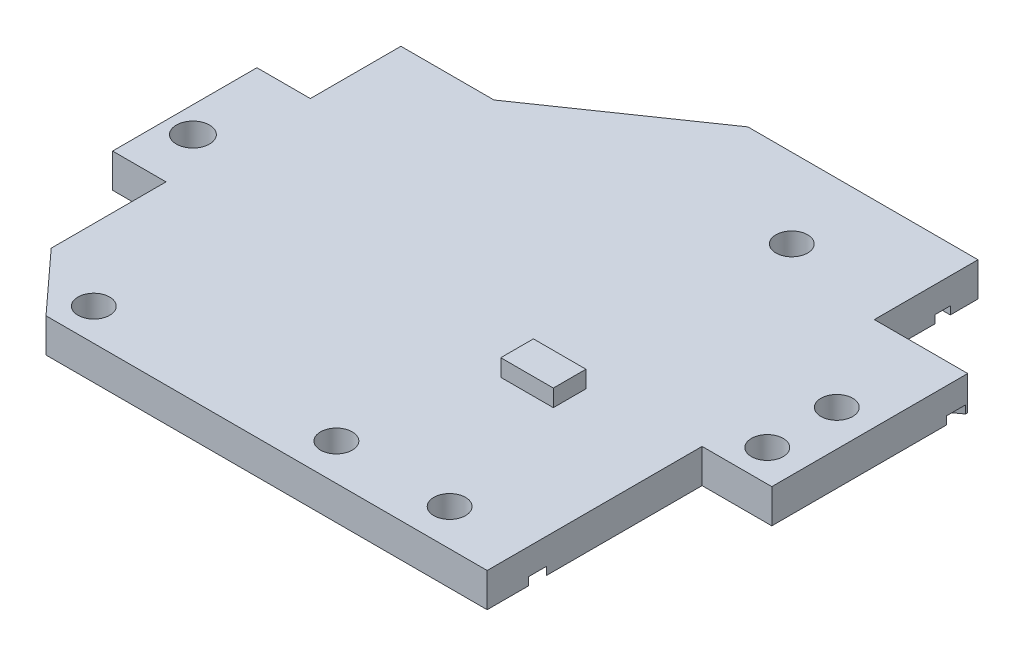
ISO-10303-21;
HEADER;
FILE_DESCRIPTION(('STEP AP214'),'2;1');
FILE_NAME('part.step','',(''),(''),'','','');
FILE_SCHEMA(('AUTOMOTIVE_DESIGN { 1 0 10303 214 1 1 1 1 }'));
ENDSEC;
DATA;
#1=APPLICATION_CONTEXT('core data for automotive mechanical design processes');
#2=APPLICATION_PROTOCOL_DEFINITION('international standard','automotive_design',2000,#1);
#3=PRODUCT_CONTEXT('',#1,'mechanical');
#4=PRODUCT('Part','Part','',(#3));
#5=PRODUCT_RELATED_PRODUCT_CATEGORY('part','',(#4));
#6=PRODUCT_DEFINITION_FORMATION('','',#4);
#7=PRODUCT_DEFINITION_CONTEXT('part definition',#1,'design');
#8=PRODUCT_DEFINITION('design','',#6,#7);
#9=PRODUCT_DEFINITION_SHAPE('','',#8);
#10=(LENGTH_UNIT() NAMED_UNIT(*) SI_UNIT(.MILLI.,.METRE.));
#11=(NAMED_UNIT(*) PLANE_ANGLE_UNIT() SI_UNIT($,.RADIAN.));
#12=(NAMED_UNIT(*) SI_UNIT($,.STERADIAN.) SOLID_ANGLE_UNIT());
#13=UNCERTAINTY_MEASURE_WITH_UNIT(LENGTH_MEASURE(1.E-05),#10,'distance_accuracy_value','');
#14=(GEOMETRIC_REPRESENTATION_CONTEXT(3) GLOBAL_UNCERTAINTY_ASSIGNED_CONTEXT((#13)) GLOBAL_UNIT_ASSIGNED_CONTEXT((#10,
#11,#12)) REPRESENTATION_CONTEXT('',''));
#15=CARTESIAN_POINT('',(0.,0.,0.));
#16=DIRECTION('',(0.,0.,1.));
#17=DIRECTION('',(1.,0.,0.));
#18=AXIS2_PLACEMENT_3D('',#15,#16,#17);
#19=CARTESIAN_POINT('',(0.,-30.,0.));
#20=DIRECTION('',(0.,-1.,0.));
#21=DIRECTION('',(0.,0.,-1.));
#22=AXIS2_PLACEMENT_3D('',#19,#20,#21);
#23=PLANE('',#22);
#24=DIRECTION('',(0.,0.,-1.));
#25=VECTOR('',#24,1.);
#26=CARTESIAN_POINT('',(41.9464641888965,-30.,-12.7545315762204));
#27=LINE('',#26,#25);
#28=CARTESIAN_POINT('',(41.9464641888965,-30.,-12.7545315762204));
#29=VERTEX_POINT('',#28);
#30=CARTESIAN_POINT('',(41.9464641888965,-30.,-14.4762299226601));
#31=VERTEX_POINT('',#30);
#32=EDGE_CURVE('E1405',#29,#31,#27,.T.);
#33=ORIENTED_EDGE('',*,*,#32,.F.);
#34=DIRECTION('',(0.842517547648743,0.,-0.538668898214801));
#35=VECTOR('',#34,1.);
#36=CARTESIAN_POINT('',(41.9464641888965,-30.,-12.7545315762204));
#37=LINE('',#36,#35);
#38=CARTESIAN_POINT('',(30.2260461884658,-30.,-5.26100854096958));
#39=VERTEX_POINT('',#38);
#40=EDGE_CURVE('E1424',#39,#29,#37,.T.);
#41=ORIENTED_EDGE('',*,*,#40,.F.);
#42=DIRECTION('',(0.630369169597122,0.,0.77629550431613));
#43=VECTOR('',#42,1.);
#44=CARTESIAN_POINT('',(20.7897535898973,-30.,-16.8817410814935));
#45=LINE('',#44,#43);
#46=CARTESIAN_POINT('',(29.6149901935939,-30.,-6.0135199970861));
#47=VERTEX_POINT('',#46);
#48=EDGE_CURVE('E754',#47,#39,#45,.T.);
#49=ORIENTED_EDGE('',*,*,#48,.F.);
#50=DIRECTION('',(-0.82315973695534,0.,0.56780986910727));
#51=VECTOR('',#50,1.);
#52=CARTESIAN_POINT('',(6.7374026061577,-30.,9.76728101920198));
#53=LINE('',#52,#51);
#54=CARTESIAN_POINT('',(41.8834667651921,-30.,-14.4762299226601));
#55=VERTEX_POINT('',#54);
#56=EDGE_CURVE('E1242',#55,#47,#53,.T.);
#57=ORIENTED_EDGE('',*,*,#56,.F.);
#58=DIRECTION('',(-1.,0.,0.));
#59=VECTOR('',#58,1.);
#60=CARTESIAN_POINT('',(0.,-30.,-14.4762299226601));
#61=LINE('',#60,#59);
#62=EDGE_CURVE('E1245',#31,#55,#61,.T.);
#63=ORIENTED_EDGE('',*,*,#62,.F.);
#64=EDGE_LOOP('',(#33,#41,#49,#57,#63));
#65=FACE_BOUND('',#64,.T.);
#66=ADVANCED_FACE('F34',(#65),#23,.T.);
#67=DIRECTION('',(-1.,0.,0.));
#68=VECTOR('',#67,1.);
#69=CARTESIAN_POINT('',(0.,-30.,-12.031071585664));
#70=LINE('',#69,#68);
#71=CARTESIAN_POINT('',(62.1812598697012,-30.,-12.031071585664));
#72=VERTEX_POINT('',#71);
#73=CARTESIAN_POINT('',(42.8138082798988,-30.,-12.031071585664));
#74=VERTEX_POINT('',#73);
#75=EDGE_CURVE('E749',#72,#74,#70,.T.);
#76=ORIENTED_EDGE('',*,*,#75,.T.);
#77=DIRECTION('',(0.,0.,-1.));
#78=VECTOR('',#77,1.);
#79=CARTESIAN_POINT('',(42.8138082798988,-30.,-12.031071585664));
#80=LINE('',#79,#78);
#81=CARTESIAN_POINT('',(42.8138082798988,-30.,-14.4762299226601));
#82=VERTEX_POINT('',#81);
#83=EDGE_CURVE('E1379',#74,#82,#80,.T.);
#84=ORIENTED_EDGE('',*,*,#83,.T.);
#85=CARTESIAN_POINT('',(62.1812598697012,-30.,-14.4762299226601));
#86=VERTEX_POINT('',#85);
#87=EDGE_CURVE('E1246',#86,#82,#61,.T.);
#88=ORIENTED_EDGE('',*,*,#87,.F.);
#89=DIRECTION('',(0.,0.,-1.));
#90=VECTOR('',#89,1.);
#91=CARTESIAN_POINT('',(62.1812598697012,-30.,0.));
#92=LINE('',#91,#90);
#93=EDGE_CURVE('E1249',#72,#86,#92,.T.);
#94=ORIENTED_EDGE('',*,*,#93,.F.);
#95=EDGE_LOOP('',(#76,#84,#88,#94));
#96=FACE_BOUND('',#95,.T.);
#97=ADVANCED_FACE('F1322',(#96),#23,.T.);
#98=CARTESIAN_POINT('',(58.3853257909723,-30.,20.3017551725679));
#99=DIRECTION('',(0.,-1.,0.));
#100=DIRECTION('',(0.,0.,-1.));
#101=AXIS2_PLACEMENT_3D('',#98,#99,#100);
#102=CIRCLE('',#101,2.41412847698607);
#103=CARTESIAN_POINT('',(58.3853257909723,-30.,17.8876266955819));
#104=VERTEX_POINT('',#103);
#105=EDGE_CURVE('E1372',#104,#104,#102,.T.);
#106=ORIENTED_EDGE('',*,*,#105,.F.);
#107=EDGE_LOOP('',(#106));
#108=FACE_BOUND('',#107,.T.);
#109=CARTESIAN_POINT('',(25.3418069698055,-30.,14.9697118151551));
#110=DIRECTION('',(0.,-1.,0.));
#111=DIRECTION('',(0.,0.,-1.));
#112=AXIS2_PLACEMENT_3D('',#109,#110,#111);
#113=CIRCLE('',#112,2.82780583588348);
#114=CARTESIAN_POINT('',(25.3418069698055,-30.,12.1419059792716));
#115=VERTEX_POINT('',#114);
#116=EDGE_CURVE('E1369',#115,#115,#113,.T.);
#117=ORIENTED_EDGE('',*,*,#116,.F.);
#118=EDGE_LOOP('',(#117));
#119=FACE_BOUND('',#118,.T.);
#120=DIRECTION('',(-1.,0.,0.));
#121=VECTOR('',#120,1.);
#122=CARTESIAN_POINT('',(33.5854503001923,-30.,17.2979819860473));
#123=LINE('',#122,#121);
#124=CARTESIAN_POINT('',(36.4191330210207,-30.,17.2979819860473));
#125=VERTEX_POINT('',#124);
#126=CARTESIAN_POINT('',(33.9996638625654,-30.,17.2979819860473));
#127=VERTEX_POINT('',#126);
#128=EDGE_CURVE('E991',#125,#127,#123,.T.);
#129=ORIENTED_EDGE('',*,*,#128,.F.);
#130=CARTESIAN_POINT('',(36.4191330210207,-30.,18.2979819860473));
#131=DIRECTION('',(0.,-1.,0.));
#132=DIRECTION('',(0.,0.,-1.));
#133=AXIS2_PLACEMENT_3D('',#130,#131,#132);
#134=CIRCLE('',#133,1.);
#135=CARTESIAN_POINT('',(37.4191330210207,-30.,18.2979819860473));
#136=VERTEX_POINT('',#135);
#137=EDGE_CURVE('E792',#125,#136,#134,.T.);
#138=ORIENTED_EDGE('',*,*,#137,.T.);
#139=DIRECTION('',(0.,0.,-1.));
#140=VECTOR('',#139,1.);
#141=CARTESIAN_POINT('',(37.4191330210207,-30.,17.2979819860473));
#142=LINE('',#141,#140);
#143=CARTESIAN_POINT('',(37.4191330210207,-30.,19.0246996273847));
#144=VERTEX_POINT('',#143);
#145=EDGE_CURVE('E988',#144,#136,#142,.T.);
#146=ORIENTED_EDGE('',*,*,#145,.F.);
#147=CARTESIAN_POINT('',(38.4191330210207,-30.,19.0246996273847));
#148=DIRECTION('',(0.,-1.,0.));
#149=DIRECTION('',(0.,0.,-1.));
#150=AXIS2_PLACEMENT_3D('',#147,#148,#149);
#151=CIRCLE('',#150,1.);
#152=CARTESIAN_POINT('',(38.4191330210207,-30.,20.0246996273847));
#153=VERTEX_POINT('',#152);
#154=EDGE_CURVE('E911',#144,#153,#151,.F.);
#155=ORIENTED_EDGE('',*,*,#154,.T.);
#156=DIRECTION('',(-1.,0.,0.));
#157=VECTOR('',#156,1.);
#158=CARTESIAN_POINT('',(37.4191330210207,-30.,20.0246996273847));
#159=LINE('',#158,#157);
#160=CARTESIAN_POINT('',(52.4232370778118,-30.,20.0246996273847));
#161=VERTEX_POINT('',#160);
#162=EDGE_CURVE('E954',#161,#153,#159,.T.);
#163=ORIENTED_EDGE('',*,*,#162,.F.);
#164=CARTESIAN_POINT('',(52.4232370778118,-30.,19.0246996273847));
#165=DIRECTION('',(0.,-1.,0.));
#166=DIRECTION('',(0.,0.,-1.));
#167=AXIS2_PLACEMENT_3D('',#164,#165,#166);
#168=CIRCLE('',#167,1.);
#169=CARTESIAN_POINT('',(53.4232370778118,-30.,19.0246996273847));
#170=VERTEX_POINT('',#169);
#171=EDGE_CURVE('E42',#161,#170,#168,.F.);
#172=ORIENTED_EDGE('',*,*,#171,.T.);
#173=DIRECTION('',(0.,0.,1.));
#174=VECTOR('',#173,1.);
#175=CARTESIAN_POINT('',(53.4232370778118,-30.,20.0246996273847));
#176=LINE('',#175,#174);
#177=CARTESIAN_POINT('',(53.4232370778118,-30.,17.2979819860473));
#178=VERTEX_POINT('',#177);
#179=EDGE_CURVE('E952',#178,#170,#176,.T.);
#180=ORIENTED_EDGE('',*,*,#179,.F.);
#181=DIRECTION('',(-1.,0.,0.));
#182=VECTOR('',#181,1.);
#183=CARTESIAN_POINT('',(53.4232370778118,-30.,17.2979819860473));
#184=LINE('',#183,#182);
#185=CARTESIAN_POINT('',(55.3038354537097,-30.,17.2979819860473));
#186=VERTEX_POINT('',#185);
#187=EDGE_CURVE('E965',#186,#178,#184,.T.);
#188=ORIENTED_EDGE('',*,*,#187,.F.);
#189=CARTESIAN_POINT('',(55.3038354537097,-30.,16.2979819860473));
#190=DIRECTION('',(0.,-1.,0.));
#191=DIRECTION('',(0.,0.,-1.));
#192=AXIS2_PLACEMENT_3D('',#189,#190,#191);
#193=CIRCLE('',#192,1.);
#194=CARTESIAN_POINT('',(55.9559684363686,-30.,17.0560865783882));
#195=VERTEX_POINT('',#194);
#196=EDGE_CURVE('E943',#186,#195,#193,.F.);
#197=ORIENTED_EDGE('',*,*,#196,.T.);
#198=DIRECTION('',(-0.758104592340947,0.,0.65213298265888));
#199=VECTOR('',#198,1.);
#200=CARTESIAN_POINT('',(55.6747650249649,-30.,17.2979819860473));
#201=LINE('',#200,#199);
#202=CARTESIAN_POINT('',(60.9861439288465,-30.,12.7290538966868));
#203=VERTEX_POINT('',#202);
#204=EDGE_CURVE('E1017',#203,#195,#201,.T.);
#205=ORIENTED_EDGE('',*,*,#204,.F.);
#206=CARTESIAN_POINT('',(60.3340109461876,-30.,11.9709493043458));
#207=DIRECTION('',(0.,-1.,0.));
#208=DIRECTION('',(0.,0.,-1.));
#209=AXIS2_PLACEMENT_3D('',#206,#207,#208);
#210=CIRCLE('',#209,1.);
#211=CARTESIAN_POINT('',(61.3340109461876,-30.,11.9709493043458));
#212=VERTEX_POINT('',#211);
#213=EDGE_CURVE('E941',#203,#212,#210,.F.);
#214=ORIENTED_EDGE('',*,*,#213,.T.);
#215=DIRECTION('',(0.,0.,1.));
#216=VECTOR('',#215,1.);
#217=CARTESIAN_POINT('',(61.3340109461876,-30.,12.4298134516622));
#218=LINE('',#217,#216);
#219=CARTESIAN_POINT('',(61.3340109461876,-30.,3.57698741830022));
#220=VERTEX_POINT('',#219);
#221=EDGE_CURVE('E1014',#220,#212,#218,.T.);
#222=ORIENTED_EDGE('',*,*,#221,.F.);
#223=CARTESIAN_POINT('',(62.3340109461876,-30.,3.57698741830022));
#224=DIRECTION('',(0.,-1.,0.));
#225=DIRECTION('',(0.,0.,-1.));
#226=AXIS2_PLACEMENT_3D('',#223,#224,#225);
#227=CIRCLE('',#226,1.);
#228=CARTESIAN_POINT('',(61.7498350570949,-30.,2.76536032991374));
#229=VERTEX_POINT('',#228);
#230=EDGE_CURVE('E784',#220,#229,#227,.T.);
#231=ORIENTED_EDGE('',*,*,#230,.T.);
#232=DIRECTION('',(-0.81162708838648,0.,0.584175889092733));
#233=VECTOR('',#232,1.);
#234=CARTESIAN_POINT('',(72.000844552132,-30.,-4.61289585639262));
#235=LINE('',#234,#233);
#236=CARTESIAN_POINT('',(70.4207046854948,-30.,-3.47557599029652));
#237=VERTEX_POINT('',#236);
#238=EDGE_CURVE('E1011',#237,#229,#235,.T.);
#239=ORIENTED_EDGE('',*,*,#238,.F.);
#240=DIRECTION('',(0.,0.,1.));
#241=VECTOR('',#240,1.);
#242=CARTESIAN_POINT('',(70.4207046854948,-30.,0.));
#243=LINE('',#242,#241);
#244=CARTESIAN_POINT('',(70.4207046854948,-30.,11.9546254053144));
#245=VERTEX_POINT('',#244);
#246=EDGE_CURVE('E1212',#237,#245,#243,.T.);
#247=ORIENTED_EDGE('',*,*,#246,.T.);
#248=DIRECTION('',(1.,0.,0.));
#249=VECTOR('',#248,1.);
#250=CARTESIAN_POINT('',(0.,-30.,11.9546254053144));
#251=LINE('',#250,#249);
#252=CARTESIAN_POINT('',(64.2720579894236,-30.,11.9546254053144));
#253=VERTEX_POINT('',#252);
#254=EDGE_CURVE('E1216',#253,#245,#251,.T.);
#255=ORIENTED_EDGE('',*,*,#254,.F.);
#256=DIRECTION('',(0.,0.,-1.));
#257=VECTOR('',#256,1.);
#258=CARTESIAN_POINT('',(64.2720579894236,-30.,0.));
#259=LINE('',#258,#257);
#260=CARTESIAN_POINT('',(64.2720579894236,-30.,25.6658055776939));
#261=VERTEX_POINT('',#260);
#262=EDGE_CURVE('E1219',#261,#253,#259,.T.);
#263=ORIENTED_EDGE('',*,*,#262,.F.);
#264=DIRECTION('',(0.707106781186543,0.,0.707106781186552));
#265=VECTOR('',#264,1.);
#266=CARTESIAN_POINT('',(67.1237146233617,-30.,28.517462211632));
#267=LINE('',#266,#265);
#268=CARTESIAN_POINT('',(62.2491587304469,-30.,23.6429063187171));
#269=VERTEX_POINT('',#268);
#270=EDGE_CURVE('E1104',#269,#261,#267,.T.);
#271=ORIENTED_EDGE('',*,*,#270,.F.);
#272=DIRECTION('',(1.,0.,0.));
#273=VECTOR('',#272,1.);
#274=CARTESIAN_POINT('',(62.2491587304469,-30.,23.6429063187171));
#275=LINE('',#274,#273);
#276=CARTESIAN_POINT('',(44.0466518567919,-30.,23.6429063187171));
#277=VERTEX_POINT('',#276);
#278=EDGE_CURVE('E1102',#277,#269,#275,.T.);
#279=ORIENTED_EDGE('',*,*,#278,.F.);
#280=CARTESIAN_POINT('',(44.0466518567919,-30.,24.6429063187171));
#281=DIRECTION('',(0.,-1.,0.));
#282=DIRECTION('',(0.,0.,-1.));
#283=AXIS2_PLACEMENT_3D('',#280,#281,#282);
#284=CIRCLE('',#283,1.);
#285=CARTESIAN_POINT('',(43.0466518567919,-30.,24.6429063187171));
#286=VERTEX_POINT('',#285);
#287=EDGE_CURVE('E925',#277,#286,#284,.F.);
#288=ORIENTED_EDGE('',*,*,#287,.T.);
#289=DIRECTION('',(0.,0.,-1.));
#290=VECTOR('',#289,1.);
#291=CARTESIAN_POINT('',(43.0466518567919,-30.,23.6429063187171));
#292=LINE('',#291,#290);
#293=CARTESIAN_POINT('',(43.0466518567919,-30.,27.9562676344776));
#294=VERTEX_POINT('',#293);
#295=EDGE_CURVE('E1099',#294,#286,#292,.T.);
#296=ORIENTED_EDGE('',*,*,#295,.F.);
#297=CARTESIAN_POINT('',(42.0466518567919,-30.,27.9562676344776));
#298=DIRECTION('',(0.,-1.,0.));
#299=DIRECTION('',(0.,0.,-1.));
#300=AXIS2_PLACEMENT_3D('',#297,#298,#299);
#301=CIRCLE('',#300,1.);
#302=CARTESIAN_POINT('',(42.0466518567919,-30.,28.9562676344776));
#303=VERTEX_POINT('',#302);
#304=EDGE_CURVE('E788',#294,#303,#301,.T.);
#305=ORIENTED_EDGE('',*,*,#304,.T.);
#306=DIRECTION('',(1.,0.,0.));
#307=VECTOR('',#306,1.);
#308=CARTESIAN_POINT('',(43.0466518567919,-30.,28.9562676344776));
#309=LINE('',#308,#307);
#310=CARTESIAN_POINT('',(33.5916356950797,-30.,28.9562676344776));
#311=VERTEX_POINT('',#310);
#312=EDGE_CURVE('E1096',#311,#303,#309,.T.);
#313=ORIENTED_EDGE('',*,*,#312,.F.);
#314=CARTESIAN_POINT('',(33.5916356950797,-30.,27.9562676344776));
#315=DIRECTION('',(0.,-1.,0.));
#316=DIRECTION('',(0.,0.,-1.));
#317=AXIS2_PLACEMENT_3D('',#314,#315,#316);
#318=CIRCLE('',#317,1.);
#319=CARTESIAN_POINT('',(32.5916356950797,-30.,27.956267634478));
#320=VERTEX_POINT('',#319);
#321=EDGE_CURVE('E790',#311,#320,#318,.T.);
#322=ORIENTED_EDGE('',*,*,#321,.T.);
#323=DIRECTION('',(3.82623272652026E-13,0.,1.));
#324=VECTOR('',#323,1.);
#325=CARTESIAN_POINT('',(32.5916356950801,-30.,28.9562676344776));
#326=LINE('',#325,#324);
#327=CARTESIAN_POINT('',(32.5916356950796,-30.,27.7201912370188));
#328=VERTEX_POINT('',#327);
#329=EDGE_CURVE('E1093',#328,#320,#326,.T.);
#330=ORIENTED_EDGE('',*,*,#329,.F.);
#331=CARTESIAN_POINT('',(31.5916356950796,-30.,27.7201912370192));
#332=DIRECTION('',(0.,-1.,0.));
#333=DIRECTION('',(0.,0.,-1.));
#334=AXIS2_PLACEMENT_3D('',#331,#332,#333);
#335=CIRCLE('',#334,1.);
#336=CARTESIAN_POINT('',(32.2987424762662,-30.,27.0130844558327));
#337=VERTEX_POINT('',#336);
#338=EDGE_CURVE('E915',#328,#337,#335,.F.);
#339=ORIENTED_EDGE('',*,*,#338,.T.);
#340=DIRECTION('',(0.707106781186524,0.,0.707106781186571));
#341=VECTOR('',#340,1.);
#342=CARTESIAN_POINT('',(32.5916356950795,-30.,27.305977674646));
#343=LINE('',#342,#341);
#344=CARTESIAN_POINT('',(23.0666962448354,-30.,17.7810382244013));
#345=VERTEX_POINT('',#344);
#346=EDGE_CURVE('E1090',#345,#337,#343,.T.);
#347=ORIENTED_EDGE('',*,*,#346,.F.);
#348=DIRECTION('',(1.,0.,3.06881312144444E-13));
#349=VECTOR('',#348,1.);
#350=CARTESIAN_POINT('',(23.0666962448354,-30.,17.7810382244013));
#351=LINE('',#350,#349);
#352=CARTESIAN_POINT('',(21.1108445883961,-30.,17.7810382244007));
#353=VERTEX_POINT('',#352);
#354=EDGE_CURVE('E1087',#353,#345,#351,.T.);
#355=ORIENTED_EDGE('',*,*,#354,.F.);
#356=DIRECTION('',(0.,0.,-1.));
#357=VECTOR('',#356,1.);
#358=CARTESIAN_POINT('',(21.1108445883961,-30.,17.7810382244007));
#359=LINE('',#358,#357);
#360=CARTESIAN_POINT('',(21.1108445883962,-30.,26.2784406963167));
#361=VERTEX_POINT('',#360);
#362=EDGE_CURVE('E1085',#361,#353,#359,.T.);
#363=ORIENTED_EDGE('',*,*,#362,.F.);
#364=DIRECTION('',(0.674983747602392,0.,0.737832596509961));
#365=VECTOR('',#364,1.);
#366=CARTESIAN_POINT('',(-1.59464151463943,-30.,1.45880937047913));
#367=LINE('',#366,#365);
#368=CARTESIAN_POINT('',(20.4173661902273,-30.,25.5203913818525));
#369=VERTEX_POINT('',#368);
#370=EDGE_CURVE('E1223',#369,#361,#367,.T.);
#371=ORIENTED_EDGE('',*,*,#370,.F.);
#372=DIRECTION('',(0.,0.,-1.));
#373=VECTOR('',#372,1.);
#374=CARTESIAN_POINT('',(20.4173661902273,-30.,0.));
#375=LINE('',#374,#373);
#376=CARTESIAN_POINT('',(20.4173661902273,-30.,15.3918024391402));
#377=VERTEX_POINT('',#376);
#378=EDGE_CURVE('E1226',#369,#377,#375,.T.);
#379=ORIENTED_EDGE('',*,*,#378,.T.);
#380=DIRECTION('',(-1.,0.,0.));
#381=VECTOR('',#380,1.);
#382=CARTESIAN_POINT('',(0.,-30.,15.3918024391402));
#383=LINE('',#382,#381);
#384=CARTESIAN_POINT('',(15.7039696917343,-30.,15.3918024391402));
#385=VERTEX_POINT('',#384);
#386=EDGE_CURVE('E1228',#377,#385,#383,.T.);
#387=ORIENTED_EDGE('',*,*,#386,.T.);
#388=DIRECTION('',(0.,0.,1.));
#389=VECTOR('',#388,1.);
#390=CARTESIAN_POINT('',(15.7039696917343,-30.,0.));
#391=LINE('',#390,#389);
#392=CARTESIAN_POINT('',(15.7039696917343,-30.,2.65912329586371));
#393=VERTEX_POINT('',#392);
#394=EDGE_CURVE('E1230',#393,#385,#391,.T.);
#395=ORIENTED_EDGE('',*,*,#394,.F.);
#396=DIRECTION('',(-1.,0.,0.));
#397=VECTOR('',#396,1.);
#398=CARTESIAN_POINT('',(0.,-30.,2.65912329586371));
#399=LINE('',#398,#397);
#400=CARTESIAN_POINT('',(20.4173661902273,-30.,2.65912329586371));
#401=VERTEX_POINT('',#400);
#402=EDGE_CURVE('E1233',#401,#393,#399,.T.);
#403=ORIENTED_EDGE('',*,*,#402,.F.);
#404=DIRECTION('',(0.,0.,-1.));
#405=VECTOR('',#404,1.);
#406=CARTESIAN_POINT('',(20.4173661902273,-30.,0.));
#407=LINE('',#406,#405);
#408=CARTESIAN_POINT('',(20.4173661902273,-30.,-5.3308873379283));
#409=VERTEX_POINT('',#408);
#410=EDGE_CURVE('E1236',#401,#409,#407,.T.);
#411=ORIENTED_EDGE('',*,*,#410,.T.);
#412=DIRECTION('',(-1.,0.,0.));
#413=VECTOR('',#412,1.);
#414=CARTESIAN_POINT('',(0.,-30.,-5.3308873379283));
#415=LINE('',#414,#413);
#416=CARTESIAN_POINT('',(28.6253706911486,-30.,-5.3308873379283));
#417=VERTEX_POINT('',#416);
#418=EDGE_CURVE('E1238',#417,#409,#415,.T.);
#419=ORIENTED_EDGE('',*,*,#418,.F.);
#420=CARTESIAN_POINT('',(29.1480700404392,-30.,-5.69144171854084));
#421=VERTEX_POINT('',#420);
#422=EDGE_CURVE('E1241',#421,#417,#53,.T.);
#423=ORIENTED_EDGE('',*,*,#422,.F.);
#424=DIRECTION('',(-0.630369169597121,0.,-0.776295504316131));
#425=VECTOR('',#424,1.);
#426=CARTESIAN_POINT('',(27.7306206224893,-30.,-7.43702139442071));
#427=LINE('',#426,#425);
#428=CARTESIAN_POINT('',(31.0088591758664,-30.,-3.39989208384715));
#429=VERTEX_POINT('',#428);
#430=EDGE_CURVE('E1422',#429,#421,#427,.T.);
#431=ORIENTED_EDGE('',*,*,#430,.F.);
#432=DIRECTION('',(-0.842517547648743,0.,0.538668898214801));
#433=VECTOR('',#432,1.);
#434=CARTESIAN_POINT('',(31.0088591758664,-30.,-3.39989208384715));
#435=LINE('',#434,#433);
#436=CARTESIAN_POINT('',(42.3985303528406,-30.,-10.6819500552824));
#437=VERTEX_POINT('',#436);
#438=EDGE_CURVE('E1401',#437,#429,#435,.T.);
#439=ORIENTED_EDGE('',*,*,#438,.F.);
#440=DIRECTION('',(-1.,0.,0.));
#441=VECTOR('',#440,1.);
#442=CARTESIAN_POINT('',(0.,-30.,-10.6819500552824));
#443=LINE('',#442,#441);
#444=CARTESIAN_POINT('',(62.1812598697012,-30.,-10.6819500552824));
#445=VERTEX_POINT('',#444);
#446=EDGE_CURVE('E752',#445,#437,#443,.T.);
#447=ORIENTED_EDGE('',*,*,#446,.F.);
#448=CARTESIAN_POINT('',(62.1812598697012,-30.,-5.3308873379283));
#449=VERTEX_POINT('',#448);
#450=EDGE_CURVE('E1250',#449,#445,#92,.T.);
#451=ORIENTED_EDGE('',*,*,#450,.F.);
#452=DIRECTION('',(1.,0.,0.));
#453=VECTOR('',#452,1.);
#454=CARTESIAN_POINT('',(0.,-30.,-5.3308873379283));
#455=LINE('',#454,#453);
#456=CARTESIAN_POINT('',(70.4207046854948,-30.,-5.3308873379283));
#457=VERTEX_POINT('',#456);
#458=EDGE_CURVE('E1209',#449,#457,#455,.T.);
#459=ORIENTED_EDGE('',*,*,#458,.T.);
#460=CARTESIAN_POINT('',(70.4207046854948,-30.,-5.14015851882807));
#461=VERTEX_POINT('',#460);
#462=EDGE_CURVE('E1213',#457,#461,#243,.T.);
#463=ORIENTED_EDGE('',*,*,#462,.T.);
#464=DIRECTION('',(0.806928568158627,0.,-0.59064903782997));
#465=VECTOR('',#464,1.);
#466=CARTESIAN_POINT('',(60.5693257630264,-30.,2.07077403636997));
#467=LINE('',#466,#465);
#468=CARTESIAN_POINT('',(61.2879230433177,-30.,1.54478101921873));
#469=VERTEX_POINT('',#468);
#470=EDGE_CURVE('E1009',#469,#461,#467,.T.);
#471=ORIENTED_EDGE('',*,*,#470,.F.);
#472=CARTESIAN_POINT('',(60.6972740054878,-30.,0.737852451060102));
#473=DIRECTION('',(0.,-1.,0.));
#474=DIRECTION('',(0.,0.,-1.));
#475=AXIS2_PLACEMENT_3D('',#472,#473,#474);
#476=CIRCLE('',#475,1.);
#477=CARTESIAN_POINT('',(59.9639092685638,-30.,1.41768784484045));
#478=VERTEX_POINT('',#477);
#479=EDGE_CURVE('E786',#469,#478,#476,.T.);
#480=ORIENTED_EDGE('',*,*,#479,.T.);
#481=DIRECTION('',(0.679835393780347,0.,0.733364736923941));
#482=VECTOR('',#481,1.);
#483=CARTESIAN_POINT('',(55.6747650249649,-30.,-3.20917796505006));
#484=LINE('',#483,#482);
#485=CARTESIAN_POINT('',(55.6747650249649,-30.,-3.20917796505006));
#486=VERTEX_POINT('',#485);
#487=EDGE_CURVE('E1006',#486,#478,#484,.T.);
#488=ORIENTED_EDGE('',*,*,#487,.F.);
#489=DIRECTION('',(1.,0.,0.));
#490=VECTOR('',#489,1.);
#491=CARTESIAN_POINT('',(32.5916356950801,-30.,-3.20917796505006));
#492=LINE('',#491,#490);
#493=CARTESIAN_POINT('',(32.5916356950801,-30.,-3.20917796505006));
#494=VERTEX_POINT('',#493);
#495=EDGE_CURVE('E1003',#494,#486,#492,.T.);
#496=ORIENTED_EDGE('',*,*,#495,.F.);
#497=DIRECTION('',(0.569083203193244,0.,-0.822279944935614));
#498=VECTOR('',#497,1.);
#499=CARTESIAN_POINT('',(28.1696128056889,-30.,3.18029323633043));
#500=LINE('',#499,#498);
#501=CARTESIAN_POINT('',(28.1696128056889,-30.,3.18029323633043));
#502=VERTEX_POINT('',#501);
#503=EDGE_CURVE('E1000',#502,#494,#500,.T.);
#504=ORIENTED_EDGE('',*,*,#503,.F.);
#505=DIRECTION('',(0.,0.,-1.));
#506=VECTOR('',#505,1.);
#507=CARTESIAN_POINT('',(28.1696128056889,-30.,11.8821444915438));
#508=LINE('',#507,#506);
#509=CARTESIAN_POINT('',(28.1696128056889,-30.,11.8821444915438));
#510=VERTEX_POINT('',#509);
#511=EDGE_CURVE('E997',#510,#502,#508,.T.);
#512=ORIENTED_EDGE('',*,*,#511,.F.);
#513=DIRECTION('',(-0.707106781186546,0.,-0.707106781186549));
#514=VECTOR('',#513,1.);
#515=CARTESIAN_POINT('',(28.1696128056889,-30.,11.8821444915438));
#516=LINE('',#515,#514);
#517=CARTESIAN_POINT('',(33.2925570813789,-30.,17.0050887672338));
#518=VERTEX_POINT('',#517);
#519=EDGE_CURVE('E995',#518,#510,#516,.T.);
#520=ORIENTED_EDGE('',*,*,#519,.F.);
#521=CARTESIAN_POINT('',(33.9996638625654,-30.,16.2979819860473));
#522=DIRECTION('',(0.,-1.,0.));
#523=DIRECTION('',(0.,0.,-1.));
#524=AXIS2_PLACEMENT_3D('',#521,#522,#523);
#525=CIRCLE('',#524,1.);
#526=EDGE_CURVE('E907',#518,#127,#525,.F.);
#527=ORIENTED_EDGE('',*,*,#526,.T.);
#528=EDGE_LOOP('',(#129,#138,#146,#155,#163,#172,#180,#188,#197,#205,#214,#222,#231,#239,#247,
#255,#263,#271,#279,#288,#296,#305,#313,#322,#330,#339,#347,#355,#363,#371,#379,#387,#395,#403,
#411,#419,#423,#431,#439,#447,#451,#459,#463,#471,#480,#488,#496,#504,#512,#520,#527));
#529=FACE_BOUND('',#528,.T.);
#530=CARTESIAN_POINT('',(62.2491587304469,-30.,-1.43173437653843));
#531=DIRECTION('',(0.,-1.,0.));
#532=DIRECTION('',(0.,0.,-1.));
#533=AXIS2_PLACEMENT_3D('',#530,#531,#532);
#534=CIRCLE('',#533,1.08215707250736);
#535=CARTESIAN_POINT('',(62.2491587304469,-30.,-2.51389144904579));
#536=VERTEX_POINT('',#535);
#537=EDGE_CURVE('E1609',#536,#536,#534,.T.);
#538=ORIENTED_EDGE('',*,*,#537,.F.);
#539=EDGE_LOOP('',(#538));
#540=FACE_BOUND('',#539,.T.);
#541=CARTESIAN_POINT('',(24.9912504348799,-30.,-0.670679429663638));
#542=DIRECTION('',(0.,-1.,0.));
#543=DIRECTION('',(0.,0.,-1.));
#544=AXIS2_PLACEMENT_3D('',#541,#542,#543);
#545=CIRCLE('',#544,1.49660573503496);
#546=CARTESIAN_POINT('',(24.9912504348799,-30.,-2.1672851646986));
#547=VERTEX_POINT('',#546);
#548=EDGE_CURVE('E1619',#547,#547,#545,.T.);
#549=ORIENTED_EDGE('',*,*,#548,.F.);
#550=EDGE_LOOP('',(#549));
#551=FACE_BOUND('',#550,.T.);
#552=CARTESIAN_POINT('',(17.9895518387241,-30.,10.5897190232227));
#553=DIRECTION('',(0.,-1.,0.));
#554=DIRECTION('',(0.,0.,-1.));
#555=AXIS2_PLACEMENT_3D('',#552,#553,#554);
#556=CIRCLE('',#555,1.46136398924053);
#557=CARTESIAN_POINT('',(17.9895518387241,-30.,9.12835503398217));
#558=VERTEX_POINT('',#557);
#559=EDGE_CURVE('E1256',#558,#558,#556,.T.);
#560=ORIENTED_EDGE('',*,*,#559,.F.);
#561=EDGE_LOOP('',(#560));
#562=FACE_BOUND('',#561,.T.);
#563=CARTESIAN_POINT('',(52.7569196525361,-30.,-7.47241922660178));
#564=DIRECTION('',(0.,-1.,0.));
#565=DIRECTION('',(0.,0.,-1.));
#566=AXIS2_PLACEMENT_3D('',#563,#564,#565);
#567=CIRCLE('',#566,1.4);
#568=CARTESIAN_POINT('',(52.7569196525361,-30.,-8.87241922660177));
#569=VERTEX_POINT('',#568);
#570=EDGE_CURVE('E1253',#569,#569,#567,.T.);
#571=ORIENTED_EDGE('',*,*,#570,.F.);
#572=EDGE_LOOP('',(#571));
#573=FACE_BOUND('',#572,.T.);
#574=CARTESIAN_POINT('',(67.2341774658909,-30.,3.0317210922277));
#575=DIRECTION('',(0.,-1.,0.));
#576=DIRECTION('',(0.,0.,-1.));
#577=AXIS2_PLACEMENT_3D('',#574,#575,#576);
#578=CIRCLE('',#577,1.4);
#579=CARTESIAN_POINT('',(67.2341774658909,-30.,1.63172109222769));
#580=VERTEX_POINT('',#579);
#581=EDGE_CURVE('E1206',#580,#580,#578,.T.);
#582=ORIENTED_EDGE('',*,*,#581,.F.);
#583=EDGE_LOOP('',(#582));
#584=FACE_BOUND('',#583,.T.);
#585=CARTESIAN_POINT('',(67.2341774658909,-30.,9.16439070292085));
#586=DIRECTION('',(0.,-1.,0.));
#587=DIRECTION('',(0.,0.,-1.));
#588=AXIS2_PLACEMENT_3D('',#585,#586,#587);
#589=CIRCLE('',#588,1.4);
#590=CARTESIAN_POINT('',(67.2341774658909,-30.,7.76439070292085));
#591=VERTEX_POINT('',#590);
#592=EDGE_CURVE('E704',#591,#591,#589,.T.);
#593=ORIENTED_EDGE('',*,*,#592,.F.);
#594=EDGE_LOOP('',(#593));
#595=FACE_BOUND('',#594,.T.);
#596=ADVANCED_FACE('F949',(#108,#119,#529,#540,#551,#562,#573,#584,#595),#23,.T.);
#597=CARTESIAN_POINT('',(0.,-27.,0.));
#598=DIRECTION('',(0.,-1.,0.));
#599=DIRECTION('',(0.,0.,-1.));
#600=AXIS2_PLACEMENT_3D('',#597,#598,#599);
#601=PLANE('',#600);
#602=CARTESIAN_POINT('',(67.2341774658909,-27.,9.16439070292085));
#603=DIRECTION('',(0.,-1.,0.));
#604=DIRECTION('',(0.,0.,-1.));
#605=AXIS2_PLACEMENT_3D('',#602,#603,#604);
#606=CIRCLE('',#605,1.4);
#607=CARTESIAN_POINT('',(67.2341774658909,-27.,7.76439070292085));
#608=VERTEX_POINT('',#607);
#609=EDGE_CURVE('E1200',#608,#608,#606,.F.);
#610=ORIENTED_EDGE('',*,*,#609,.F.);
#611=EDGE_LOOP('',(#610));
#612=FACE_BOUND('',#611,.T.);
#613=CARTESIAN_POINT('',(67.2341774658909,-27.,3.0317210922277));
#614=DIRECTION('',(0.,-1.,0.));
#615=DIRECTION('',(0.,0.,-1.));
#616=AXIS2_PLACEMENT_3D('',#613,#614,#615);
#617=CIRCLE('',#616,1.4);
#618=CARTESIAN_POINT('',(67.2341774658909,-27.,1.63172109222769));
#619=VERTEX_POINT('',#618);
#620=EDGE_CURVE('E1197',#619,#619,#617,.F.);
#621=ORIENTED_EDGE('',*,*,#620,.F.);
#622=EDGE_LOOP('',(#621));
#623=FACE_BOUND('',#622,.T.);
#624=CARTESIAN_POINT('',(57.7282185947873,-27.,27.6824073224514));
#625=DIRECTION('',(0.,-1.,0.));
#626=DIRECTION('',(0.,0.,-1.));
#627=AXIS2_PLACEMENT_3D('',#624,#625,#626);
#628=CIRCLE('',#627,1.4);
#629=CARTESIAN_POINT('',(57.7282185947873,-27.,26.2824073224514));
#630=VERTEX_POINT('',#629);
#631=EDGE_CURVE('E701',#630,#630,#628,.T.);
#632=ORIENTED_EDGE('',*,*,#631,.T.);
#633=EDGE_LOOP('',(#632));
#634=FACE_BOUND('',#633,.T.);
#635=CARTESIAN_POINT('',(47.7282717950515,-27.,27.6742022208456));
#636=DIRECTION('',(0.,-1.,0.));
#637=DIRECTION('',(0.,0.,-1.));
#638=AXIS2_PLACEMENT_3D('',#635,#636,#637);
#639=CIRCLE('',#638,1.4);
#640=CARTESIAN_POINT('',(47.7282717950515,-27.,26.2742022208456));
#641=VERTEX_POINT('',#640);
#642=EDGE_CURVE('E698',#641,#641,#639,.T.);
#643=ORIENTED_EDGE('',*,*,#642,.T.);
#644=EDGE_LOOP('',(#643));
#645=FACE_BOUND('',#644,.T.);
#646=CARTESIAN_POINT('',(26.7272780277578,-27.,28.071942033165));
#647=DIRECTION('',(0.,-1.,0.));
#648=DIRECTION('',(0.,0.,-1.));
#649=AXIS2_PLACEMENT_3D('',#646,#647,#648);
#650=CIRCLE('',#649,1.4);
#651=CARTESIAN_POINT('',(26.7272780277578,-27.,26.671942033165));
#652=VERTEX_POINT('',#651);
#653=EDGE_CURVE('E695',#652,#652,#650,.T.);
#654=ORIENTED_EDGE('',*,*,#653,.T.);
#655=EDGE_LOOP('',(#654));
#656=FACE_BOUND('',#655,.T.);
#657=CARTESIAN_POINT('',(17.9895518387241,-27.,10.5897190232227));
#658=DIRECTION('',(0.,-1.,0.));
#659=DIRECTION('',(0.,0.,-1.));
#660=AXIS2_PLACEMENT_3D('',#657,#658,#659);
#661=CIRCLE('',#660,1.46136398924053);
#662=CARTESIAN_POINT('',(17.9895518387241,-27.,9.12835503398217));
#663=VERTEX_POINT('',#662);
#664=EDGE_CURVE('E692',#663,#663,#661,.T.);
#665=ORIENTED_EDGE('',*,*,#664,.T.);
#666=EDGE_LOOP('',(#665));
#667=FACE_BOUND('',#666,.T.);
#668=DIRECTION('',(0.674983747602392,0.,0.737832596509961));
#669=VECTOR('',#668,1.);
#670=CARTESIAN_POINT('',(-1.59464151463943,-27.,1.45880937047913));
#671=LINE('',#670,#669);
#672=CARTESIAN_POINT('',(20.4173661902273,-27.,25.5203913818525));
#673=VERTEX_POINT('',#672);
#674=CARTESIAN_POINT('',(25.353505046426,-27.,30.9161422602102));
#675=VERTEX_POINT('',#674);
#676=EDGE_CURVE('E645',#673,#675,#671,.T.);
#677=ORIENTED_EDGE('',*,*,#676,.T.);
#678=DIRECTION('',(-1.,0.,0.));
#679=VECTOR('',#678,1.);
#680=CARTESIAN_POINT('',(65.679432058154,-27.,30.9161422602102));
#681=LINE('',#680,#679);
#682=CARTESIAN_POINT('',(64.2720579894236,-27.,30.9161422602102));
#683=VERTEX_POINT('',#682);
#684=EDGE_CURVE('E631',#683,#675,#681,.T.);
#685=ORIENTED_EDGE('',*,*,#684,.F.);
#686=DIRECTION('',(0.,0.,-1.));
#687=VECTOR('',#686,1.);
#688=CARTESIAN_POINT('',(64.2720579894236,-27.,0.));
#689=LINE('',#688,#687);
#690=CARTESIAN_POINT('',(64.2720579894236,-27.,11.9546254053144));
#691=VERTEX_POINT('',#690);
#692=EDGE_CURVE('E641',#683,#691,#689,.T.);
#693=ORIENTED_EDGE('',*,*,#692,.T.);
#694=DIRECTION('',(1.,0.,0.));
#695=VECTOR('',#694,1.);
#696=CARTESIAN_POINT('',(0.,-27.,11.9546254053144));
#697=LINE('',#696,#695);
#698=CARTESIAN_POINT('',(70.4207046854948,-27.,11.9546254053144));
#699=VERTEX_POINT('',#698);
#700=EDGE_CURVE('E662',#691,#699,#697,.T.);
#701=ORIENTED_EDGE('',*,*,#700,.T.);
#702=DIRECTION('',(0.,0.,1.));
#703=VECTOR('',#702,1.);
#704=CARTESIAN_POINT('',(70.4207046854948,-27.,0.));
#705=LINE('',#704,#703);
#706=CARTESIAN_POINT('',(70.4207046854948,-27.,-5.3308873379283));
#707=VERTEX_POINT('',#706);
#708=EDGE_CURVE('E1203',#707,#699,#705,.T.);
#709=ORIENTED_EDGE('',*,*,#708,.F.);
#710=DIRECTION('',(1.,0.,0.));
#711=VECTOR('',#710,1.);
#712=CARTESIAN_POINT('',(0.,-27.,-5.3308873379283));
#713=LINE('',#712,#711);
#714=CARTESIAN_POINT('',(62.1812598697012,-27.,-5.3308873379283));
#715=VERTEX_POINT('',#714);
#716=EDGE_CURVE('E652',#715,#707,#713,.T.);
#717=ORIENTED_EDGE('',*,*,#716,.F.);
#718=DIRECTION('',(0.,0.,-1.));
#719=VECTOR('',#718,1.);
#720=CARTESIAN_POINT('',(62.1812598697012,-27.,0.));
#721=LINE('',#720,#719);
#722=CARTESIAN_POINT('',(62.1812598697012,-27.,-14.4762299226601));
#723=VERTEX_POINT('',#722);
#724=EDGE_CURVE('E687',#715,#723,#721,.T.);
#725=ORIENTED_EDGE('',*,*,#724,.T.);
#726=DIRECTION('',(-1.,0.,0.));
#727=VECTOR('',#726,1.);
#728=CARTESIAN_POINT('',(0.,-27.,-14.4762299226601));
#729=LINE('',#728,#727);
#730=CARTESIAN_POINT('',(41.8834667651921,-27.,-14.4762299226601));
#731=VERTEX_POINT('',#730);
#732=EDGE_CURVE('E684',#723,#731,#729,.T.);
#733=ORIENTED_EDGE('',*,*,#732,.T.);
#734=DIRECTION('',(-0.82315973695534,0.,0.56780986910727));
#735=VECTOR('',#734,1.);
#736=CARTESIAN_POINT('',(6.7374026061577,-27.,9.76728101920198));
#737=LINE('',#736,#735);
#738=CARTESIAN_POINT('',(28.6253706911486,-27.,-5.3308873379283));
#739=VERTEX_POINT('',#738);
#740=EDGE_CURVE('E682',#731,#739,#737,.T.);
#741=ORIENTED_EDGE('',*,*,#740,.T.);
#742=DIRECTION('',(-1.,0.,0.));
#743=VECTOR('',#742,1.);
#744=CARTESIAN_POINT('',(0.,-27.,-5.3308873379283));
#745=LINE('',#744,#743);
#746=CARTESIAN_POINT('',(20.4173661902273,-27.,-5.3308873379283));
#747=VERTEX_POINT('',#746);
#748=EDGE_CURVE('E679',#739,#747,#745,.T.);
#749=ORIENTED_EDGE('',*,*,#748,.T.);
#750=DIRECTION('',(0.,0.,-1.));
#751=VECTOR('',#750,1.);
#752=CARTESIAN_POINT('',(20.4173661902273,-27.,0.));
#753=LINE('',#752,#751);
#754=CARTESIAN_POINT('',(20.4173661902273,-27.,2.65912329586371));
#755=VERTEX_POINT('',#754);
#756=EDGE_CURVE('E676',#755,#747,#753,.T.);
#757=ORIENTED_EDGE('',*,*,#756,.F.);
#758=DIRECTION('',(-1.,0.,0.));
#759=VECTOR('',#758,1.);
#760=CARTESIAN_POINT('',(0.,-27.,2.65912329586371));
#761=LINE('',#760,#759);
#762=CARTESIAN_POINT('',(15.7039696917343,-27.,2.65912329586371));
#763=VERTEX_POINT('',#762);
#764=EDGE_CURVE('E673',#755,#763,#761,.T.);
#765=ORIENTED_EDGE('',*,*,#764,.T.);
#766=DIRECTION('',(0.,0.,1.));
#767=VECTOR('',#766,1.);
#768=CARTESIAN_POINT('',(15.7039696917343,-27.,0.));
#769=LINE('',#768,#767);
#770=CARTESIAN_POINT('',(15.7039696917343,-27.,15.3918024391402));
#771=VERTEX_POINT('',#770);
#772=EDGE_CURVE('E670',#763,#771,#769,.T.);
#773=ORIENTED_EDGE('',*,*,#772,.T.);
#774=DIRECTION('',(-1.,0.,0.));
#775=VECTOR('',#774,1.);
#776=CARTESIAN_POINT('',(0.,-27.,15.3918024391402));
#777=LINE('',#776,#775);
#778=CARTESIAN_POINT('',(20.4173661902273,-27.,15.3918024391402));
#779=VERTEX_POINT('',#778);
#780=EDGE_CURVE('E667',#779,#771,#777,.T.);
#781=ORIENTED_EDGE('',*,*,#780,.F.);
#782=DIRECTION('',(0.,0.,-1.));
#783=VECTOR('',#782,1.);
#784=CARTESIAN_POINT('',(20.4173661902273,-27.,0.));
#785=LINE('',#784,#783);
#786=EDGE_CURVE('E665',#673,#779,#785,.T.);
#787=ORIENTED_EDGE('',*,*,#786,.F.);
#788=EDGE_LOOP('',(#677,#685,#693,#701,#709,#717,#725,#733,#741,#749,#757,#765,#773,#781,#787));
#789=FACE_BOUND('',#788,.T.);
#790=CARTESIAN_POINT('',(52.7569196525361,-27.,-7.47241922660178));
#791=DIRECTION('',(0.,-1.,0.));
#792=DIRECTION('',(0.,0.,-1.));
#793=AXIS2_PLACEMENT_3D('',#790,#791,#792);
#794=CIRCLE('',#793,1.4);
#795=CARTESIAN_POINT('',(52.7569196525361,-27.,-8.87241922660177));
#796=VERTEX_POINT('',#795);
#797=EDGE_CURVE('E689',#796,#796,#794,.T.);
#798=ORIENTED_EDGE('',*,*,#797,.T.);
#799=EDGE_LOOP('',(#798));
#800=FACE_BOUND('',#799,.T.);
#801=DIRECTION('',(0.,0.,-1.));
#802=VECTOR('',#801,1.);
#803=CARTESIAN_POINT('',(54.7521950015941,-27.,12.6811216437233));
#804=LINE('',#803,#802);
#805=CARTESIAN_POINT('',(54.7521950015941,-27.,15.5591942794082));
#806=VERTEX_POINT('',#805);
#807=CARTESIAN_POINT('',(54.7521950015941,-27.,12.6811216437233));
#808=VERTEX_POINT('',#807);
#809=EDGE_CURVE('E1164',#806,#808,#804,.T.);
#810=ORIENTED_EDGE('',*,*,#809,.F.);
#811=DIRECTION('',(1.,0.,0.));
#812=VECTOR('',#811,1.);
#813=CARTESIAN_POINT('',(54.7521950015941,-27.,15.5591942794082));
#814=LINE('',#813,#812);
#815=CARTESIAN_POINT('',(50.115697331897,-27.,15.5591942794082));
#816=VERTEX_POINT('',#815);
#817=EDGE_CURVE('E1169',#816,#806,#814,.T.);
#818=ORIENTED_EDGE('',*,*,#817,.F.);
#819=DIRECTION('',(0.,0.,1.));
#820=VECTOR('',#819,1.);
#821=CARTESIAN_POINT('',(50.115697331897,-27.,12.6811216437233));
#822=LINE('',#821,#820);
#823=CARTESIAN_POINT('',(50.115697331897,-27.,12.6811216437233));
#824=VERTEX_POINT('',#823);
#825=EDGE_CURVE('E1181',#824,#816,#822,.T.);
#826=ORIENTED_EDGE('',*,*,#825,.F.);
#827=DIRECTION('',(-1.,0.,0.));
#828=VECTOR('',#827,1.);
#829=CARTESIAN_POINT('',(54.7521950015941,-27.,12.6811216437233));
#830=LINE('',#829,#828);
#831=EDGE_CURVE('E1178',#808,#824,#830,.T.);
#832=ORIENTED_EDGE('',*,*,#831,.F.);
#833=EDGE_LOOP('',(#810,#818,#826,#832));
#834=FACE_BOUND('',#833,.T.);
#835=ADVANCED_FACE('F638',(#612,#623,#634,#645,#656,#667,#789,#800,#834),#601,.F.);
#836=CARTESIAN_POINT('',(0.,-30.,-14.4762299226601));
#837=DIRECTION('',(0.,0.,-1.));
#838=DIRECTION('',(-1.,0.,0.));
#839=AXIS2_PLACEMENT_3D('',#836,#837,#838);
#840=PLANE('',#839);
#841=DIRECTION('',(0.,1.,0.));
#842=VECTOR('',#841,1.);
#843=CARTESIAN_POINT('',(41.9464641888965,-30.,-14.4762299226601));
#844=LINE('',#843,#842);
#845=CARTESIAN_POINT('',(41.9464641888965,-29.3,-14.4762299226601));
#846=VERTEX_POINT('',#845);
#847=EDGE_CURVE('E1156',#31,#846,#844,.T.);
#848=ORIENTED_EDGE('',*,*,#847,.F.);
#849=ORIENTED_EDGE('',*,*,#62,.T.);
#850=DIRECTION('',(0.,1.,0.));
#851=VECTOR('',#850,1.);
#852=CARTESIAN_POINT('',(41.8834667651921,-30.,-14.4762299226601));
#853=LINE('',#852,#851);
#854=EDGE_CURVE('E712',#55,#731,#853,.T.);
#855=ORIENTED_EDGE('',*,*,#854,.T.);
#856=ORIENTED_EDGE('',*,*,#732,.F.);
#857=DIRECTION('',(0.,1.,0.));
#858=VECTOR('',#857,1.);
#859=CARTESIAN_POINT('',(62.1812598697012,-30.,-14.4762299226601));
#860=LINE('',#859,#858);
#861=EDGE_CURVE('E708',#86,#723,#860,.T.);
#862=ORIENTED_EDGE('',*,*,#861,.F.);
#863=ORIENTED_EDGE('',*,*,#87,.T.);
#864=DIRECTION('',(0.,1.,0.));
#865=VECTOR('',#864,1.);
#866=CARTESIAN_POINT('',(42.8138082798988,-30.,-14.4762299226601));
#867=LINE('',#866,#865);
#868=CARTESIAN_POINT('',(42.8138082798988,-29.3,-14.4762299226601));
#869=VERTEX_POINT('',#868);
#870=EDGE_CURVE('E1147',#82,#869,#867,.T.);
#871=ORIENTED_EDGE('',*,*,#870,.T.);
#872=DIRECTION('',(-1.,0.,0.));
#873=VECTOR('',#872,1.);
#874=CARTESIAN_POINT('',(0.,-29.3,-14.4762299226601));
#875=LINE('',#874,#873);
#876=EDGE_CURVE('E1161',#869,#846,#875,.T.);
#877=ORIENTED_EDGE('',*,*,#876,.T.);
#878=EDGE_LOOP('',(#848,#849,#855,#856,#862,#863,#871,#877));
#879=FACE_BOUND('',#878,.T.);
#880=ADVANCED_FACE('F1557',(#879),#840,.T.);
#881=CARTESIAN_POINT('',(52.7569196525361,-30.,-7.47241922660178));
#882=DIRECTION('',(0.,1.,0.));
#883=DIRECTION('',(0.,0.,1.));
#884=AXIS2_PLACEMENT_3D('',#881,#882,#883);
#885=CYLINDRICAL_SURFACE('',#884,1.4);
#886=ORIENTED_EDGE('',*,*,#570,.T.);
#887=EDGE_LOOP('',(#886));
#888=FACE_BOUND('',#887,.T.);
#889=ORIENTED_EDGE('',*,*,#797,.F.);
#890=EDGE_LOOP('',(#889));
#891=FACE_BOUND('',#890,.T.);
#892=ADVANCED_FACE('F1760',(#888,#891),#885,.F.);
#893=CARTESIAN_POINT('',(-1.59464151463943,-30.,1.45880937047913));
#894=DIRECTION('',(-0.737832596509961,0.,0.674983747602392));
#895=DIRECTION('',(0.674983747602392,0.,0.737832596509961));
#896=AXIS2_PLACEMENT_3D('',#893,#894,#895);
#897=PLANE('',#896);
#898=DIRECTION('',(0.,-1.,0.));
#899=VECTOR('',#898,1.);
#900=CARTESIAN_POINT('',(25.353505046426,-30.,30.9161422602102));
#901=LINE('',#900,#899);
#902=CARTESIAN_POINT('',(25.353505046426,-30.,30.9161422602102));
#903=VERTEX_POINT('',#902);
#904=EDGE_CURVE('E1596',#675,#903,#901,.T.);
#905=ORIENTED_EDGE('',*,*,#904,.F.);
#906=ORIENTED_EDGE('',*,*,#676,.F.);
#907=DIRECTION('',(0.,1.,0.));
#908=VECTOR('',#907,1.);
#909=CARTESIAN_POINT('',(20.4173661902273,-30.,25.5203913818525));
#910=LINE('',#909,#908);
#911=EDGE_CURVE('E728',#369,#673,#910,.T.);
#912=ORIENTED_EDGE('',*,*,#911,.F.);
#913=ORIENTED_EDGE('',*,*,#370,.T.);
#914=DIRECTION('',(0.,-1.,0.));
#915=VECTOR('',#914,1.);
#916=CARTESIAN_POINT('',(21.1108445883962,-30.,26.2784406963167));
#917=LINE('',#916,#915);
#918=CARTESIAN_POINT('',(21.1108445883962,-29.3,26.2784406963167));
#919=VERTEX_POINT('',#918);
#920=EDGE_CURVE('E1142',#919,#361,#917,.T.);
#921=ORIENTED_EDGE('',*,*,#920,.F.);
#922=DIRECTION('',(-0.674983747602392,0.,-0.737832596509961));
#923=VECTOR('',#922,1.);
#924=CARTESIAN_POINT('',(-1.59464151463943,-29.3,1.45880937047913));
#925=LINE('',#924,#923);
#926=CARTESIAN_POINT('',(21.6866934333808,-29.3,26.907907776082));
#927=VERTEX_POINT('',#926);
#928=EDGE_CURVE('E1124',#927,#919,#925,.T.);
#929=ORIENTED_EDGE('',*,*,#928,.F.);
#930=DIRECTION('',(0.,1.,0.));
#931=VECTOR('',#930,1.);
#932=CARTESIAN_POINT('',(21.6866934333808,-30.,26.907907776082));
#933=LINE('',#932,#931);
#934=CARTESIAN_POINT('',(21.6866934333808,-30.,26.907907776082));
#935=VERTEX_POINT('',#934);
#936=EDGE_CURVE('E1140',#935,#927,#933,.T.);
#937=ORIENTED_EDGE('',*,*,#936,.F.);
#938=EDGE_CURVE('E1222',#935,#903,#367,.T.);
#939=ORIENTED_EDGE('',*,*,#938,.T.);
#940=EDGE_LOOP('',(#905,#906,#912,#913,#921,#929,#937,#939));
#941=FACE_BOUND('',#940,.T.);
#942=ADVANCED_FACE('F1594',(#941),#897,.T.);
#943=CARTESIAN_POINT('',(20.4173661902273,-30.,0.));
#944=DIRECTION('',(1.,0.,0.));
#945=DIRECTION('',(0.,0.,-1.));
#946=AXIS2_PLACEMENT_3D('',#943,#944,#945);
#947=PLANE('',#946);
#948=ORIENTED_EDGE('',*,*,#786,.T.);
#949=DIRECTION('',(0.,1.,0.));
#950=VECTOR('',#949,1.);
#951=CARTESIAN_POINT('',(20.4173661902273,-30.,15.3918024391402));
#952=LINE('',#951,#950);
#953=EDGE_CURVE('E725',#377,#779,#952,.T.);
#954=ORIENTED_EDGE('',*,*,#953,.F.);
#955=ORIENTED_EDGE('',*,*,#378,.F.);
#956=ORIENTED_EDGE('',*,*,#911,.T.);
#957=EDGE_LOOP('',(#948,#954,#955,#956));
#958=FACE_BOUND('',#957,.T.);
#959=ADVANCED_FACE('F1591',(#958),#947,.F.);
#960=CARTESIAN_POINT('',(0.,-30.,15.3918024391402));
#961=DIRECTION('',(0.,0.,-1.));
#962=DIRECTION('',(-1.,0.,0.));
#963=AXIS2_PLACEMENT_3D('',#960,#961,#962);
#964=PLANE('',#963);
#965=ORIENTED_EDGE('',*,*,#780,.T.);
#966=DIRECTION('',(0.,1.,0.));
#967=VECTOR('',#966,1.);
#968=CARTESIAN_POINT('',(15.7039696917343,-30.,15.3918024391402));
#969=LINE('',#968,#967);
#970=EDGE_CURVE('E723',#385,#771,#969,.T.);
#971=ORIENTED_EDGE('',*,*,#970,.F.);
#972=ORIENTED_EDGE('',*,*,#386,.F.);
#973=ORIENTED_EDGE('',*,*,#953,.T.);
#974=EDGE_LOOP('',(#965,#971,#972,#973));
#975=FACE_BOUND('',#974,.T.);
#976=ADVANCED_FACE('F1587',(#975),#964,.F.);
#977=CARTESIAN_POINT('',(15.7039696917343,-30.,0.));
#978=DIRECTION('',(-1.,0.,0.));
#979=DIRECTION('',(0.,0.,1.));
#980=AXIS2_PLACEMENT_3D('',#977,#978,#979);
#981=PLANE('',#980);
#982=ORIENTED_EDGE('',*,*,#772,.F.);
#983=DIRECTION('',(0.,1.,0.));
#984=VECTOR('',#983,1.);
#985=CARTESIAN_POINT('',(15.7039696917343,-30.,2.65912329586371));
#986=LINE('',#985,#984);
#987=EDGE_CURVE('E721',#393,#763,#986,.T.);
#988=ORIENTED_EDGE('',*,*,#987,.F.);
#989=ORIENTED_EDGE('',*,*,#394,.T.);
#990=ORIENTED_EDGE('',*,*,#970,.T.);
#991=EDGE_LOOP('',(#982,#988,#989,#990));
#992=FACE_BOUND('',#991,.T.);
#993=ADVANCED_FACE('F1582',(#992),#981,.T.);
#994=CARTESIAN_POINT('',(0.,-30.,2.65912329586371));
#995=DIRECTION('',(0.,0.,-1.));
#996=DIRECTION('',(-1.,0.,0.));
#997=AXIS2_PLACEMENT_3D('',#994,#995,#996);
#998=PLANE('',#997);
#999=ORIENTED_EDGE('',*,*,#764,.F.);
#1000=DIRECTION('',(0.,1.,0.));
#1001=VECTOR('',#1000,1.);
#1002=CARTESIAN_POINT('',(20.4173661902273,-30.,2.65912329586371));
#1003=LINE('',#1002,#1001);
#1004=EDGE_CURVE('E719',#401,#755,#1003,.T.);
#1005=ORIENTED_EDGE('',*,*,#1004,.F.);
#1006=ORIENTED_EDGE('',*,*,#402,.T.);
#1007=ORIENTED_EDGE('',*,*,#987,.T.);
#1008=EDGE_LOOP('',(#999,#1005,#1006,#1007));
#1009=FACE_BOUND('',#1008,.T.);
#1010=ADVANCED_FACE('F1578',(#1009),#998,.T.);
#1011=CARTESIAN_POINT('',(20.4173661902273,-30.,0.));
#1012=DIRECTION('',(1.,0.,0.));
#1013=DIRECTION('',(0.,0.,-1.));
#1014=AXIS2_PLACEMENT_3D('',#1011,#1012,#1013);
#1015=PLANE('',#1014);
#1016=ORIENTED_EDGE('',*,*,#756,.T.);
#1017=DIRECTION('',(0.,1.,0.));
#1018=VECTOR('',#1017,1.);
#1019=CARTESIAN_POINT('',(20.4173661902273,-30.,-5.3308873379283));
#1020=LINE('',#1019,#1018);
#1021=EDGE_CURVE('E717',#409,#747,#1020,.T.);
#1022=ORIENTED_EDGE('',*,*,#1021,.F.);
#1023=ORIENTED_EDGE('',*,*,#410,.F.);
#1024=ORIENTED_EDGE('',*,*,#1004,.T.);
#1025=EDGE_LOOP('',(#1016,#1022,#1023,#1024));
#1026=FACE_BOUND('',#1025,.T.);
#1027=ADVANCED_FACE('F1575',(#1026),#1015,.F.);
#1028=CARTESIAN_POINT('',(0.,-30.,-5.3308873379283));
#1029=DIRECTION('',(0.,0.,-1.));
#1030=DIRECTION('',(-1.,0.,0.));
#1031=AXIS2_PLACEMENT_3D('',#1028,#1029,#1030);
#1032=PLANE('',#1031);
#1033=ORIENTED_EDGE('',*,*,#748,.F.);
#1034=DIRECTION('',(0.,1.,0.));
#1035=VECTOR('',#1034,1.);
#1036=CARTESIAN_POINT('',(28.6253706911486,-30.,-5.3308873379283));
#1037=LINE('',#1036,#1035);
#1038=EDGE_CURVE('E714',#417,#739,#1037,.T.);
#1039=ORIENTED_EDGE('',*,*,#1038,.F.);
#1040=ORIENTED_EDGE('',*,*,#418,.T.);
#1041=ORIENTED_EDGE('',*,*,#1021,.T.);
#1042=EDGE_LOOP('',(#1033,#1039,#1040,#1041));
#1043=FACE_BOUND('',#1042,.T.);
#1044=ADVANCED_FACE('F1570',(#1043),#1032,.T.);
#1045=CARTESIAN_POINT('',(6.7374026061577,-30.,9.76728101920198));
#1046=DIRECTION('',(-0.56780986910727,0.,-0.82315973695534));
#1047=DIRECTION('',(-0.82315973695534,0.,0.56780986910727));
#1048=AXIS2_PLACEMENT_3D('',#1045,#1046,#1047);
#1049=PLANE('',#1048);
#1050=DIRECTION('',(0.,-1.,0.));
#1051=VECTOR('',#1050,1.);
#1052=CARTESIAN_POINT('',(29.6149901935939,-30.,-6.01351999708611));
#1053=LINE('',#1052,#1051);
#1054=CARTESIAN_POINT('',(29.6149901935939,-29.3,-6.0135199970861));
#1055=VERTEX_POINT('',#1054);
#1056=EDGE_CURVE('E1154',#1055,#47,#1053,.T.);
#1057=ORIENTED_EDGE('',*,*,#1056,.F.);
#1058=DIRECTION('',(-0.82315973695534,0.,0.56780986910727));
#1059=VECTOR('',#1058,1.);
#1060=CARTESIAN_POINT('',(6.7374026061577,-29.3,9.76728101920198));
#1061=LINE('',#1060,#1059);
#1062=CARTESIAN_POINT('',(29.1480700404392,-29.3,-5.69144171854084));
#1063=VERTEX_POINT('',#1062);
#1064=EDGE_CURVE('E1158',#1055,#1063,#1061,.T.);
#1065=ORIENTED_EDGE('',*,*,#1064,.T.);
#1066=DIRECTION('',(0.,1.,0.));
#1067=VECTOR('',#1066,1.);
#1068=CARTESIAN_POINT('',(29.1480700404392,-30.,-5.69144171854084));
#1069=LINE('',#1068,#1067);
#1070=EDGE_CURVE('E1152',#421,#1063,#1069,.T.);
#1071=ORIENTED_EDGE('',*,*,#1070,.F.);
#1072=ORIENTED_EDGE('',*,*,#422,.T.);
#1073=ORIENTED_EDGE('',*,*,#1038,.T.);
#1074=ORIENTED_EDGE('',*,*,#740,.F.);
#1075=ORIENTED_EDGE('',*,*,#854,.F.);
#1076=ORIENTED_EDGE('',*,*,#56,.T.);
#1077=EDGE_LOOP('',(#1057,#1065,#1071,#1072,#1073,#1074,#1075,#1076));
#1078=FACE_BOUND('',#1077,.T.);
#1079=ADVANCED_FACE('F1564',(#1078),#1049,.T.);
#1080=CARTESIAN_POINT('',(57.7282185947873,-30.,27.6824073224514));
#1081=DIRECTION('',(0.,1.,0.));
#1082=DIRECTION('',(0.,0.,1.));
#1083=AXIS2_PLACEMENT_3D('',#1080,#1081,#1082);
#1084=CYLINDRICAL_SURFACE('',#1083,1.4);
#1085=CARTESIAN_POINT('',(57.7282185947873,-30.,27.6824073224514));
#1086=DIRECTION('',(0.,-1.,0.));
#1087=DIRECTION('',(0.,0.,-1.));
#1088=AXIS2_PLACEMENT_3D('',#1085,#1086,#1087);
#1089=CIRCLE('',#1088,1.4);
#1090=CARTESIAN_POINT('',(57.7282185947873,-30.,26.2824073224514));
#1091=VERTEX_POINT('',#1090);
#1092=EDGE_CURVE('E709',#1091,#1091,#1089,.T.);
#1093=ORIENTED_EDGE('',*,*,#1092,.T.);
#1094=EDGE_LOOP('',(#1093));
#1095=FACE_BOUND('',#1094,.T.);
#1096=ORIENTED_EDGE('',*,*,#631,.F.);
#1097=EDGE_LOOP('',(#1096));
#1098=FACE_BOUND('',#1097,.T.);
#1099=ADVANCED_FACE('F2078',(#1095,#1098),#1084,.F.);
#1100=CARTESIAN_POINT('',(47.7282717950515,-30.,27.6742022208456));
#1101=DIRECTION('',(0.,1.,0.));
#1102=DIRECTION('',(0.,0.,1.));
#1103=AXIS2_PLACEMENT_3D('',#1100,#1101,#1102);
#1104=CYLINDRICAL_SURFACE('',#1103,1.4);
#1105=CARTESIAN_POINT('',(47.7282717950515,-30.,27.6742022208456));
#1106=DIRECTION('',(0.,-1.,0.));
#1107=DIRECTION('',(0.,0.,-1.));
#1108=AXIS2_PLACEMENT_3D('',#1105,#1106,#1107);
#1109=CIRCLE('',#1108,1.4);
#1110=CARTESIAN_POINT('',(47.7282717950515,-30.,26.2742022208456));
#1111=VERTEX_POINT('',#1110);
#1112=EDGE_CURVE('E1262',#1111,#1111,#1109,.T.);
#1113=ORIENTED_EDGE('',*,*,#1112,.T.);
#1114=EDGE_LOOP('',(#1113));
#1115=FACE_BOUND('',#1114,.T.);
#1116=ORIENTED_EDGE('',*,*,#642,.F.);
#1117=EDGE_LOOP('',(#1116));
#1118=FACE_BOUND('',#1117,.T.);
#1119=ADVANCED_FACE('F2091',(#1115,#1118),#1104,.F.);
#1120=CARTESIAN_POINT('',(26.7272780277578,-30.,28.071942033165));
#1121=DIRECTION('',(0.,1.,0.));
#1122=DIRECTION('',(0.,0.,1.));
#1123=AXIS2_PLACEMENT_3D('',#1120,#1121,#1122);
#1124=CYLINDRICAL_SURFACE('',#1123,1.4);
#1125=CARTESIAN_POINT('',(26.7272780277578,-30.,28.071942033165));
#1126=DIRECTION('',(0.,-1.,0.));
#1127=DIRECTION('',(0.,0.,-1.));
#1128=AXIS2_PLACEMENT_3D('',#1125,#1126,#1127);
#1129=CIRCLE('',#1128,1.4);
#1130=CARTESIAN_POINT('',(26.7272780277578,-30.,26.671942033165));
#1131=VERTEX_POINT('',#1130);
#1132=EDGE_CURVE('E1259',#1131,#1131,#1129,.T.);
#1133=ORIENTED_EDGE('',*,*,#1132,.T.);
#1134=EDGE_LOOP('',(#1133));
#1135=FACE_BOUND('',#1134,.T.);
#1136=ORIENTED_EDGE('',*,*,#653,.F.);
#1137=EDGE_LOOP('',(#1136));
#1138=FACE_BOUND('',#1137,.T.);
#1139=ADVANCED_FACE('F2087',(#1135,#1138),#1124,.F.);
#1140=CARTESIAN_POINT('',(17.9895518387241,-30.,10.5897190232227));
#1141=DIRECTION('',(0.,1.,0.));
#1142=DIRECTION('',(0.,0.,1.));
#1143=AXIS2_PLACEMENT_3D('',#1140,#1141,#1142);
#1144=CYLINDRICAL_SURFACE('',#1143,1.46136398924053);
#1145=ORIENTED_EDGE('',*,*,#559,.T.);
#1146=EDGE_LOOP('',(#1145));
#1147=FACE_BOUND('',#1146,.T.);
#1148=ORIENTED_EDGE('',*,*,#664,.F.);
#1149=EDGE_LOOP('',(#1148));
#1150=FACE_BOUND('',#1149,.T.);
#1151=ADVANCED_FACE('F2082',(#1147,#1150),#1144,.F.);
#1152=CARTESIAN_POINT('',(62.1812598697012,-30.,0.));
#1153=DIRECTION('',(1.,0.,0.));
#1154=DIRECTION('',(0.,0.,-1.));
#1155=AXIS2_PLACEMENT_3D('',#1152,#1153,#1154);
#1156=PLANE('',#1155);
#1157=DIRECTION('',(0.,-1.,0.));
#1158=VECTOR('',#1157,1.);
#1159=CARTESIAN_POINT('',(62.1812598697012,-30.,-10.6819500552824));
#1160=LINE('',#1159,#1158);
#1161=CARTESIAN_POINT('',(62.1812598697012,-29.3,-10.6819500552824));
#1162=VERTEX_POINT('',#1161);
#1163=EDGE_CURVE('E1150',#1162,#445,#1160,.T.);
#1164=ORIENTED_EDGE('',*,*,#1163,.F.);
#1165=DIRECTION('',(0.,0.,-1.));
#1166=VECTOR('',#1165,1.);
#1167=CARTESIAN_POINT('',(62.1812598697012,-29.3,0.));
#1168=LINE('',#1167,#1166);
#1169=CARTESIAN_POINT('',(62.1812598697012,-29.3,-12.031071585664));
#1170=VERTEX_POINT('',#1169);
#1171=EDGE_CURVE('E756',#1162,#1170,#1168,.T.);
#1172=ORIENTED_EDGE('',*,*,#1171,.T.);
#1173=DIRECTION('',(0.,-1.,0.));
#1174=VECTOR('',#1173,1.);
#1175=CARTESIAN_POINT('',(62.1812598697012,-30.,-12.031071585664));
#1176=LINE('',#1175,#1174);
#1177=EDGE_CURVE('E1144',#1170,#72,#1176,.T.);
#1178=ORIENTED_EDGE('',*,*,#1177,.T.);
#1179=ORIENTED_EDGE('',*,*,#93,.T.);
#1180=ORIENTED_EDGE('',*,*,#861,.T.);
#1181=ORIENTED_EDGE('',*,*,#724,.F.);
#1182=DIRECTION('',(0.,1.,0.));
#1183=VECTOR('',#1182,1.);
#1184=CARTESIAN_POINT('',(62.1812598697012,-30.,-5.3308873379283));
#1185=LINE('',#1184,#1183);
#1186=EDGE_CURVE('E705',#449,#715,#1185,.T.);
#1187=ORIENTED_EDGE('',*,*,#1186,.F.);
#1188=ORIENTED_EDGE('',*,*,#450,.T.);
#1189=EDGE_LOOP('',(#1164,#1172,#1178,#1179,#1180,#1181,#1187,#1188));
#1190=FACE_BOUND('',#1189,.T.);
#1191=ADVANCED_FACE('F1552',(#1190),#1156,.T.);
#1192=CARTESIAN_POINT('',(67.2341774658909,-14.,3.0317210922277));
#1193=DIRECTION('',(0.,-1.,0.));
#1194=DIRECTION('',(0.,0.,-1.));
#1195=AXIS2_PLACEMENT_3D('',#1192,#1193,#1194);
#1196=CYLINDRICAL_SURFACE('',#1195,1.4);
#1197=CARTESIAN_POINT('',(67.2341774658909,-27.,1.63172109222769));
#1198=CARTESIAN_POINT('',(67.2341774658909,-27.03125,1.63172109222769));
#1199=CARTESIAN_POINT('',(67.2341774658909,-27.0625,1.63172109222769));
#1200=CARTESIAN_POINT('',(67.2341774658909,-27.125,1.63172109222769));
#1201=CARTESIAN_POINT('',(67.2341774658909,-27.15625,1.63172109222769));
#1202=CARTESIAN_POINT('',(67.2341774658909,-27.21875,1.63172109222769));
#1203=CARTESIAN_POINT('',(67.2341774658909,-27.25,1.63172109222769));
#1204=CARTESIAN_POINT('',(67.2341774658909,-27.3125,1.63172109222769));
#1205=CARTESIAN_POINT('',(67.2341774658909,-27.34375,1.63172109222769));
#1206=CARTESIAN_POINT('',(67.2341774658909,-27.40625,1.63172109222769));
#1207=CARTESIAN_POINT('',(67.2341774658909,-27.4375,1.63172109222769));
#1208=CARTESIAN_POINT('',(67.2341774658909,-27.5,1.63172109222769));
#1209=CARTESIAN_POINT('',(67.2341774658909,-27.53125,1.63172109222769));
#1210=CARTESIAN_POINT('',(67.2341774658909,-27.59375,1.63172109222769));
#1211=CARTESIAN_POINT('',(67.2341774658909,-27.625,1.63172109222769));
#1212=CARTESIAN_POINT('',(67.2341774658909,-27.6875,1.63172109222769));
#1213=CARTESIAN_POINT('',(67.2341774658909,-27.71875,1.63172109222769));
#1214=CARTESIAN_POINT('',(67.2341774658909,-27.78125,1.63172109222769));
#1215=CARTESIAN_POINT('',(67.2341774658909,-27.8125,1.63172109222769));
#1216=CARTESIAN_POINT('',(67.2341774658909,-27.875,1.63172109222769));
#1217=CARTESIAN_POINT('',(67.2341774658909,-27.90625,1.63172109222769));
#1218=CARTESIAN_POINT('',(67.2341774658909,-27.96875,1.63172109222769));
#1219=CARTESIAN_POINT('',(67.2341774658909,-28.,1.63172109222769));
#1220=CARTESIAN_POINT('',(67.2341774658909,-28.0625,1.63172109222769));
#1221=CARTESIAN_POINT('',(67.2341774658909,-28.09375,1.63172109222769));
#1222=CARTESIAN_POINT('',(67.2341774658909,-28.15625,1.63172109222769));
#1223=CARTESIAN_POINT('',(67.2341774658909,-28.1875,1.63172109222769));
#1224=CARTESIAN_POINT('',(67.2341774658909,-28.25,1.63172109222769));
#1225=CARTESIAN_POINT('',(67.2341774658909,-28.28125,1.63172109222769));
#1226=CARTESIAN_POINT('',(67.2341774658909,-28.34375,1.63172109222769));
#1227=CARTESIAN_POINT('',(67.2341774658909,-28.375,1.63172109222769));
#1228=CARTESIAN_POINT('',(67.2341774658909,-28.4375,1.63172109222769));
#1229=CARTESIAN_POINT('',(67.2341774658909,-28.46875,1.63172109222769));
#1230=CARTESIAN_POINT('',(67.2341774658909,-28.53125,1.63172109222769));
#1231=CARTESIAN_POINT('',(67.2341774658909,-28.5625,1.63172109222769));
#1232=CARTESIAN_POINT('',(67.2341774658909,-28.625,1.63172109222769));
#1233=CARTESIAN_POINT('',(67.2341774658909,-28.65625,1.63172109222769));
#1234=CARTESIAN_POINT('',(67.2341774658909,-28.71875,1.63172109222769));
#1235=CARTESIAN_POINT('',(67.2341774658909,-28.75,1.63172109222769));
#1236=CARTESIAN_POINT('',(67.2341774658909,-28.8125,1.63172109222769));
#1237=CARTESIAN_POINT('',(67.2341774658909,-28.84375,1.63172109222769));
#1238=CARTESIAN_POINT('',(67.2341774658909,-28.90625,1.63172109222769));
#1239=CARTESIAN_POINT('',(67.2341774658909,-28.9375,1.63172109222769));
#1240=CARTESIAN_POINT('',(67.2341774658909,-29.,1.63172109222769));
#1241=CARTESIAN_POINT('',(67.2341774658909,-29.03125,1.63172109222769));
#1242=CARTESIAN_POINT('',(67.2341774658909,-29.09375,1.63172109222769));
#1243=CARTESIAN_POINT('',(67.2341774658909,-29.125,1.63172109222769));
#1244=CARTESIAN_POINT('',(67.2341774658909,-29.1875,1.63172109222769));
#1245=CARTESIAN_POINT('',(67.2341774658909,-29.21875,1.63172109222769));
#1246=CARTESIAN_POINT('',(67.2341774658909,-29.28125,1.63172109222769));
#1247=CARTESIAN_POINT('',(67.2341774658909,-29.3125,1.63172109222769));
#1248=CARTESIAN_POINT('',(67.2341774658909,-29.375,1.63172109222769));
#1249=CARTESIAN_POINT('',(67.2341774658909,-29.40625,1.63172109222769));
#1250=CARTESIAN_POINT('',(67.2341774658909,-29.46875,1.63172109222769));
#1251=CARTESIAN_POINT('',(67.2341774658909,-29.5,1.63172109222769));
#1252=CARTESIAN_POINT('',(67.2341774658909,-29.5625,1.63172109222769));
#1253=CARTESIAN_POINT('',(67.2341774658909,-29.59375,1.63172109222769));
#1254=CARTESIAN_POINT('',(67.2341774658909,-29.65625,1.63172109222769));
#1255=CARTESIAN_POINT('',(67.2341774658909,-29.6875,1.63172109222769));
#1256=CARTESIAN_POINT('',(67.2341774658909,-29.75,1.63172109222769));
#1257=CARTESIAN_POINT('',(67.2341774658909,-29.78125,1.63172109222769));
#1258=CARTESIAN_POINT('',(67.2341774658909,-29.84375,1.63172109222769));
#1259=CARTESIAN_POINT('',(67.2341774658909,-29.875,1.63172109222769));
#1260=CARTESIAN_POINT('',(67.2341774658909,-29.9375,1.63172109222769));
#1261=CARTESIAN_POINT('',(67.2341774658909,-29.96875,1.63172109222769));
#1262=CARTESIAN_POINT('',(67.2341774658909,-30.,1.63172109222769));
#1263=B_SPLINE_CURVE_WITH_KNOTS('',3,(#1197,#1198,#1199,#1200,#1201,#1202,#1203,#1204,#1205,
#1206,#1207,#1208,#1209,#1210,#1211,#1212,#1213,#1214,#1215,#1216,#1217,#1218,#1219,#1220,#1221,
#1222,#1223,#1224,#1225,#1226,#1227,#1228,#1229,#1230,#1231,#1232,#1233,#1234,#1235,#1236,#1237,
#1238,#1239,#1240,#1241,#1242,#1243,#1244,#1245,#1246,#1247,#1248,#1249,#1250,#1251,#1252,#1253,
#1254,#1255,#1256,#1257,#1258,#1259,#1260,#1261,#1262),.UNSPECIFIED.,.F.,.F.,(4,2,2,2,2,2,2,2,2,
2,2,2,2,2,2,2,2,2,2,2,2,2,2,2,2,2,2,2,2,2,2,2,4),(0.,0.0937499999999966,0.1875,
0.281249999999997,0.375,0.468749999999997,0.5625,0.656249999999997,0.750000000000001,
0.843749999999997,0.937500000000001,1.03125,1.125,1.21875,1.3125,1.40625,1.5,1.59375,1.6875,
1.78125,1.875,1.96875,2.0625,2.15625,2.25,2.34375,2.4375,2.53125,2.625,2.71875,2.8125,2.90625,
3.),.UNSPECIFIED.);
#1264=EDGE_CURVE('BSEAM1640',#619,#580,#1263,.T.);
#1265=ORIENTED_EDGE('',*,*,#620,.T.);
#1266=ORIENTED_EDGE('',*,*,#581,.T.);
#1267=ORIENTED_EDGE('',*,*,#1264,.T.);
#1268=ORIENTED_EDGE('',*,*,#1264,.F.);
#1269=EDGE_LOOP('',(#1265,#1267,#1266,#1268));
#1270=FACE_BOUND('',#1269,.T.);
#1271=ADVANCED_FACE('F1640',(#1270),#1196,.F.);
#1272=CARTESIAN_POINT('',(67.2341774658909,-14.,9.16439070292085));
#1273=DIRECTION('',(0.,-1.,0.));
#1274=DIRECTION('',(0.,0.,-1.));
#1275=AXIS2_PLACEMENT_3D('',#1272,#1273,#1274);
#1276=CYLINDRICAL_SURFACE('',#1275,1.4);
#1277=CARTESIAN_POINT('',(67.2341774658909,-27.,7.76439070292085));
#1278=CARTESIAN_POINT('',(67.2341774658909,-27.03125,7.76439070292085));
#1279=CARTESIAN_POINT('',(67.2341774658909,-27.0625,7.76439070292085));
#1280=CARTESIAN_POINT('',(67.2341774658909,-27.125,7.76439070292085));
#1281=CARTESIAN_POINT('',(67.2341774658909,-27.15625,7.76439070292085));
#1282=CARTESIAN_POINT('',(67.2341774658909,-27.21875,7.76439070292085));
#1283=CARTESIAN_POINT('',(67.2341774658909,-27.25,7.76439070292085));
#1284=CARTESIAN_POINT('',(67.2341774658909,-27.3125,7.76439070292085));
#1285=CARTESIAN_POINT('',(67.2341774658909,-27.34375,7.76439070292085));
#1286=CARTESIAN_POINT('',(67.2341774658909,-27.40625,7.76439070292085));
#1287=CARTESIAN_POINT('',(67.2341774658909,-27.4375,7.76439070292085));
#1288=CARTESIAN_POINT('',(67.2341774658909,-27.5,7.76439070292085));
#1289=CARTESIAN_POINT('',(67.2341774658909,-27.53125,7.76439070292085));
#1290=CARTESIAN_POINT('',(67.2341774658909,-27.59375,7.76439070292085));
#1291=CARTESIAN_POINT('',(67.2341774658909,-27.625,7.76439070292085));
#1292=CARTESIAN_POINT('',(67.2341774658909,-27.6875,7.76439070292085));
#1293=CARTESIAN_POINT('',(67.2341774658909,-27.71875,7.76439070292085));
#1294=CARTESIAN_POINT('',(67.2341774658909,-27.78125,7.76439070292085));
#1295=CARTESIAN_POINT('',(67.2341774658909,-27.8125,7.76439070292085));
#1296=CARTESIAN_POINT('',(67.2341774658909,-27.875,7.76439070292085));
#1297=CARTESIAN_POINT('',(67.2341774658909,-27.90625,7.76439070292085));
#1298=CARTESIAN_POINT('',(67.2341774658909,-27.96875,7.76439070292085));
#1299=CARTESIAN_POINT('',(67.2341774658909,-28.,7.76439070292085));
#1300=CARTESIAN_POINT('',(67.2341774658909,-28.0625,7.76439070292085));
#1301=CARTESIAN_POINT('',(67.2341774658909,-28.09375,7.76439070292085));
#1302=CARTESIAN_POINT('',(67.2341774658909,-28.15625,7.76439070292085));
#1303=CARTESIAN_POINT('',(67.2341774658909,-28.1875,7.76439070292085));
#1304=CARTESIAN_POINT('',(67.2341774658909,-28.25,7.76439070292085));
#1305=CARTESIAN_POINT('',(67.2341774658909,-28.28125,7.76439070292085));
#1306=CARTESIAN_POINT('',(67.2341774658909,-28.34375,7.76439070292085));
#1307=CARTESIAN_POINT('',(67.2341774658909,-28.375,7.76439070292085));
#1308=CARTESIAN_POINT('',(67.2341774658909,-28.4375,7.76439070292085));
#1309=CARTESIAN_POINT('',(67.2341774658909,-28.46875,7.76439070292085));
#1310=CARTESIAN_POINT('',(67.2341774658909,-28.53125,7.76439070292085));
#1311=CARTESIAN_POINT('',(67.2341774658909,-28.5625,7.76439070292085));
#1312=CARTESIAN_POINT('',(67.2341774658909,-28.625,7.76439070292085));
#1313=CARTESIAN_POINT('',(67.2341774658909,-28.65625,7.76439070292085));
#1314=CARTESIAN_POINT('',(67.2341774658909,-28.71875,7.76439070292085));
#1315=CARTESIAN_POINT('',(67.2341774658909,-28.75,7.76439070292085));
#1316=CARTESIAN_POINT('',(67.2341774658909,-28.8125,7.76439070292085));
#1317=CARTESIAN_POINT('',(67.2341774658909,-28.84375,7.76439070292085));
#1318=CARTESIAN_POINT('',(67.2341774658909,-28.90625,7.76439070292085));
#1319=CARTESIAN_POINT('',(67.2341774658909,-28.9375,7.76439070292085));
#1320=CARTESIAN_POINT('',(67.2341774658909,-29.,7.76439070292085));
#1321=CARTESIAN_POINT('',(67.2341774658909,-29.03125,7.76439070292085));
#1322=CARTESIAN_POINT('',(67.2341774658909,-29.09375,7.76439070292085));
#1323=CARTESIAN_POINT('',(67.2341774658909,-29.125,7.76439070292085));
#1324=CARTESIAN_POINT('',(67.2341774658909,-29.1875,7.76439070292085));
#1325=CARTESIAN_POINT('',(67.2341774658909,-29.21875,7.76439070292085));
#1326=CARTESIAN_POINT('',(67.2341774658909,-29.28125,7.76439070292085));
#1327=CARTESIAN_POINT('',(67.2341774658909,-29.3125,7.76439070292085));
#1328=CARTESIAN_POINT('',(67.2341774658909,-29.375,7.76439070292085));
#1329=CARTESIAN_POINT('',(67.2341774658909,-29.40625,7.76439070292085));
#1330=CARTESIAN_POINT('',(67.2341774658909,-29.46875,7.76439070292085));
#1331=CARTESIAN_POINT('',(67.2341774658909,-29.5,7.76439070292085));
#1332=CARTESIAN_POINT('',(67.2341774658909,-29.5625,7.76439070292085));
#1333=CARTESIAN_POINT('',(67.2341774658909,-29.59375,7.76439070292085));
#1334=CARTESIAN_POINT('',(67.2341774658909,-29.65625,7.76439070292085));
#1335=CARTESIAN_POINT('',(67.2341774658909,-29.6875,7.76439070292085));
#1336=CARTESIAN_POINT('',(67.2341774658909,-29.75,7.76439070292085));
#1337=CARTESIAN_POINT('',(67.2341774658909,-29.78125,7.76439070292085));
#1338=CARTESIAN_POINT('',(67.2341774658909,-29.84375,7.76439070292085));
#1339=CARTESIAN_POINT('',(67.2341774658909,-29.875,7.76439070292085));
#1340=CARTESIAN_POINT('',(67.2341774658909,-29.9375,7.76439070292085));
#1341=CARTESIAN_POINT('',(67.2341774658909,-29.96875,7.76439070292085));
#1342=CARTESIAN_POINT('',(67.2341774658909,-30.,7.76439070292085));
#1343=B_SPLINE_CURVE_WITH_KNOTS('',3,(#1277,#1278,#1279,#1280,#1281,#1282,#1283,#1284,#1285,
#1286,#1287,#1288,#1289,#1290,#1291,#1292,#1293,#1294,#1295,#1296,#1297,#1298,#1299,#1300,#1301,
#1302,#1303,#1304,#1305,#1306,#1307,#1308,#1309,#1310,#1311,#1312,#1313,#1314,#1315,#1316,#1317,
#1318,#1319,#1320,#1321,#1322,#1323,#1324,#1325,#1326,#1327,#1328,#1329,#1330,#1331,#1332,#1333,
#1334,#1335,#1336,#1337,#1338,#1339,#1340,#1341,#1342),.UNSPECIFIED.,.F.,.F.,(4,2,2,2,2,2,2,2,2,
2,2,2,2,2,2,2,2,2,2,2,2,2,2,2,2,2,2,2,2,2,2,2,4),(0.,0.0937499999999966,0.1875,
0.281249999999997,0.375,0.468749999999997,0.5625,0.656249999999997,0.750000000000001,
0.843749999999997,0.937500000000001,1.03125,1.125,1.21875,1.3125,1.40625,1.5,1.59375,1.6875,
1.78125,1.875,1.96875,2.0625,2.15625,2.25,2.34375,2.4375,2.53125,2.625,2.71875,2.8125,2.90625,
3.),.UNSPECIFIED.);
#1344=EDGE_CURVE('BSEAM1638',#608,#591,#1343,.T.);
#1345=ORIENTED_EDGE('',*,*,#609,.T.);
#1346=ORIENTED_EDGE('',*,*,#592,.T.);
#1347=ORIENTED_EDGE('',*,*,#1344,.T.);
#1348=ORIENTED_EDGE('',*,*,#1344,.F.);
#1349=EDGE_LOOP('',(#1345,#1347,#1346,#1348));
#1350=FACE_BOUND('',#1349,.T.);
#1351=ADVANCED_FACE('F1638',(#1350),#1276,.F.);
#1352=DIRECTION('',(1.,0.,0.));
#1353=VECTOR('',#1352,1.);
#1354=CARTESIAN_POINT('',(0.,-30.,30.9161422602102));
#1355=LINE('',#1354,#1353);
#1356=CARTESIAN_POINT('',(64.2720579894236,-30.,30.9161422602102));
#1357=VERTEX_POINT('',#1356);
#1358=EDGE_CURVE('E48',#903,#1357,#1355,.T.);
#1359=ORIENTED_EDGE('',*,*,#1358,.F.);
#1360=ORIENTED_EDGE('',*,*,#938,.F.);
#1361=DIRECTION('',(0.,0.,1.));
#1362=VECTOR('',#1361,1.);
#1363=CARTESIAN_POINT('',(21.6866934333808,-30.,29.3282983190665));
#1364=LINE('',#1363,#1362);
#1365=CARTESIAN_POINT('',(21.6866934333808,-30.,18.6168549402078));
#1366=VERTEX_POINT('',#1365);
#1367=EDGE_CURVE('E1083',#1366,#935,#1364,.T.);
#1368=ORIENTED_EDGE('',*,*,#1367,.F.);
#1369=DIRECTION('',(-1.,0.,0.));
#1370=VECTOR('',#1369,1.);
#1371=CARTESIAN_POINT('',(21.6866934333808,-30.,18.6168549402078));
#1372=LINE('',#1371,#1370);
#1373=CARTESIAN_POINT('',(23.0666962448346,-30.,18.6168549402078));
#1374=VERTEX_POINT('',#1373);
#1375=EDGE_CURVE('E1080',#1374,#1366,#1372,.T.);
#1376=ORIENTED_EDGE('',*,*,#1375,.F.);
#1377=DIRECTION('',(-0.667736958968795,0.,-0.744397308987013));
#1378=VECTOR('',#1377,1.);
#1379=CARTESIAN_POINT('',(23.0666962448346,-30.,18.6168549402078));
#1380=LINE('',#1379,#1378);
#1381=CARTESIAN_POINT('',(25.3418069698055,-30.,21.1531625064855));
#1382=VERTEX_POINT('',#1381);
#1383=EDGE_CURVE('E1024',#1382,#1374,#1380,.T.);
#1384=ORIENTED_EDGE('',*,*,#1383,.F.);
#1385=DIRECTION('',(-0.707106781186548,0.,-0.707106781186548));
#1386=VECTOR('',#1385,1.);
#1387=CARTESIAN_POINT('',(25.3418069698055,-30.,21.1531625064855));
#1388=LINE('',#1387,#1386);
#1389=CARTESIAN_POINT('',(31.650073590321,-30.,27.461429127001));
#1390=VERTEX_POINT('',#1389);
#1391=EDGE_CURVE('E1034',#1390,#1382,#1388,.T.);
#1392=ORIENTED_EDGE('',*,*,#1391,.F.);
#1393=CARTESIAN_POINT('',(30.9429668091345,-30.,28.1685359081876));
#1394=DIRECTION('',(0.,-1.,0.));
#1395=DIRECTION('',(0.,0.,-1.));
#1396=AXIS2_PLACEMENT_3D('',#1393,#1394,#1395);
#1397=CIRCLE('',#1396,1.);
#1398=CARTESIAN_POINT('',(31.9429668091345,-30.,28.1685359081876));
#1399=VERTEX_POINT('',#1398);
#1400=EDGE_CURVE('E809',#1390,#1399,#1397,.T.);
#1401=ORIENTED_EDGE('',*,*,#1400,.T.);
#1402=DIRECTION('',(0.,0.,-1.));
#1403=VECTOR('',#1402,1.);
#1404=CARTESIAN_POINT('',(31.9429668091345,-30.,27.7543223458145));
#1405=LINE('',#1404,#1403);
#1406=CARTESIAN_POINT('',(31.9429668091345,-30.,29.1582129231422));
#1407=VERTEX_POINT('',#1406);
#1408=EDGE_CURVE('E1117',#1407,#1399,#1405,.T.);
#1409=ORIENTED_EDGE('',*,*,#1408,.F.);
#1410=CARTESIAN_POINT('',(32.9429668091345,-30.,29.1582129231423));
#1411=DIRECTION('',(0.,-1.,0.));
#1412=DIRECTION('',(0.,0.,-1.));
#1413=AXIS2_PLACEMENT_3D('',#1410,#1411,#1412);
#1414=CIRCLE('',#1413,1.);
#1415=CARTESIAN_POINT('',(32.9429668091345,-30.,30.1582129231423));
#1416=VERTEX_POINT('',#1415);
#1417=EDGE_CURVE('E919',#1407,#1416,#1414,.F.);
#1418=ORIENTED_EDGE('',*,*,#1417,.T.);
#1419=DIRECTION('',(-1.,0.,0.));
#1420=VECTOR('',#1419,1.);
#1421=CARTESIAN_POINT('',(31.9429668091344,-30.,30.1582129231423));
#1422=LINE('',#1421,#1420);
#1423=CARTESIAN_POINT('',(43.1913616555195,-30.,30.1582129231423));
#1424=VERTEX_POINT('',#1423);
#1425=EDGE_CURVE('E1114',#1424,#1416,#1422,.T.);
#1426=ORIENTED_EDGE('',*,*,#1425,.F.);
#1427=CARTESIAN_POINT('',(43.1913616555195,-30.,29.1582129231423));
#1428=DIRECTION('',(0.,-1.,0.));
#1429=DIRECTION('',(0.,0.,-1.));
#1430=AXIS2_PLACEMENT_3D('',#1427,#1428,#1429);
#1431=CIRCLE('',#1430,1.);
#1432=CARTESIAN_POINT('',(44.1913616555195,-30.,29.1582129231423));
#1433=VERTEX_POINT('',#1432);
#1434=EDGE_CURVE('E921',#1424,#1433,#1431,.F.);
#1435=ORIENTED_EDGE('',*,*,#1434,.T.);
#1436=DIRECTION('',(0.,0.,1.));
#1437=VECTOR('',#1436,1.);
#1438=CARTESIAN_POINT('',(44.1913616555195,-30.,30.1582129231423));
#1439=LINE('',#1438,#1437);
#1440=CARTESIAN_POINT('',(44.1913616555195,-30.,25.4537424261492));
#1441=VERTEX_POINT('',#1440);
#1442=EDGE_CURVE('E1111',#1441,#1433,#1439,.T.);
#1443=ORIENTED_EDGE('',*,*,#1442,.F.);
#1444=CARTESIAN_POINT('',(45.1913616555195,-30.,25.4537424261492));
#1445=DIRECTION('',(0.,-1.,0.));
#1446=DIRECTION('',(0.,0.,-1.));
#1447=AXIS2_PLACEMENT_3D('',#1444,#1445,#1446);
#1448=CIRCLE('',#1447,1.);
#1449=CARTESIAN_POINT('',(45.1913616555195,-30.,24.4537424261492));
#1450=VERTEX_POINT('',#1449);
#1451=EDGE_CURVE('E807',#1441,#1450,#1448,.T.);
#1452=ORIENTED_EDGE('',*,*,#1451,.T.);
#1453=DIRECTION('',(-1.,0.,0.));
#1454=VECTOR('',#1453,1.);
#1455=CARTESIAN_POINT('',(44.1913616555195,-30.,24.4537424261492));
#1456=LINE('',#1455,#1454);
#1457=CARTESIAN_POINT('',(61.4383226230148,-30.,24.4537424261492));
#1458=VERTEX_POINT('',#1457);
#1459=EDGE_CURVE('E1108',#1458,#1450,#1456,.T.);
#1460=ORIENTED_EDGE('',*,*,#1459,.F.);
#1461=DIRECTION('',(-0.707106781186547,0.,-0.707106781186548));
#1462=VECTOR('',#1461,1.);
#1463=CARTESIAN_POINT('',(61.4383226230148,-30.,24.4537424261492));
#1464=LINE('',#1463,#1462);
#1465=CARTESIAN_POINT('',(64.2720579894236,-30.,27.2874777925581));
#1466=VERTEX_POINT('',#1465);
#1467=EDGE_CURVE('E1106',#1466,#1458,#1464,.T.);
#1468=ORIENTED_EDGE('',*,*,#1467,.F.);
#1469=EDGE_CURVE('E1220',#1357,#1466,#259,.T.);
#1470=ORIENTED_EDGE('',*,*,#1469,.F.);
#1471=EDGE_LOOP('',(#1359,#1360,#1368,#1376,#1384,#1392,#1401,#1409,#1418,#1426,#1435,#1443,
#1452,#1460,#1468,#1470));
#1472=FACE_BOUND('',#1471,.T.);
#1473=ORIENTED_EDGE('',*,*,#1132,.F.);
#1474=EDGE_LOOP('',(#1473));
#1475=FACE_BOUND('',#1474,.T.);
#1476=ORIENTED_EDGE('',*,*,#1112,.F.);
#1477=EDGE_LOOP('',(#1476));
#1478=FACE_BOUND('',#1477,.T.);
#1479=ORIENTED_EDGE('',*,*,#1092,.F.);
#1480=EDGE_LOOP('',(#1479));
#1481=FACE_BOUND('',#1480,.T.);
#1482=ADVANCED_FACE('F1332',(#1472,#1475,#1478,#1481),#23,.T.);
#1483=CARTESIAN_POINT('',(64.2720579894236,-30.,0.));
#1484=DIRECTION('',(1.,0.,0.));
#1485=DIRECTION('',(0.,0.,-1.));
#1486=AXIS2_PLACEMENT_3D('',#1483,#1484,#1485);
#1487=PLANE('',#1486);
#1488=DIRECTION('',(0.,1.,0.));
#1489=VECTOR('',#1488,1.);
#1490=CARTESIAN_POINT('',(64.2720579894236,-30.,30.9161422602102));
#1491=LINE('',#1490,#1489);
#1492=EDGE_CURVE('E11',#1357,#683,#1491,.T.);
#1493=ORIENTED_EDGE('',*,*,#1492,.F.);
#1494=ORIENTED_EDGE('',*,*,#1469,.T.);
#1495=DIRECTION('',(0.,-1.,0.));
#1496=VECTOR('',#1495,1.);
#1497=CARTESIAN_POINT('',(64.2720579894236,-30.,27.2874777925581));
#1498=LINE('',#1497,#1496);
#1499=CARTESIAN_POINT('',(64.2720579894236,-29.3,27.2874777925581));
#1500=VERTEX_POINT('',#1499);
#1501=EDGE_CURVE('E746',#1500,#1466,#1498,.T.);
#1502=ORIENTED_EDGE('',*,*,#1501,.F.);
#1503=DIRECTION('',(0.,0.,1.));
#1504=VECTOR('',#1503,1.);
#1505=CARTESIAN_POINT('',(64.2720579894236,-29.3,0.));
#1506=LINE('',#1505,#1504);
#1507=CARTESIAN_POINT('',(64.2720579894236,-29.3,25.6658055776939));
#1508=VERTEX_POINT('',#1507);
#1509=EDGE_CURVE('E741',#1508,#1500,#1506,.T.);
#1510=ORIENTED_EDGE('',*,*,#1509,.F.);
#1511=DIRECTION('',(0.,1.,0.));
#1512=VECTOR('',#1511,1.);
#1513=CARTESIAN_POINT('',(64.2720579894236,-30.,25.6658055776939));
#1514=LINE('',#1513,#1512);
#1515=EDGE_CURVE('E743',#261,#1508,#1514,.T.);
#1516=ORIENTED_EDGE('',*,*,#1515,.F.);
#1517=ORIENTED_EDGE('',*,*,#262,.T.);
#1518=DIRECTION('',(0.,1.,0.));
#1519=VECTOR('',#1518,1.);
#1520=CARTESIAN_POINT('',(64.2720579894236,-30.,11.9546254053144));
#1521=LINE('',#1520,#1519);
#1522=EDGE_CURVE('E649',#253,#691,#1521,.T.);
#1523=ORIENTED_EDGE('',*,*,#1522,.T.);
#1524=ORIENTED_EDGE('',*,*,#692,.F.);
#1525=EDGE_LOOP('',(#1493,#1494,#1502,#1510,#1516,#1517,#1523,#1524));
#1526=FACE_BOUND('',#1525,.T.);
#1527=ADVANCED_FACE('F647',(#1526),#1487,.T.);
#1528=CARTESIAN_POINT('',(0.,-30.,11.9546254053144));
#1529=DIRECTION('',(0.,0.,1.));
#1530=DIRECTION('',(1.,0.,0.));
#1531=AXIS2_PLACEMENT_3D('',#1528,#1529,#1530);
#1532=PLANE('',#1531);
#1533=ORIENTED_EDGE('',*,*,#700,.F.);
#1534=ORIENTED_EDGE('',*,*,#1522,.F.);
#1535=ORIENTED_EDGE('',*,*,#254,.T.);
#1536=DIRECTION('',(0.,1.,0.));
#1537=VECTOR('',#1536,1.);
#1538=CARTESIAN_POINT('',(70.4207046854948,-30.,11.9546254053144));
#1539=LINE('',#1538,#1537);
#1540=EDGE_CURVE('E731',#245,#699,#1539,.T.);
#1541=ORIENTED_EDGE('',*,*,#1540,.T.);
#1542=EDGE_LOOP('',(#1533,#1534,#1535,#1541));
#1543=FACE_BOUND('',#1542,.T.);
#1544=ADVANCED_FACE('F1269',(#1543),#1532,.T.);
#1545=CARTESIAN_POINT('',(70.4207046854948,-30.,0.));
#1546=DIRECTION('',(-1.,0.,0.));
#1547=DIRECTION('',(0.,0.,1.));
#1548=AXIS2_PLACEMENT_3D('',#1545,#1546,#1547);
#1549=PLANE('',#1548);
#1550=ORIENTED_EDGE('',*,*,#246,.F.);
#1551=DIRECTION('',(0.,1.,0.));
#1552=VECTOR('',#1551,1.);
#1553=CARTESIAN_POINT('',(70.4207046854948,-30.,-3.47557599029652));
#1554=LINE('',#1553,#1552);
#1555=CARTESIAN_POINT('',(70.4207046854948,-29.3,-3.47557599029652));
#1556=VERTEX_POINT('',#1555);
#1557=EDGE_CURVE('E738',#237,#1556,#1554,.T.);
#1558=ORIENTED_EDGE('',*,*,#1557,.T.);
#1559=DIRECTION('',(0.,0.,-1.));
#1560=VECTOR('',#1559,1.);
#1561=CARTESIAN_POINT('',(70.4207046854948,-29.3,0.));
#1562=LINE('',#1561,#1560);
#1563=CARTESIAN_POINT('',(70.4207046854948,-29.3,-5.14015851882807));
#1564=VERTEX_POINT('',#1563);
#1565=EDGE_CURVE('E651',#1556,#1564,#1562,.T.);
#1566=ORIENTED_EDGE('',*,*,#1565,.T.);
#1567=DIRECTION('',(0.,-1.,0.));
#1568=VECTOR('',#1567,1.);
#1569=CARTESIAN_POINT('',(70.4207046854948,-30.,-5.14015851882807));
#1570=LINE('',#1569,#1568);
#1571=EDGE_CURVE('E655',#1564,#461,#1570,.T.);
#1572=ORIENTED_EDGE('',*,*,#1571,.T.);
#1573=ORIENTED_EDGE('',*,*,#462,.F.);
#1574=DIRECTION('',(0.,1.,0.));
#1575=VECTOR('',#1574,1.);
#1576=CARTESIAN_POINT('',(70.4207046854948,-30.,-5.3308873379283));
#1577=LINE('',#1576,#1575);
#1578=EDGE_CURVE('E658',#457,#707,#1577,.T.);
#1579=ORIENTED_EDGE('',*,*,#1578,.T.);
#1580=ORIENTED_EDGE('',*,*,#708,.T.);
#1581=ORIENTED_EDGE('',*,*,#1540,.F.);
#1582=EDGE_LOOP('',(#1550,#1558,#1566,#1572,#1573,#1579,#1580,#1581));
#1583=FACE_BOUND('',#1582,.T.);
#1584=ADVANCED_FACE('F1272',(#1583),#1549,.F.);
#1585=CARTESIAN_POINT('',(0.,-30.,-5.3308873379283));
#1586=DIRECTION('',(0.,0.,1.));
#1587=DIRECTION('',(1.,0.,0.));
#1588=AXIS2_PLACEMENT_3D('',#1585,#1586,#1587);
#1589=PLANE('',#1588);
#1590=ORIENTED_EDGE('',*,*,#1186,.T.);
#1591=ORIENTED_EDGE('',*,*,#716,.T.);
#1592=ORIENTED_EDGE('',*,*,#1578,.F.);
#1593=ORIENTED_EDGE('',*,*,#458,.F.);
#1594=EDGE_LOOP('',(#1590,#1591,#1592,#1593));
#1595=FACE_BOUND('',#1594,.T.);
#1596=ADVANCED_FACE('F1546',(#1595),#1589,.F.);
#1597=CARTESIAN_POINT('',(54.7521950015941,-25.5,12.6811216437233));
#1598=DIRECTION('',(-1.,0.,0.));
#1599=DIRECTION('',(0.,0.,1.));
#1600=AXIS2_PLACEMENT_3D('',#1597,#1598,#1599);
#1601=PLANE('',#1600);
#1602=ORIENTED_EDGE('',*,*,#809,.T.);
#1603=DIRECTION('',(0.,-1.,0.));
#1604=VECTOR('',#1603,1.);
#1605=CARTESIAN_POINT('',(54.7521950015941,-25.5,12.6811216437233));
#1606=LINE('',#1605,#1604);
#1607=CARTESIAN_POINT('',(54.7521950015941,-25.5,12.6811216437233));
#1608=VERTEX_POINT('',#1607);
#1609=EDGE_CURVE('E1194',#1608,#808,#1606,.T.);
#1610=ORIENTED_EDGE('',*,*,#1609,.F.);
#1611=DIRECTION('',(0.,0.,-1.));
#1612=VECTOR('',#1611,1.);
#1613=CARTESIAN_POINT('',(54.7521950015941,-25.5,12.6811216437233));
#1614=LINE('',#1613,#1612);
#1615=CARTESIAN_POINT('',(54.7521950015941,-25.5,15.5591942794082));
#1616=VERTEX_POINT('',#1615);
#1617=EDGE_CURVE('E1165',#1616,#1608,#1614,.T.);
#1618=ORIENTED_EDGE('',*,*,#1617,.F.);
#1619=DIRECTION('',(0.,-1.,0.));
#1620=VECTOR('',#1619,1.);
#1621=CARTESIAN_POINT('',(54.7521950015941,-25.5,15.5591942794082));
#1622=LINE('',#1621,#1620);
#1623=EDGE_CURVE('E1175',#1616,#806,#1622,.T.);
#1624=ORIENTED_EDGE('',*,*,#1623,.T.);
#1625=EDGE_LOOP('',(#1602,#1610,#1618,#1624));
#1626=FACE_BOUND('',#1625,.T.);
#1627=ADVANCED_FACE('F2044',(#1626),#1601,.F.);
#1628=CARTESIAN_POINT('',(54.7521950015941,-25.5,12.6811216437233));
#1629=DIRECTION('',(0.,0.,1.));
#1630=DIRECTION('',(1.,0.,0.));
#1631=AXIS2_PLACEMENT_3D('',#1628,#1629,#1630);
#1632=PLANE('',#1631);
#1633=ORIENTED_EDGE('',*,*,#831,.T.);
#1634=DIRECTION('',(0.,-1.,0.));
#1635=VECTOR('',#1634,1.);
#1636=CARTESIAN_POINT('',(50.115697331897,-25.5,12.6811216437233));
#1637=LINE('',#1636,#1635);
#1638=CARTESIAN_POINT('',(50.115697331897,-25.5,12.6811216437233));
#1639=VERTEX_POINT('',#1638);
#1640=EDGE_CURVE('E1191',#1639,#824,#1637,.T.);
#1641=ORIENTED_EDGE('',*,*,#1640,.F.);
#1642=DIRECTION('',(-1.,0.,0.));
#1643=VECTOR('',#1642,1.);
#1644=CARTESIAN_POINT('',(54.7521950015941,-25.5,12.6811216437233));
#1645=LINE('',#1644,#1643);
#1646=EDGE_CURVE('E1168',#1608,#1639,#1645,.T.);
#1647=ORIENTED_EDGE('',*,*,#1646,.F.);
#1648=ORIENTED_EDGE('',*,*,#1609,.T.);
#1649=EDGE_LOOP('',(#1633,#1641,#1647,#1648));
#1650=FACE_BOUND('',#1649,.T.);
#1651=ADVANCED_FACE('F2041',(#1650),#1632,.F.);
#1652=CARTESIAN_POINT('',(50.115697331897,-25.5,12.6811216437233));
#1653=DIRECTION('',(1.,0.,0.));
#1654=DIRECTION('',(0.,0.,-1.));
#1655=AXIS2_PLACEMENT_3D('',#1652,#1653,#1654);
#1656=PLANE('',#1655);
#1657=ORIENTED_EDGE('',*,*,#825,.T.);
#1658=DIRECTION('',(0.,-1.,0.));
#1659=VECTOR('',#1658,1.);
#1660=CARTESIAN_POINT('',(50.115697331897,-25.5,15.5591942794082));
#1661=LINE('',#1660,#1659);
#1662=CARTESIAN_POINT('',(50.115697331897,-25.5,15.5591942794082));
#1663=VERTEX_POINT('',#1662);
#1664=EDGE_CURVE('E1188',#1663,#816,#1661,.T.);
#1665=ORIENTED_EDGE('',*,*,#1664,.F.);
#1666=DIRECTION('',(0.,0.,1.));
#1667=VECTOR('',#1666,1.);
#1668=CARTESIAN_POINT('',(50.115697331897,-25.5,12.6811216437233));
#1669=LINE('',#1668,#1667);
#1670=EDGE_CURVE('E1171',#1639,#1663,#1669,.T.);
#1671=ORIENTED_EDGE('',*,*,#1670,.F.);
#1672=ORIENTED_EDGE('',*,*,#1640,.T.);
#1673=EDGE_LOOP('',(#1657,#1665,#1671,#1672));
#1674=FACE_BOUND('',#1673,.T.);
#1675=ADVANCED_FACE('F2037',(#1674),#1656,.F.);
#1676=CARTESIAN_POINT('',(54.7521950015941,-25.5,15.5591942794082));
#1677=DIRECTION('',(0.,0.,-1.));
#1678=DIRECTION('',(-1.,0.,0.));
#1679=AXIS2_PLACEMENT_3D('',#1676,#1677,#1678);
#1680=PLANE('',#1679);
#1681=ORIENTED_EDGE('',*,*,#817,.T.);
#1682=ORIENTED_EDGE('',*,*,#1623,.F.);
#1683=DIRECTION('',(1.,0.,0.));
#1684=VECTOR('',#1683,1.);
#1685=CARTESIAN_POINT('',(54.7521950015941,-25.5,15.5591942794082));
#1686=LINE('',#1685,#1684);
#1687=EDGE_CURVE('E1173',#1663,#1616,#1686,.T.);
#1688=ORIENTED_EDGE('',*,*,#1687,.F.);
#1689=ORIENTED_EDGE('',*,*,#1664,.T.);
#1690=EDGE_LOOP('',(#1681,#1682,#1688,#1689));
#1691=FACE_BOUND('',#1690,.T.);
#1692=ADVANCED_FACE('F2033',(#1691),#1680,.F.);
#1693=CARTESIAN_POINT('',(0.,-25.5,0.));
#1694=DIRECTION('',(0.,-1.,0.));
#1695=DIRECTION('',(0.,0.,-1.));
#1696=AXIS2_PLACEMENT_3D('',#1693,#1694,#1695);
#1697=PLANE('',#1696);
#1698=ORIENTED_EDGE('',*,*,#1617,.T.);
#1699=ORIENTED_EDGE('',*,*,#1646,.T.);
#1700=ORIENTED_EDGE('',*,*,#1670,.T.);
#1701=ORIENTED_EDGE('',*,*,#1687,.T.);
#1702=EDGE_LOOP('',(#1698,#1699,#1700,#1701));
#1703=FACE_BOUND('',#1702,.T.);
#1704=ADVANCED_FACE('F1933',(#1703),#1697,.F.);
#1705=CARTESIAN_POINT('',(72.000844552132,-29.3,-4.61289585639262));
#1706=DIRECTION('',(0.584175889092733,0.,0.81162708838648));
#1707=DIRECTION('',(0.81162708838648,0.,-0.584175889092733));
#1708=AXIS2_PLACEMENT_3D('',#1705,#1706,#1707);
#1709=PLANE('',#1708);
#1710=ORIENTED_EDGE('',*,*,#238,.T.);
#1711=DIRECTION('',(0.,-1.,0.));
#1712=VECTOR('',#1711,1.);
#1713=CARTESIAN_POINT('',(61.7498350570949,-29.3,2.76536032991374));
#1714=LINE('',#1713,#1712);
#1715=CARTESIAN_POINT('',(61.7498350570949,-29.3,2.76536032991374));
#1716=VERTEX_POINT('',#1715);
#1717=EDGE_CURVE('E893',#229,#1716,#1714,.F.);
#1718=ORIENTED_EDGE('',*,*,#1717,.T.);
#1719=DIRECTION('',(-0.81162708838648,0.,0.584175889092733));
#1720=VECTOR('',#1719,1.);
#1721=CARTESIAN_POINT('',(72.000844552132,-29.3,-4.61289585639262));
#1722=LINE('',#1721,#1720);
#1723=EDGE_CURVE('E1289',#1556,#1716,#1722,.T.);
#1724=ORIENTED_EDGE('',*,*,#1723,.F.);
#1725=ORIENTED_EDGE('',*,*,#1557,.F.);
#1726=EDGE_LOOP('',(#1710,#1718,#1724,#1725));
#1727=FACE_BOUND('',#1726,.T.);
#1728=ADVANCED_FACE('F1278',(#1727),#1709,.F.);
#1729=CARTESIAN_POINT('',(60.5693257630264,-29.3,2.07077403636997));
#1730=DIRECTION('',(-0.59064903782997,0.,-0.806928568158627));
#1731=DIRECTION('',(-0.806928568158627,0.,0.59064903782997));
#1732=AXIS2_PLACEMENT_3D('',#1729,#1730,#1731);
#1733=PLANE('',#1732);
#1734=DIRECTION('',(0.806928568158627,0.,-0.59064903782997));
#1735=VECTOR('',#1734,1.);
#1736=CARTESIAN_POINT('',(60.5693257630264,-29.3,2.07077403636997));
#1737=LINE('',#1736,#1735);
#1738=CARTESIAN_POINT('',(61.2879230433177,-29.3,1.54478101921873));
#1739=VERTEX_POINT('',#1738);
#1740=EDGE_CURVE('E1297',#1739,#1564,#1737,.T.);
#1741=ORIENTED_EDGE('',*,*,#1740,.F.);
#1742=DIRECTION('',(0.,-1.,0.));
#1743=VECTOR('',#1742,1.);
#1744=CARTESIAN_POINT('',(61.2879230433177,-29.3,1.54478101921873));
#1745=LINE('',#1744,#1743);
#1746=EDGE_CURVE('E876',#1739,#469,#1745,.T.);
#1747=ORIENTED_EDGE('',*,*,#1746,.T.);
#1748=ORIENTED_EDGE('',*,*,#470,.T.);
#1749=ORIENTED_EDGE('',*,*,#1571,.F.);
#1750=EDGE_LOOP('',(#1741,#1747,#1748,#1749));
#1751=FACE_BOUND('',#1750,.T.);
#1752=ADVANCED_FACE('F1539',(#1751),#1733,.F.);
#1753=CARTESIAN_POINT('',(0.,-29.3,0.));
#1754=DIRECTION('',(0.,1.,0.));
#1755=DIRECTION('',(0.,0.,1.));
#1756=AXIS2_PLACEMENT_3D('',#1753,#1754,#1755);
#1757=PLANE('',#1756);
#1758=DIRECTION('',(-1.,0.,0.));
#1759=VECTOR('',#1758,1.);
#1760=CARTESIAN_POINT('',(34.3547137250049,-29.3,16.526039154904));
#1761=LINE('',#1760,#1759);
#1762=CARTESIAN_POINT('',(37.095202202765,-29.3,16.526039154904));
#1763=VERTEX_POINT('',#1762);
#1764=CARTESIAN_POINT('',(34.3547137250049,-29.3,16.526039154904));
#1765=VERTEX_POINT('',#1764);
#1766=EDGE_CURVE('E1441',#1763,#1765,#1761,.T.);
#1767=ORIENTED_EDGE('',*,*,#1766,.F.);
#1768=CARTESIAN_POINT('',(37.095202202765,-29.3,17.526039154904));
#1769=DIRECTION('',(0.,1.,0.));
#1770=DIRECTION('',(0.,0.,1.));
#1771=AXIS2_PLACEMENT_3D('',#1768,#1769,#1770);
#1772=CIRCLE('',#1771,1.);
#1773=CARTESIAN_POINT('',(38.095202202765,-29.3,17.526039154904));
#1774=VERTEX_POINT('',#1773);
#1775=EDGE_CURVE('E774',#1763,#1774,#1772,.F.);
#1776=ORIENTED_EDGE('',*,*,#1775,.T.);
#1777=DIRECTION('',(0.,0.,-1.));
#1778=VECTOR('',#1777,1.);
#1779=CARTESIAN_POINT('',(38.095202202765,-29.3,16.526039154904));
#1780=LINE('',#1779,#1778);
#1781=CARTESIAN_POINT('',(38.095202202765,-29.3,18.9721165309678));
#1782=VERTEX_POINT('',#1781);
#1783=EDGE_CURVE('E1438',#1782,#1774,#1780,.T.);
#1784=ORIENTED_EDGE('',*,*,#1783,.F.);
#1785=DIRECTION('',(-1.,0.,0.));
#1786=VECTOR('',#1785,1.);
#1787=CARTESIAN_POINT('',(38.095202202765,-29.3,18.9721165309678));
#1788=LINE('',#1787,#1786);
#1789=CARTESIAN_POINT('',(51.7586967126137,-29.3,18.9721165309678));
#1790=VERTEX_POINT('',#1789);
#1791=EDGE_CURVE('E1470',#1790,#1782,#1788,.T.);
#1792=ORIENTED_EDGE('',*,*,#1791,.F.);
#1793=CARTESIAN_POINT('',(51.7586967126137,-29.3,17.9721165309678));
#1794=DIRECTION('',(0.,1.,0.));
#1795=DIRECTION('',(0.,0.,1.));
#1796=AXIS2_PLACEMENT_3D('',#1793,#1794,#1795);
#1797=CIRCLE('',#1796,1.);
#1798=CARTESIAN_POINT('',(52.7586967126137,-29.3,17.9721165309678));
#1799=VERTEX_POINT('',#1798);
#1800=EDGE_CURVE('E929',#1790,#1799,#1797,.T.);
#1801=ORIENTED_EDGE('',*,*,#1800,.T.);
#1802=DIRECTION('',(0.,0.,1.));
#1803=VECTOR('',#1802,1.);
#1804=CARTESIAN_POINT('',(52.7586967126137,-29.3,18.9721165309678));
#1805=LINE('',#1804,#1803);
#1806=CARTESIAN_POINT('',(52.7586967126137,-29.3,16.526039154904));
#1807=VERTEX_POINT('',#1806);
#1808=EDGE_CURVE('E1467',#1807,#1799,#1805,.T.);
#1809=ORIENTED_EDGE('',*,*,#1808,.F.);
#1810=DIRECTION('',(-1.,0.,0.));
#1811=VECTOR('',#1810,1.);
#1812=CARTESIAN_POINT('',(52.7586967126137,-29.3,16.526039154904));
#1813=LINE('',#1812,#1811);
#1814=CARTESIAN_POINT('',(55.0222406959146,-29.3,16.526039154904));
#1815=VERTEX_POINT('',#1814);
#1816=EDGE_CURVE('E1465',#1815,#1807,#1813,.T.);
#1817=ORIENTED_EDGE('',*,*,#1816,.F.);
#1818=CARTESIAN_POINT('',(55.0222406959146,-29.3,15.526039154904));
#1819=DIRECTION('',(0.,1.,0.));
#1820=DIRECTION('',(0.,0.,1.));
#1821=AXIS2_PLACEMENT_3D('',#1818,#1819,#1820);
#1822=CIRCLE('',#1821,1.);
#1823=CARTESIAN_POINT('',(55.6766873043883,-29.3,16.282147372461));
#1824=VERTEX_POINT('',#1823);
#1825=EDGE_CURVE('E937',#1815,#1824,#1822,.T.);
#1826=ORIENTED_EDGE('',*,*,#1825,.T.);
#1827=DIRECTION('',(-0.756108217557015,0.,0.654446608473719));
#1828=VECTOR('',#1827,1.);
#1829=CARTESIAN_POINT('',(55.3949094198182,-29.3,16.526039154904));
#1830=LINE('',#1829,#1828);
#1831=CARTESIAN_POINT('',(59.6697870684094,-29.3,12.8259349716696));
#1832=VERTEX_POINT('',#1831);
#1833=EDGE_CURVE('E1462',#1832,#1824,#1830,.T.);
#1834=ORIENTED_EDGE('',*,*,#1833,.F.);
#1835=CARTESIAN_POINT('',(59.0153404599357,-29.3,12.0698267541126));
#1836=DIRECTION('',(0.,1.,0.));
#1837=DIRECTION('',(0.,0.,1.));
#1838=AXIS2_PLACEMENT_3D('',#1835,#1836,#1837);
#1839=CIRCLE('',#1838,1.);
#1840=CARTESIAN_POINT('',(60.0153404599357,-29.3,12.0698267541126));
#1841=VERTEX_POINT('',#1840);
#1842=EDGE_CURVE('E935',#1832,#1841,#1839,.T.);
#1843=ORIENTED_EDGE('',*,*,#1842,.T.);
#1844=DIRECTION('',(0.,0.,1.));
#1845=VECTOR('',#1844,1.);
#1846=CARTESIAN_POINT('',(60.0153404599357,-29.3,12.5268425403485));
#1847=LINE('',#1846,#1845);
#1848=CARTESIAN_POINT('',(60.0153404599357,-29.3,2.95793335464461));
#1849=VERTEX_POINT('',#1848);
#1850=EDGE_CURVE('E1459',#1849,#1841,#1847,.T.);
#1851=ORIENTED_EDGE('',*,*,#1850,.F.);
#1852=CARTESIAN_POINT('',(59.0153404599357,-29.3,2.95793335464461));
#1853=DIRECTION('',(0.,1.,0.));
#1854=DIRECTION('',(0.,0.,1.));
#1855=AXIS2_PLACEMENT_3D('',#1852,#1853,#1854);
#1856=CIRCLE('',#1855,1.);
#1857=CARTESIAN_POINT('',(59.7472349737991,-29.3,2.27651540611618));
#1858=VERTEX_POINT('',#1857);
#1859=EDGE_CURVE('E931',#1849,#1858,#1856,.T.);
#1860=ORIENTED_EDGE('',*,*,#1859,.T.);
#1861=DIRECTION('',(0.681417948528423,0.,0.731894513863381));
#1862=VECTOR('',#1861,1.);
#1863=CARTESIAN_POINT('',(55.2003656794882,-29.3,-2.60716677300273));
#1864=LINE('',#1863,#1862);
#1865=CARTESIAN_POINT('',(55.2003656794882,-29.3,-2.60716677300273));
#1866=VERTEX_POINT('',#1865);
#1867=EDGE_CURVE('E1456',#1866,#1858,#1864,.T.);
#1868=ORIENTED_EDGE('',*,*,#1867,.F.);
#1869=DIRECTION('',(1.,0.,0.));
#1870=VECTOR('',#1869,1.);
#1871=CARTESIAN_POINT('',(33.2620066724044,-29.3,-2.60716677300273));
#1872=LINE('',#1871,#1870);
#1873=CARTESIAN_POINT('',(33.2620066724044,-29.3,-2.60716677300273));
#1874=VERTEX_POINT('',#1873);
#1875=EDGE_CURVE('E1453',#1874,#1866,#1872,.T.);
#1876=ORIENTED_EDGE('',*,*,#1875,.F.);
#1877=DIRECTION('',(0.582907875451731,0.,-0.812538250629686));
#1878=VECTOR('',#1877,1.);
#1879=CARTESIAN_POINT('',(29.9060926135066,-29.3,2.07077403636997));
#1880=LINE('',#1879,#1878);
#1881=CARTESIAN_POINT('',(29.9060926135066,-29.3,2.07077403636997));
#1882=VERTEX_POINT('',#1881);
#1883=EDGE_CURVE('E1450',#1882,#1874,#1880,.T.);
#1884=ORIENTED_EDGE('',*,*,#1883,.F.);
#1885=DIRECTION('',(0.,0.,-1.));
#1886=VECTOR('',#1885,1.);
#1887=CARTESIAN_POINT('',(29.9060926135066,-29.3,12.0774180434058));
#1888=LINE('',#1887,#1886);
#1889=CARTESIAN_POINT('',(29.9060926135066,-29.3,12.0774180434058));
#1890=VERTEX_POINT('',#1889);
#1891=EDGE_CURVE('E1447',#1890,#1882,#1888,.T.);
#1892=ORIENTED_EDGE('',*,*,#1891,.F.);
#1893=DIRECTION('',(-0.707106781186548,0.,-0.707106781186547));
#1894=VECTOR('',#1893,1.);
#1895=CARTESIAN_POINT('',(29.9060926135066,-29.3,12.0774180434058));
#1896=LINE('',#1895,#1894);
#1897=EDGE_CURVE('E1444',#1765,#1890,#1896,.T.);
#1898=ORIENTED_EDGE('',*,*,#1897,.F.);
#1899=EDGE_LOOP('',(#1767,#1776,#1784,#1792,#1801,#1809,#1817,#1826,#1834,#1843,#1851,#1860,
#1868,#1876,#1884,#1892,#1898));
#1900=FACE_BOUND('',#1899,.T.);
#1901=DIRECTION('',(-1.,0.,0.));
#1902=VECTOR('',#1901,1.);
#1903=CARTESIAN_POINT('',(33.5854503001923,-29.3,17.2979819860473));
#1904=LINE('',#1903,#1902);
#1905=CARTESIAN_POINT('',(36.4191330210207,-29.3,17.2979819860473));
#1906=VERTEX_POINT('',#1905);
#1907=CARTESIAN_POINT('',(33.9996638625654,-29.3,17.2979819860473));
#1908=VERTEX_POINT('',#1907);
#1909=EDGE_CURVE('E1519',#1906,#1908,#1904,.T.);
#1910=ORIENTED_EDGE('',*,*,#1909,.T.);
#1911=CARTESIAN_POINT('',(33.9996638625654,-29.3,16.2979819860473));
#1912=DIRECTION('',(0.,1.,0.));
#1913=DIRECTION('',(0.,0.,1.));
#1914=AXIS2_PLACEMENT_3D('',#1911,#1912,#1913);
#1915=CIRCLE('',#1914,1.);
#1916=CARTESIAN_POINT('',(33.2925570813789,-29.3,17.0050887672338));
#1917=VERTEX_POINT('',#1916);
#1918=EDGE_CURVE('E772',#1908,#1917,#1915,.F.);
#1919=ORIENTED_EDGE('',*,*,#1918,.T.);
#1920=DIRECTION('',(-0.707106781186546,0.,-0.707106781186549));
#1921=VECTOR('',#1920,1.);
#1922=CARTESIAN_POINT('',(28.1696128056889,-29.3,11.8821444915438));
#1923=LINE('',#1922,#1921);
#1924=CARTESIAN_POINT('',(28.1696128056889,-29.3,11.8821444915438));
#1925=VERTEX_POINT('',#1924);
#1926=EDGE_CURVE('E1521',#1917,#1925,#1923,.T.);
#1927=ORIENTED_EDGE('',*,*,#1926,.T.);
#1928=DIRECTION('',(0.,0.,-1.));
#1929=VECTOR('',#1928,1.);
#1930=CARTESIAN_POINT('',(28.1696128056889,-29.3,11.8821444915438));
#1931=LINE('',#1930,#1929);
#1932=CARTESIAN_POINT('',(28.1696128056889,-29.3,3.18029323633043));
#1933=VERTEX_POINT('',#1932);
#1934=EDGE_CURVE('E1523',#1925,#1933,#1931,.T.);
#1935=ORIENTED_EDGE('',*,*,#1934,.T.);
#1936=DIRECTION('',(0.569083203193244,0.,-0.822279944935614));
#1937=VECTOR('',#1936,1.);
#1938=CARTESIAN_POINT('',(28.1696128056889,-29.3,3.18029323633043));
#1939=LINE('',#1938,#1937);
#1940=CARTESIAN_POINT('',(32.5916356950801,-29.3,-3.20917796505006));
#1941=VERTEX_POINT('',#1940);
#1942=EDGE_CURVE('E1526',#1933,#1941,#1939,.T.);
#1943=ORIENTED_EDGE('',*,*,#1942,.T.);
#1944=DIRECTION('',(1.,0.,0.));
#1945=VECTOR('',#1944,1.);
#1946=CARTESIAN_POINT('',(32.5916356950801,-29.3,-3.20917796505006));
#1947=LINE('',#1946,#1945);
#1948=CARTESIAN_POINT('',(55.6747650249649,-29.3,-3.20917796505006));
#1949=VERTEX_POINT('',#1948);
#1950=EDGE_CURVE('E1529',#1941,#1949,#1947,.T.);
#1951=ORIENTED_EDGE('',*,*,#1950,.T.);
#1952=DIRECTION('',(0.679835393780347,0.,0.733364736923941));
#1953=VECTOR('',#1952,1.);
#1954=CARTESIAN_POINT('',(55.6747650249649,-29.3,-3.20917796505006));
#1955=LINE('',#1954,#1953);
#1956=CARTESIAN_POINT('',(59.9639092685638,-29.3,1.41768784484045));
#1957=VERTEX_POINT('',#1956);
#1958=EDGE_CURVE('E1532',#1949,#1957,#1955,.T.);
#1959=ORIENTED_EDGE('',*,*,#1958,.T.);
#1960=CARTESIAN_POINT('',(60.6972740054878,-29.3,0.737852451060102));
#1961=DIRECTION('',(0.,1.,0.));
#1962=DIRECTION('',(0.,0.,1.));
#1963=AXIS2_PLACEMENT_3D('',#1960,#1961,#1962);
#1964=CIRCLE('',#1963,1.);
#1965=EDGE_CURVE('E933',#1957,#1739,#1964,.T.);
#1966=ORIENTED_EDGE('',*,*,#1965,.T.);
#1967=ORIENTED_EDGE('',*,*,#1740,.T.);
#1968=ORIENTED_EDGE('',*,*,#1565,.F.);
#1969=ORIENTED_EDGE('',*,*,#1723,.T.);
#1970=CARTESIAN_POINT('',(62.3340109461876,-29.3,3.57698741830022));
#1971=DIRECTION('',(0.,1.,0.));
#1972=DIRECTION('',(0.,0.,1.));
#1973=AXIS2_PLACEMENT_3D('',#1970,#1971,#1972);
#1974=CIRCLE('',#1973,1.);
#1975=CARTESIAN_POINT('',(61.3340109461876,-29.3,3.57698741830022));
#1976=VERTEX_POINT('',#1975);
#1977=EDGE_CURVE('E939',#1716,#1976,#1974,.T.);
#1978=ORIENTED_EDGE('',*,*,#1977,.T.);
#1979=DIRECTION('',(0.,0.,1.));
#1980=VECTOR('',#1979,1.);
#1981=CARTESIAN_POINT('',(61.3340109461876,-29.3,12.4298134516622));
#1982=LINE('',#1981,#1980);
#1983=CARTESIAN_POINT('',(61.3340109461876,-29.3,11.9709493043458));
#1984=VERTEX_POINT('',#1983);
#1985=EDGE_CURVE('E1287',#1976,#1984,#1982,.T.);
#1986=ORIENTED_EDGE('',*,*,#1985,.T.);
#1987=CARTESIAN_POINT('',(60.3340109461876,-29.3,11.9709493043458));
#1988=DIRECTION('',(0.,1.,0.));
#1989=DIRECTION('',(0.,0.,1.));
#1990=AXIS2_PLACEMENT_3D('',#1987,#1988,#1989);
#1991=CIRCLE('',#1990,1.);
#1992=CARTESIAN_POINT('',(60.9861439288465,-29.3,12.7290538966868));
#1993=VERTEX_POINT('',#1992);
#1994=EDGE_CURVE('E768',#1984,#1993,#1991,.F.);
#1995=ORIENTED_EDGE('',*,*,#1994,.T.);
#1996=DIRECTION('',(-0.758104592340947,0.,0.65213298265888));
#1997=VECTOR('',#1996,1.);
#1998=CARTESIAN_POINT('',(55.6747650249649,-29.3,17.2979819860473));
#1999=LINE('',#1998,#1997);
#2000=CARTESIAN_POINT('',(55.9559684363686,-29.3,17.0560865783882));
#2001=VERTEX_POINT('',#2000);
#2002=EDGE_CURVE('E1293',#1993,#2001,#1999,.T.);
#2003=ORIENTED_EDGE('',*,*,#2002,.T.);
#2004=CARTESIAN_POINT('',(55.3038354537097,-29.3,16.2979819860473));
#2005=DIRECTION('',(0.,1.,0.));
#2006=DIRECTION('',(0.,0.,1.));
#2007=AXIS2_PLACEMENT_3D('',#2004,#2005,#2006);
#2008=CIRCLE('',#2007,1.);
#2009=CARTESIAN_POINT('',(55.3038354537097,-29.3,17.2979819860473));
#2010=VERTEX_POINT('',#2009);
#2011=EDGE_CURVE('E766',#2001,#2010,#2008,.F.);
#2012=ORIENTED_EDGE('',*,*,#2011,.T.);
#2013=DIRECTION('',(-1.,0.,0.));
#2014=VECTOR('',#2013,1.);
#2015=CARTESIAN_POINT('',(53.4232370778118,-29.3,17.2979819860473));
#2016=LINE('',#2015,#2014);
#2017=CARTESIAN_POINT('',(53.4232370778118,-29.3,17.2979819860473));
#2018=VERTEX_POINT('',#2017);
#2019=EDGE_CURVE('E984',#2010,#2018,#2016,.T.);
#2020=ORIENTED_EDGE('',*,*,#2019,.T.);
#2021=DIRECTION('',(0.,0.,1.));
#2022=VECTOR('',#2021,1.);
#2023=CARTESIAN_POINT('',(53.4232370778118,-29.3,20.0246996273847));
#2024=LINE('',#2023,#2022);
#2025=CARTESIAN_POINT('',(53.4232370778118,-29.3,19.0246996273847));
#2026=VERTEX_POINT('',#2025);
#2027=EDGE_CURVE('E975',#2018,#2026,#2024,.T.);
#2028=ORIENTED_EDGE('',*,*,#2027,.T.);
#2029=CARTESIAN_POINT('',(52.4232370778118,-29.3,19.0246996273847));
#2030=DIRECTION('',(0.,1.,0.));
#2031=DIRECTION('',(0.,0.,1.));
#2032=AXIS2_PLACEMENT_3D('',#2029,#2030,#2031);
#2033=CIRCLE('',#2032,1.);
#2034=CARTESIAN_POINT('',(52.4232370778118,-29.3,20.0246996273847));
#2035=VERTEX_POINT('',#2034);
#2036=EDGE_CURVE('E764',#2026,#2035,#2033,.F.);
#2037=ORIENTED_EDGE('',*,*,#2036,.T.);
#2038=DIRECTION('',(-1.,0.,0.));
#2039=VECTOR('',#2038,1.);
#2040=CARTESIAN_POINT('',(37.4191330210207,-29.3,20.0246996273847));
#2041=LINE('',#2040,#2039);
#2042=CARTESIAN_POINT('',(38.4191330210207,-29.3,20.0246996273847));
#2043=VERTEX_POINT('',#2042);
#2044=EDGE_CURVE('E973',#2035,#2043,#2041,.T.);
#2045=ORIENTED_EDGE('',*,*,#2044,.T.);
#2046=CARTESIAN_POINT('',(38.4191330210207,-29.3,19.0246996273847));
#2047=DIRECTION('',(0.,1.,0.));
#2048=DIRECTION('',(0.,0.,1.));
#2049=AXIS2_PLACEMENT_3D('',#2046,#2047,#2048);
#2050=CIRCLE('',#2049,1.);
#2051=CARTESIAN_POINT('',(37.4191330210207,-29.3,19.0246996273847));
#2052=VERTEX_POINT('',#2051);
#2053=EDGE_CURVE('E770',#2043,#2052,#2050,.F.);
#2054=ORIENTED_EDGE('',*,*,#2053,.T.);
#2055=DIRECTION('',(0.,0.,-1.));
#2056=VECTOR('',#2055,1.);
#2057=CARTESIAN_POINT('',(37.4191330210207,-29.3,17.2979819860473));
#2058=LINE('',#2057,#2056);
#2059=CARTESIAN_POINT('',(37.4191330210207,-29.3,18.2979819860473));
#2060=VERTEX_POINT('',#2059);
#2061=EDGE_CURVE('E1022',#2052,#2060,#2058,.T.);
#2062=ORIENTED_EDGE('',*,*,#2061,.T.);
#2063=CARTESIAN_POINT('',(36.4191330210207,-29.3,18.2979819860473));
#2064=DIRECTION('',(0.,1.,0.));
#2065=DIRECTION('',(0.,0.,1.));
#2066=AXIS2_PLACEMENT_3D('',#2063,#2064,#2065);
#2067=CIRCLE('',#2066,1.);
#2068=EDGE_CURVE('E909',#2060,#1906,#2067,.T.);
#2069=ORIENTED_EDGE('',*,*,#2068,.T.);
#2070=EDGE_LOOP('',(#1910,#1919,#1927,#1935,#1943,#1951,#1959,#1966,#1967,#1968,#1969,#1978,
#1986,#1995,#2003,#2012,#2020,#2028,#2037,#2045,#2054,#2062,#2069));
#2071=FACE_BOUND('',#2070,.T.);
#2072=ADVANCED_FACE('F972',(#1900,#2071),#1757,.F.);
#2073=CARTESIAN_POINT('',(37.4191330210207,-29.3,17.2979819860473));
#2074=DIRECTION('',(-1.,0.,0.));
#2075=DIRECTION('',(0.,0.,1.));
#2076=AXIS2_PLACEMENT_3D('',#2073,#2074,#2075);
#2077=PLANE('',#2076);
#2078=ORIENTED_EDGE('',*,*,#145,.T.);
#2079=DIRECTION('',(0.,-1.,0.));
#2080=VECTOR('',#2079,1.);
#2081=CARTESIAN_POINT('',(37.4191330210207,-29.3,18.2979819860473));
#2082=LINE('',#2081,#2080);
#2083=EDGE_CURVE('E797',#136,#2060,#2082,.F.);
#2084=ORIENTED_EDGE('',*,*,#2083,.T.);
#2085=ORIENTED_EDGE('',*,*,#2061,.F.);
#2086=DIRECTION('',(0.,-1.,0.));
#2087=VECTOR('',#2086,1.);
#2088=CARTESIAN_POINT('',(37.4191330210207,-30.,19.0246996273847));
#2089=LINE('',#2088,#2087);
#2090=EDGE_CURVE('E794',#2052,#144,#2089,.T.);
#2091=ORIENTED_EDGE('',*,*,#2090,.T.);
#2092=EDGE_LOOP('',(#2078,#2084,#2085,#2091));
#2093=FACE_BOUND('',#2092,.T.);
#2094=ADVANCED_FACE('F1918',(#2093),#2077,.F.);
#2095=CARTESIAN_POINT('',(37.4191330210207,-29.3,20.0246996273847));
#2096=DIRECTION('',(0.,0.,1.));
#2097=DIRECTION('',(1.,0.,0.));
#2098=AXIS2_PLACEMENT_3D('',#2095,#2096,#2097);
#2099=PLANE('',#2098);
#2100=ORIENTED_EDGE('',*,*,#162,.T.);
#2101=DIRECTION('',(0.,-1.,0.));
#2102=VECTOR('',#2101,1.);
#2103=CARTESIAN_POINT('',(38.4191330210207,-29.3,20.0246996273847));
#2104=LINE('',#2103,#2102);
#2105=EDGE_CURVE('E802',#153,#2043,#2104,.F.);
#2106=ORIENTED_EDGE('',*,*,#2105,.T.);
#2107=ORIENTED_EDGE('',*,*,#2044,.F.);
#2108=DIRECTION('',(0.,-1.,0.));
#2109=VECTOR('',#2108,1.);
#2110=CARTESIAN_POINT('',(52.4232370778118,-30.,20.0246996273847));
#2111=LINE('',#2110,#2109);
#2112=EDGE_CURVE('E799',#2035,#161,#2111,.T.);
#2113=ORIENTED_EDGE('',*,*,#2112,.T.);
#2114=EDGE_LOOP('',(#2100,#2106,#2107,#2113));
#2115=FACE_BOUND('',#2114,.T.);
#2116=ADVANCED_FACE('F977',(#2115),#2099,.F.);
#2117=CARTESIAN_POINT('',(53.4232370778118,-29.3,20.0246996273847));
#2118=DIRECTION('',(1.,0.,0.));
#2119=DIRECTION('',(0.,0.,-1.));
#2120=AXIS2_PLACEMENT_3D('',#2117,#2118,#2119);
#2121=PLANE('',#2120);
#2122=ORIENTED_EDGE('',*,*,#179,.T.);
#2123=DIRECTION('',(0.,-1.,0.));
#2124=VECTOR('',#2123,1.);
#2125=CARTESIAN_POINT('',(53.4232370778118,-29.3,19.0246996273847));
#2126=LINE('',#2125,#2124);
#2127=EDGE_CURVE('E903',#170,#2026,#2126,.F.);
#2128=ORIENTED_EDGE('',*,*,#2127,.T.);
#2129=ORIENTED_EDGE('',*,*,#2027,.F.);
#2130=DIRECTION('',(0.,-1.,0.));
#2131=VECTOR('',#2130,1.);
#2132=CARTESIAN_POINT('',(53.4232370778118,-29.3,17.2979819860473));
#2133=LINE('',#2132,#2131);
#2134=EDGE_CURVE('E964',#2018,#178,#2133,.T.);
#2135=ORIENTED_EDGE('',*,*,#2134,.T.);
#2136=EDGE_LOOP('',(#2122,#2128,#2129,#2135));
#2137=FACE_BOUND('',#2136,.T.);
#2138=ADVANCED_FACE('F960',(#2137),#2121,.F.);
#2139=CARTESIAN_POINT('',(53.4232370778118,-29.3,17.2979819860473));
#2140=DIRECTION('',(0.,0.,1.));
#2141=DIRECTION('',(1.,0.,0.));
#2142=AXIS2_PLACEMENT_3D('',#2139,#2140,#2141);
#2143=PLANE('',#2142);
#2144=ORIENTED_EDGE('',*,*,#2019,.F.);
#2145=DIRECTION('',(0.,-1.,0.));
#2146=VECTOR('',#2145,1.);
#2147=CARTESIAN_POINT('',(55.3038354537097,-30.,17.2979819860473));
#2148=LINE('',#2147,#2146);
#2149=EDGE_CURVE('E900',#2010,#186,#2148,.T.);
#2150=ORIENTED_EDGE('',*,*,#2149,.T.);
#2151=ORIENTED_EDGE('',*,*,#187,.T.);
#2152=ORIENTED_EDGE('',*,*,#2134,.F.);
#2153=EDGE_LOOP('',(#2144,#2150,#2151,#2152));
#2154=FACE_BOUND('',#2153,.T.);
#2155=ADVANCED_FACE('F1304',(#2154),#2143,.F.);
#2156=CARTESIAN_POINT('',(55.6747650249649,-29.3,17.2979819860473));
#2157=DIRECTION('',(0.65213298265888,0.,0.758104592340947));
#2158=DIRECTION('',(0.758104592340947,0.,-0.65213298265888));
#2159=AXIS2_PLACEMENT_3D('',#2156,#2157,#2158);
#2160=PLANE('',#2159);
#2161=ORIENTED_EDGE('',*,*,#2002,.F.);
#2162=DIRECTION('',(0.,-1.,0.));
#2163=VECTOR('',#2162,1.);
#2164=CARTESIAN_POINT('',(60.9861439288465,-30.,12.7290538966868));
#2165=LINE('',#2164,#2163);
#2166=EDGE_CURVE('E897',#1993,#203,#2165,.T.);
#2167=ORIENTED_EDGE('',*,*,#2166,.T.);
#2168=ORIENTED_EDGE('',*,*,#204,.T.);
#2169=DIRECTION('',(0.,-1.,0.));
#2170=VECTOR('',#2169,1.);
#2171=CARTESIAN_POINT('',(55.9559684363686,-29.3,17.0560865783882));
#2172=LINE('',#2171,#2170);
#2173=EDGE_CURVE('E895',#195,#2001,#2172,.F.);
#2174=ORIENTED_EDGE('',*,*,#2173,.T.);
#2175=EDGE_LOOP('',(#2161,#2167,#2168,#2174));
#2176=FACE_BOUND('',#2175,.T.);
#2177=ADVANCED_FACE('F1310',(#2176),#2160,.F.);
#2178=CARTESIAN_POINT('',(61.3340109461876,-29.3,12.4298134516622));
#2179=DIRECTION('',(1.,0.,0.));
#2180=DIRECTION('',(0.,0.,-1.));
#2181=AXIS2_PLACEMENT_3D('',#2178,#2179,#2180);
#2182=PLANE('',#2181);
#2183=ORIENTED_EDGE('',*,*,#1985,.F.);
#2184=DIRECTION('',(0.,-1.,0.));
#2185=VECTOR('',#2184,1.);
#2186=CARTESIAN_POINT('',(61.3340109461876,-29.3,3.57698741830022));
#2187=LINE('',#2186,#2185);
#2188=EDGE_CURVE('E890',#1976,#220,#2187,.T.);
#2189=ORIENTED_EDGE('',*,*,#2188,.T.);
#2190=ORIENTED_EDGE('',*,*,#221,.T.);
#2191=DIRECTION('',(0.,-1.,0.));
#2192=VECTOR('',#2191,1.);
#2193=CARTESIAN_POINT('',(61.3340109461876,-29.3,11.9709493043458));
#2194=LINE('',#2193,#2192);
#2195=EDGE_CURVE('E888',#212,#1984,#2194,.F.);
#2196=ORIENTED_EDGE('',*,*,#2195,.T.);
#2197=EDGE_LOOP('',(#2183,#2189,#2190,#2196));
#2198=FACE_BOUND('',#2197,.T.);
#2199=ADVANCED_FACE('F1291',(#2198),#2182,.F.);
#2200=CARTESIAN_POINT('',(55.6747650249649,-29.3,-3.20917796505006));
#2201=DIRECTION('',(0.733364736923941,0.,-0.679835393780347));
#2202=DIRECTION('',(-0.679835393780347,0.,-0.733364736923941));
#2203=AXIS2_PLACEMENT_3D('',#2200,#2201,#2202);
#2204=PLANE('',#2203);
#2205=ORIENTED_EDGE('',*,*,#487,.T.);
#2206=DIRECTION('',(0.,-1.,0.));
#2207=VECTOR('',#2206,1.);
#2208=CARTESIAN_POINT('',(59.9639092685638,-29.3,1.41768784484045));
#2209=LINE('',#2208,#2207);
#2210=EDGE_CURVE('E879',#478,#1957,#2209,.F.);
#2211=ORIENTED_EDGE('',*,*,#2210,.T.);
#2212=ORIENTED_EDGE('',*,*,#1958,.F.);
#2213=DIRECTION('',(0.,-1.,0.));
#2214=VECTOR('',#2213,1.);
#2215=CARTESIAN_POINT('',(55.6747650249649,-29.3,-3.20917796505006));
#2216=LINE('',#2215,#2214);
#2217=EDGE_CURVE('E1025',#1949,#486,#2216,.T.);
#2218=ORIENTED_EDGE('',*,*,#2217,.T.);
#2219=EDGE_LOOP('',(#2205,#2211,#2212,#2218));
#2220=FACE_BOUND('',#2219,.T.);
#2221=ADVANCED_FACE('F1930',(#2220),#2204,.F.);
#2222=CARTESIAN_POINT('',(32.5916356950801,-29.3,-3.20917796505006));
#2223=DIRECTION('',(0.,0.,-1.));
#2224=DIRECTION('',(-1.,0.,0.));
#2225=AXIS2_PLACEMENT_3D('',#2222,#2223,#2224);
#2226=PLANE('',#2225);
#2227=ORIENTED_EDGE('',*,*,#495,.T.);
#2228=ORIENTED_EDGE('',*,*,#2217,.F.);
#2229=ORIENTED_EDGE('',*,*,#1950,.F.);
#2230=DIRECTION('',(0.,-1.,0.));
#2231=VECTOR('',#2230,1.);
#2232=CARTESIAN_POINT('',(32.5916356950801,-29.3,-3.20917796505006));
#2233=LINE('',#2232,#2231);
#2234=EDGE_CURVE('E1027',#1941,#494,#2233,.T.);
#2235=ORIENTED_EDGE('',*,*,#2234,.T.);
#2236=EDGE_LOOP('',(#2227,#2228,#2229,#2235));
#2237=FACE_BOUND('',#2236,.T.);
#2238=ADVANCED_FACE('F1938',(#2237),#2226,.F.);
#2239=CARTESIAN_POINT('',(28.1696128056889,-29.3,3.18029323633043));
#2240=DIRECTION('',(-0.822279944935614,0.,-0.569083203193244));
#2241=DIRECTION('',(-0.569083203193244,0.,0.822279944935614));
#2242=AXIS2_PLACEMENT_3D('',#2239,#2240,#2241);
#2243=PLANE('',#2242);
#2244=ORIENTED_EDGE('',*,*,#503,.T.);
#2245=ORIENTED_EDGE('',*,*,#2234,.F.);
#2246=ORIENTED_EDGE('',*,*,#1942,.F.);
#2247=DIRECTION('',(0.,-1.,0.));
#2248=VECTOR('',#2247,1.);
#2249=CARTESIAN_POINT('',(28.1696128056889,-29.3,3.18029323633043));
#2250=LINE('',#2249,#2248);
#2251=EDGE_CURVE('E982',#1933,#502,#2250,.T.);
#2252=ORIENTED_EDGE('',*,*,#2251,.T.);
#2253=EDGE_LOOP('',(#2244,#2245,#2246,#2252));
#2254=FACE_BOUND('',#2253,.T.);
#2255=ADVANCED_FACE('F1942',(#2254),#2243,.F.);
#2256=CARTESIAN_POINT('',(28.1696128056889,-29.3,11.8821444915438));
#2257=DIRECTION('',(-1.,0.,0.));
#2258=DIRECTION('',(0.,0.,1.));
#2259=AXIS2_PLACEMENT_3D('',#2256,#2257,#2258);
#2260=PLANE('',#2259);
#2261=ORIENTED_EDGE('',*,*,#511,.T.);
#2262=ORIENTED_EDGE('',*,*,#2251,.F.);
#2263=ORIENTED_EDGE('',*,*,#1934,.F.);
#2264=DIRECTION('',(0.,-1.,0.));
#2265=VECTOR('',#2264,1.);
#2266=CARTESIAN_POINT('',(28.1696128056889,-29.3,11.8821444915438));
#2267=LINE('',#2266,#2265);
#2268=EDGE_CURVE('E979',#1925,#510,#2267,.T.);
#2269=ORIENTED_EDGE('',*,*,#2268,.T.);
#2270=EDGE_LOOP('',(#2261,#2262,#2263,#2269));
#2271=FACE_BOUND('',#2270,.T.);
#2272=ADVANCED_FACE('F1946',(#2271),#2260,.F.);
#2273=CARTESIAN_POINT('',(28.1696128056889,-29.3,11.8821444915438));
#2274=DIRECTION('',(-0.707106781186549,0.,0.707106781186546));
#2275=DIRECTION('',(0.707106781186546,0.,0.707106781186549));
#2276=AXIS2_PLACEMENT_3D('',#2273,#2274,#2275);
#2277=PLANE('',#2276);
#2278=ORIENTED_EDGE('',*,*,#1926,.F.);
#2279=DIRECTION('',(0.,-1.,0.));
#2280=VECTOR('',#2279,1.);
#2281=CARTESIAN_POINT('',(33.2925570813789,-30.,17.0050887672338));
#2282=LINE('',#2281,#2280);
#2283=EDGE_CURVE('E776',#1917,#518,#2282,.T.);
#2284=ORIENTED_EDGE('',*,*,#2283,.T.);
#2285=ORIENTED_EDGE('',*,*,#519,.T.);
#2286=ORIENTED_EDGE('',*,*,#2268,.F.);
#2287=EDGE_LOOP('',(#2278,#2284,#2285,#2286));
#2288=FACE_BOUND('',#2287,.T.);
#2289=ADVANCED_FACE('F1950',(#2288),#2277,.F.);
#2290=CARTESIAN_POINT('',(33.5854503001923,-29.3,17.2979819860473));
#2291=DIRECTION('',(0.,0.,1.));
#2292=DIRECTION('',(1.,0.,0.));
#2293=AXIS2_PLACEMENT_3D('',#2290,#2291,#2292);
#2294=PLANE('',#2293);
#2295=ORIENTED_EDGE('',*,*,#128,.T.);
#2296=DIRECTION('',(0.,-1.,0.));
#2297=VECTOR('',#2296,1.);
#2298=CARTESIAN_POINT('',(33.9996638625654,-29.3,17.2979819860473));
#2299=LINE('',#2298,#2297);
#2300=EDGE_CURVE('E782',#127,#1908,#2299,.F.);
#2301=ORIENTED_EDGE('',*,*,#2300,.T.);
#2302=ORIENTED_EDGE('',*,*,#1909,.F.);
#2303=DIRECTION('',(0.,-1.,0.));
#2304=VECTOR('',#2303,1.);
#2305=CARTESIAN_POINT('',(36.4191330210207,-29.3,17.2979819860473));
#2306=LINE('',#2305,#2304);
#2307=EDGE_CURVE('E779',#1906,#125,#2306,.T.);
#2308=ORIENTED_EDGE('',*,*,#2307,.T.);
#2309=EDGE_LOOP('',(#2295,#2301,#2302,#2308));
#2310=FACE_BOUND('',#2309,.T.);
#2311=ADVANCED_FACE('F1914',(#2310),#2294,.F.);
#2312=CARTESIAN_POINT('',(38.095202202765,-29.3,16.526039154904));
#2313=DIRECTION('',(-1.,0.,0.));
#2314=DIRECTION('',(0.,0.,1.));
#2315=AXIS2_PLACEMENT_3D('',#2312,#2313,#2314);
#2316=PLANE('',#2315);
#2317=ORIENTED_EDGE('',*,*,#1783,.T.);
#2318=DIRECTION('',(0.,-1.,0.));
#2319=VECTOR('',#2318,1.);
#2320=CARTESIAN_POINT('',(38.095202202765,-30.,17.526039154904));
#2321=LINE('',#2320,#2319);
#2322=CARTESIAN_POINT('',(38.095202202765,-30.,17.526039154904));
#2323=VERTEX_POINT('',#2322);
#2324=EDGE_CURVE('E759',#1774,#2323,#2321,.T.);
#2325=ORIENTED_EDGE('',*,*,#2324,.T.);
#2326=DIRECTION('',(0.,0.,-1.));
#2327=VECTOR('',#2326,1.);
#2328=CARTESIAN_POINT('',(38.095202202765,-30.,16.526039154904));
#2329=LINE('',#2328,#2327);
#2330=CARTESIAN_POINT('',(38.095202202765,-30.,18.9721165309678));
#2331=VERTEX_POINT('',#2330);
#2332=EDGE_CURVE('E1430',#2331,#2323,#2329,.T.);
#2333=ORIENTED_EDGE('',*,*,#2332,.F.);
#2334=DIRECTION('',(0.,-1.,0.));
#2335=VECTOR('',#2334,1.);
#2336=CARTESIAN_POINT('',(38.095202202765,-29.3,18.9721165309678));
#2337=LINE('',#2336,#2335);
#2338=EDGE_CURVE('E992',#1782,#2331,#2337,.T.);
#2339=ORIENTED_EDGE('',*,*,#2338,.F.);
#2340=EDGE_LOOP('',(#2317,#2325,#2333,#2339));
#2341=FACE_BOUND('',#2340,.T.);
#2342=ADVANCED_FACE('F1870',(#2341),#2316,.T.);
#2343=CARTESIAN_POINT('',(38.095202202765,-29.3,18.9721165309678));
#2344=DIRECTION('',(0.,0.,1.));
#2345=DIRECTION('',(1.,0.,0.));
#2346=AXIS2_PLACEMENT_3D('',#2343,#2344,#2345);
#2347=PLANE('',#2346);
#2348=DIRECTION('',(-1.,0.,0.));
#2349=VECTOR('',#2348,1.);
#2350=CARTESIAN_POINT('',(38.095202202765,-30.,18.9721165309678));
#2351=LINE('',#2350,#2349);
#2352=CARTESIAN_POINT('',(51.7586967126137,-30.,18.9721165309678));
#2353=VERTEX_POINT('',#2352);
#2354=EDGE_CURVE('E1442',#2353,#2331,#2351,.T.);
#2355=ORIENTED_EDGE('',*,*,#2354,.F.);
#2356=DIRECTION('',(0.,-1.,0.));
#2357=VECTOR('',#2356,1.);
#2358=CARTESIAN_POINT('',(51.7586967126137,-29.3,18.9721165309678));
#2359=LINE('',#2358,#2357);
#2360=EDGE_CURVE('E866',#2353,#1790,#2359,.F.);
#2361=ORIENTED_EDGE('',*,*,#2360,.T.);
#2362=ORIENTED_EDGE('',*,*,#1791,.T.);
#2363=ORIENTED_EDGE('',*,*,#2338,.T.);
#2364=EDGE_LOOP('',(#2355,#2361,#2362,#2363));
#2365=FACE_BOUND('',#2364,.T.);
#2366=ADVANCED_FACE('F1866',(#2365),#2347,.T.);
#2367=CARTESIAN_POINT('',(52.7586967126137,-29.3,18.9721165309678));
#2368=DIRECTION('',(1.,0.,0.));
#2369=DIRECTION('',(0.,0.,-1.));
#2370=AXIS2_PLACEMENT_3D('',#2367,#2368,#2369);
#2371=PLANE('',#2370);
#2372=ORIENTED_EDGE('',*,*,#1808,.T.);
#2373=DIRECTION('',(0.,-1.,0.));
#2374=VECTOR('',#2373,1.);
#2375=CARTESIAN_POINT('',(52.7586967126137,-29.3,17.9721165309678));
#2376=LINE('',#2375,#2374);
#2377=CARTESIAN_POINT('',(52.7586967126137,-30.,17.9721165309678));
#2378=VERTEX_POINT('',#2377);
#2379=EDGE_CURVE('E856',#1799,#2378,#2376,.T.);
#2380=ORIENTED_EDGE('',*,*,#2379,.T.);
#2381=DIRECTION('',(0.,0.,1.));
#2382=VECTOR('',#2381,1.);
#2383=CARTESIAN_POINT('',(52.7586967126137,-30.,18.9721165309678));
#2384=LINE('',#2383,#2382);
#2385=CARTESIAN_POINT('',(52.7586967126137,-30.,16.526039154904));
#2386=VERTEX_POINT('',#2385);
#2387=EDGE_CURVE('E1499',#2386,#2378,#2384,.T.);
#2388=ORIENTED_EDGE('',*,*,#2387,.F.);
#2389=DIRECTION('',(0.,-1.,0.));
#2390=VECTOR('',#2389,1.);
#2391=CARTESIAN_POINT('',(52.7586967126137,-29.3,16.526039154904));
#2392=LINE('',#2391,#2390);
#2393=EDGE_CURVE('E1504',#1807,#2386,#2392,.T.);
#2394=ORIENTED_EDGE('',*,*,#2393,.F.);
#2395=EDGE_LOOP('',(#2372,#2380,#2388,#2394));
#2396=FACE_BOUND('',#2395,.T.);
#2397=ADVANCED_FACE('F1869',(#2396),#2371,.T.);
#2398=CARTESIAN_POINT('',(52.7586967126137,-29.3,16.526039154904));
#2399=DIRECTION('',(0.,0.,1.));
#2400=DIRECTION('',(1.,0.,0.));
#2401=AXIS2_PLACEMENT_3D('',#2398,#2399,#2400);
#2402=PLANE('',#2401);
#2403=DIRECTION('',(-1.,0.,0.));
#2404=VECTOR('',#2403,1.);
#2405=CARTESIAN_POINT('',(52.7586967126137,-30.,16.526039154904));
#2406=LINE('',#2405,#2404);
#2407=CARTESIAN_POINT('',(55.0222406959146,-30.,16.526039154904));
#2408=VERTEX_POINT('',#2407);
#2409=EDGE_CURVE('E1497',#2408,#2386,#2406,.T.);
#2410=ORIENTED_EDGE('',*,*,#2409,.F.);
#2411=DIRECTION('',(0.,-1.,0.));
#2412=VECTOR('',#2411,1.);
#2413=CARTESIAN_POINT('',(55.0222406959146,-29.3,16.526039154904));
#2414=LINE('',#2413,#2412);
#2415=EDGE_CURVE('E886',#2408,#1815,#2414,.F.);
#2416=ORIENTED_EDGE('',*,*,#2415,.T.);
#2417=ORIENTED_EDGE('',*,*,#1816,.T.);
#2418=ORIENTED_EDGE('',*,*,#2393,.T.);
#2419=EDGE_LOOP('',(#2410,#2416,#2417,#2418));
#2420=FACE_BOUND('',#2419,.T.);
#2421=ADVANCED_FACE('F1874',(#2420),#2402,.T.);
#2422=CARTESIAN_POINT('',(55.3949094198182,-29.3,16.526039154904));
#2423=DIRECTION('',(0.654446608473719,0.,0.756108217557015));
#2424=DIRECTION('',(0.756108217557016,0.,-0.654446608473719));
#2425=AXIS2_PLACEMENT_3D('',#2422,#2423,#2424);
#2426=PLANE('',#2425);
#2427=DIRECTION('',(-0.756108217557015,0.,0.654446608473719));
#2428=VECTOR('',#2427,1.);
#2429=CARTESIAN_POINT('',(55.3949094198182,-30.,16.526039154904));
#2430=LINE('',#2429,#2428);
#2431=CARTESIAN_POINT('',(59.6697870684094,-30.,12.8259349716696));
#2432=VERTEX_POINT('',#2431);
#2433=CARTESIAN_POINT('',(55.6766873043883,-30.,16.282147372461));
#2434=VERTEX_POINT('',#2433);
#2435=EDGE_CURVE('E1495',#2432,#2434,#2430,.T.);
#2436=ORIENTED_EDGE('',*,*,#2435,.F.);
#2437=DIRECTION('',(0.,-1.,0.));
#2438=VECTOR('',#2437,1.);
#2439=CARTESIAN_POINT('',(59.6697870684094,-29.3,12.8259349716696));
#2440=LINE('',#2439,#2438);
#2441=EDGE_CURVE('E884',#2432,#1832,#2440,.F.);
#2442=ORIENTED_EDGE('',*,*,#2441,.T.);
#2443=ORIENTED_EDGE('',*,*,#1833,.T.);
#2444=DIRECTION('',(0.,-1.,0.));
#2445=VECTOR('',#2444,1.);
#2446=CARTESIAN_POINT('',(55.6766873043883,-29.3,16.282147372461));
#2447=LINE('',#2446,#2445);
#2448=EDGE_CURVE('E881',#1824,#2434,#2447,.T.);
#2449=ORIENTED_EDGE('',*,*,#2448,.T.);
#2450=EDGE_LOOP('',(#2436,#2442,#2443,#2449));
#2451=FACE_BOUND('',#2450,.T.);
#2452=ADVANCED_FACE('F1878',(#2451),#2426,.T.);
#2453=CARTESIAN_POINT('',(60.0153404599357,-29.3,12.5268425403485));
#2454=DIRECTION('',(1.,0.,0.));
#2455=DIRECTION('',(0.,0.,-1.));
#2456=AXIS2_PLACEMENT_3D('',#2453,#2454,#2455);
#2457=PLANE('',#2456);
#2458=DIRECTION('',(0.,0.,1.));
#2459=VECTOR('',#2458,1.);
#2460=CARTESIAN_POINT('',(60.0153404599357,-30.,12.5268425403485));
#2461=LINE('',#2460,#2459);
#2462=CARTESIAN_POINT('',(60.0153404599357,-30.,2.95793335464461));
#2463=VERTEX_POINT('',#2462);
#2464=CARTESIAN_POINT('',(60.0153404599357,-30.,12.0698267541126));
#2465=VERTEX_POINT('',#2464);
#2466=EDGE_CURVE('E1492',#2463,#2465,#2461,.T.);
#2467=ORIENTED_EDGE('',*,*,#2466,.F.);
#2468=DIRECTION('',(0.,-1.,0.));
#2469=VECTOR('',#2468,1.);
#2470=CARTESIAN_POINT('',(60.0153404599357,-29.3,2.95793335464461));
#2471=LINE('',#2470,#2469);
#2472=EDGE_CURVE('E874',#2463,#1849,#2471,.F.);
#2473=ORIENTED_EDGE('',*,*,#2472,.T.);
#2474=ORIENTED_EDGE('',*,*,#1850,.T.);
#2475=DIRECTION('',(0.,-1.,0.));
#2476=VECTOR('',#2475,1.);
#2477=CARTESIAN_POINT('',(60.0153404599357,-29.3,12.0698267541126));
#2478=LINE('',#2477,#2476);
#2479=EDGE_CURVE('E871',#1841,#2465,#2478,.T.);
#2480=ORIENTED_EDGE('',*,*,#2479,.T.);
#2481=EDGE_LOOP('',(#2467,#2473,#2474,#2480));
#2482=FACE_BOUND('',#2481,.T.);
#2483=ADVANCED_FACE('F1882',(#2482),#2457,.T.);
#2484=CARTESIAN_POINT('',(55.2003656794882,-29.3,-2.60716677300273));
#2485=DIRECTION('',(0.731894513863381,0.,-0.681417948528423));
#2486=DIRECTION('',(-0.681417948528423,0.,-0.731894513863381));
#2487=AXIS2_PLACEMENT_3D('',#2484,#2485,#2486);
#2488=PLANE('',#2487);
#2489=ORIENTED_EDGE('',*,*,#1867,.T.);
#2490=DIRECTION('',(0.,-1.,0.));
#2491=VECTOR('',#2490,1.);
#2492=CARTESIAN_POINT('',(59.7472349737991,-29.3,2.27651540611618));
#2493=LINE('',#2492,#2491);
#2494=CARTESIAN_POINT('',(59.7472349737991,-30.,2.27651540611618));
#2495=VERTEX_POINT('',#2494);
#2496=EDGE_CURVE('E868',#1858,#2495,#2493,.T.);
#2497=ORIENTED_EDGE('',*,*,#2496,.T.);
#2498=DIRECTION('',(0.681417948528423,0.,0.731894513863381));
#2499=VECTOR('',#2498,1.);
#2500=CARTESIAN_POINT('',(55.2003656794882,-30.,-2.60716677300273));
#2501=LINE('',#2500,#2499);
#2502=CARTESIAN_POINT('',(55.2003656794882,-30.,-2.60716677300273));
#2503=VERTEX_POINT('',#2502);
#2504=EDGE_CURVE('E1489',#2503,#2495,#2501,.T.);
#2505=ORIENTED_EDGE('',*,*,#2504,.F.);
#2506=DIRECTION('',(0.,-1.,0.));
#2507=VECTOR('',#2506,1.);
#2508=CARTESIAN_POINT('',(55.2003656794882,-29.3,-2.60716677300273));
#2509=LINE('',#2508,#2507);
#2510=EDGE_CURVE('E1507',#1866,#2503,#2509,.T.);
#2511=ORIENTED_EDGE('',*,*,#2510,.F.);
#2512=EDGE_LOOP('',(#2489,#2497,#2505,#2511));
#2513=FACE_BOUND('',#2512,.T.);
#2514=ADVANCED_FACE('F1886',(#2513),#2488,.T.);
#2515=CARTESIAN_POINT('',(33.2620066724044,-29.3,-2.60716677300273));
#2516=DIRECTION('',(0.,0.,-1.));
#2517=DIRECTION('',(-1.,0.,0.));
#2518=AXIS2_PLACEMENT_3D('',#2515,#2516,#2517);
#2519=PLANE('',#2518);
#2520=DIRECTION('',(1.,0.,0.));
#2521=VECTOR('',#2520,1.);
#2522=CARTESIAN_POINT('',(33.2620066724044,-30.,-2.60716677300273));
#2523=LINE('',#2522,#2521);
#2524=CARTESIAN_POINT('',(33.2620066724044,-30.,-2.60716677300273));
#2525=VERTEX_POINT('',#2524);
#2526=EDGE_CURVE('E1486',#2525,#2503,#2523,.T.);
#2527=ORIENTED_EDGE('',*,*,#2526,.F.);
#2528=DIRECTION('',(0.,-1.,0.));
#2529=VECTOR('',#2528,1.);
#2530=CARTESIAN_POINT('',(33.2620066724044,-29.3,-2.60716677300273));
#2531=LINE('',#2530,#2529);
#2532=EDGE_CURVE('E1509',#1874,#2525,#2531,.T.);
#2533=ORIENTED_EDGE('',*,*,#2532,.F.);
#2534=ORIENTED_EDGE('',*,*,#1875,.T.);
#2535=ORIENTED_EDGE('',*,*,#2510,.T.);
#2536=EDGE_LOOP('',(#2527,#2533,#2534,#2535));
#2537=FACE_BOUND('',#2536,.T.);
#2538=ADVANCED_FACE('F1890',(#2537),#2519,.T.);
#2539=CARTESIAN_POINT('',(29.9060926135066,-29.3,2.07077403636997));
#2540=DIRECTION('',(-0.812538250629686,0.,-0.582907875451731));
#2541=DIRECTION('',(-0.582907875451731,0.,0.812538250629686));
#2542=AXIS2_PLACEMENT_3D('',#2539,#2540,#2541);
#2543=PLANE('',#2542);
#2544=DIRECTION('',(0.582907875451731,0.,-0.812538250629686));
#2545=VECTOR('',#2544,1.);
#2546=CARTESIAN_POINT('',(29.9060926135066,-30.,2.07077403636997));
#2547=LINE('',#2546,#2545);
#2548=CARTESIAN_POINT('',(29.9060926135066,-30.,2.07077403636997));
#2549=VERTEX_POINT('',#2548);
#2550=EDGE_CURVE('E1483',#2549,#2525,#2547,.T.);
#2551=ORIENTED_EDGE('',*,*,#2550,.F.);
#2552=DIRECTION('',(0.,-1.,0.));
#2553=VECTOR('',#2552,1.);
#2554=CARTESIAN_POINT('',(29.9060926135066,-29.3,2.07077403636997));
#2555=LINE('',#2554,#2553);
#2556=EDGE_CURVE('E1511',#1882,#2549,#2555,.T.);
#2557=ORIENTED_EDGE('',*,*,#2556,.F.);
#2558=ORIENTED_EDGE('',*,*,#1883,.T.);
#2559=ORIENTED_EDGE('',*,*,#2532,.T.);
#2560=EDGE_LOOP('',(#2551,#2557,#2558,#2559));
#2561=FACE_BOUND('',#2560,.T.);
#2562=ADVANCED_FACE('F1894',(#2561),#2543,.T.);
#2563=CARTESIAN_POINT('',(29.9060926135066,-29.3,12.0774180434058));
#2564=DIRECTION('',(-1.,0.,0.));
#2565=DIRECTION('',(0.,0.,1.));
#2566=AXIS2_PLACEMENT_3D('',#2563,#2564,#2565);
#2567=PLANE('',#2566);
#2568=DIRECTION('',(0.,0.,-1.));
#2569=VECTOR('',#2568,1.);
#2570=CARTESIAN_POINT('',(29.9060926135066,-30.,12.0774180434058));
#2571=LINE('',#2570,#2569);
#2572=CARTESIAN_POINT('',(29.9060926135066,-30.,12.0774180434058));
#2573=VERTEX_POINT('',#2572);
#2574=EDGE_CURVE('E1480',#2573,#2549,#2571,.T.);
#2575=ORIENTED_EDGE('',*,*,#2574,.F.);
#2576=DIRECTION('',(0.,-1.,0.));
#2577=VECTOR('',#2576,1.);
#2578=CARTESIAN_POINT('',(29.9060926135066,-29.3,12.0774180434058));
#2579=LINE('',#2578,#2577);
#2580=EDGE_CURVE('E1513',#1890,#2573,#2579,.T.);
#2581=ORIENTED_EDGE('',*,*,#2580,.F.);
#2582=ORIENTED_EDGE('',*,*,#1891,.T.);
#2583=ORIENTED_EDGE('',*,*,#2556,.T.);
#2584=EDGE_LOOP('',(#2575,#2581,#2582,#2583));
#2585=FACE_BOUND('',#2584,.T.);
#2586=ADVANCED_FACE('F1898',(#2585),#2567,.T.);
#2587=CARTESIAN_POINT('',(29.9060926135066,-29.3,12.0774180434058));
#2588=DIRECTION('',(-0.707106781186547,0.,0.707106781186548));
#2589=DIRECTION('',(0.707106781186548,0.,0.707106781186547));
#2590=AXIS2_PLACEMENT_3D('',#2587,#2588,#2589);
#2591=PLANE('',#2590);
#2592=DIRECTION('',(-0.707106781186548,0.,-0.707106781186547));
#2593=VECTOR('',#2592,1.);
#2594=CARTESIAN_POINT('',(29.9060926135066,-30.,12.0774180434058));
#2595=LINE('',#2594,#2593);
#2596=CARTESIAN_POINT('',(34.3547137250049,-30.,16.526039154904));
#2597=VERTEX_POINT('',#2596);
#2598=EDGE_CURVE('E1477',#2597,#2573,#2595,.T.);
#2599=ORIENTED_EDGE('',*,*,#2598,.F.);
#2600=DIRECTION('',(0.,-1.,0.));
#2601=VECTOR('',#2600,1.);
#2602=CARTESIAN_POINT('',(34.3547137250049,-29.3,16.526039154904));
#2603=LINE('',#2602,#2601);
#2604=EDGE_CURVE('E1472',#1765,#2597,#2603,.T.);
#2605=ORIENTED_EDGE('',*,*,#2604,.F.);
#2606=ORIENTED_EDGE('',*,*,#1897,.T.);
#2607=ORIENTED_EDGE('',*,*,#2580,.T.);
#2608=EDGE_LOOP('',(#2599,#2605,#2606,#2607));
#2609=FACE_BOUND('',#2608,.T.);
#2610=ADVANCED_FACE('F1902',(#2609),#2591,.T.);
#2611=CARTESIAN_POINT('',(34.3547137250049,-29.3,16.526039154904));
#2612=DIRECTION('',(0.,0.,1.));
#2613=DIRECTION('',(1.,0.,0.));
#2614=AXIS2_PLACEMENT_3D('',#2611,#2612,#2613);
#2615=PLANE('',#2614);
#2616=DIRECTION('',(-1.,0.,0.));
#2617=VECTOR('',#2616,1.);
#2618=CARTESIAN_POINT('',(34.3547137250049,-30.,16.526039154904));
#2619=LINE('',#2618,#2617);
#2620=CARTESIAN_POINT('',(37.095202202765,-30.,16.526039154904));
#2621=VERTEX_POINT('',#2620);
#2622=EDGE_CURVE('E1475',#2621,#2597,#2619,.T.);
#2623=ORIENTED_EDGE('',*,*,#2622,.F.);
#2624=DIRECTION('',(0.,-1.,0.));
#2625=VECTOR('',#2624,1.);
#2626=CARTESIAN_POINT('',(37.095202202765,-29.3,16.526039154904));
#2627=LINE('',#2626,#2625);
#2628=EDGE_CURVE('E762',#2621,#1763,#2627,.F.);
#2629=ORIENTED_EDGE('',*,*,#2628,.T.);
#2630=ORIENTED_EDGE('',*,*,#1766,.T.);
#2631=ORIENTED_EDGE('',*,*,#2604,.T.);
#2632=EDGE_LOOP('',(#2623,#2629,#2630,#2631));
#2633=FACE_BOUND('',#2632,.T.);
#2634=ADVANCED_FACE('F1906',(#2633),#2615,.T.);
#2635=CARTESIAN_POINT('',(23.0666962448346,-29.3,18.6168549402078));
#2636=DIRECTION('',(-0.744397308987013,0.,0.667736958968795));
#2637=DIRECTION('',(0.667736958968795,0.,0.744397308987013));
#2638=AXIS2_PLACEMENT_3D('',#2635,#2636,#2637);
#2639=PLANE('',#2638);
#2640=ORIENTED_EDGE('',*,*,#1383,.T.);
#2641=DIRECTION('',(0.,-1.,0.));
#2642=VECTOR('',#2641,1.);
#2643=CARTESIAN_POINT('',(23.0666962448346,-29.3,18.6168549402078));
#2644=LINE('',#2643,#2642);
#2645=CARTESIAN_POINT('',(23.0666962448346,-29.3,18.6168549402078));
#2646=VERTEX_POINT('',#2645);
#2647=EDGE_CURVE('E1077',#2646,#1374,#2644,.T.);
#2648=ORIENTED_EDGE('',*,*,#2647,.F.);
#2649=DIRECTION('',(-0.667736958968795,0.,-0.744397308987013));
#2650=VECTOR('',#2649,1.);
#2651=CARTESIAN_POINT('',(23.0666962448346,-29.3,18.6168549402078));
#2652=LINE('',#2651,#2650);
#2653=CARTESIAN_POINT('',(25.3418069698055,-29.3,21.1531625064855));
#2654=VERTEX_POINT('',#2653);
#2655=EDGE_CURVE('E1030',#2654,#2646,#2652,.T.);
#2656=ORIENTED_EDGE('',*,*,#2655,.F.);
#2657=DIRECTION('',(0.,-1.,0.));
#2658=VECTOR('',#2657,1.);
#2659=CARTESIAN_POINT('',(25.3418069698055,-29.3,21.1531625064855));
#2660=LINE('',#2659,#2658);
#2661=EDGE_CURVE('E1121',#2654,#1382,#2660,.T.);
#2662=ORIENTED_EDGE('',*,*,#2661,.T.);
#2663=EDGE_LOOP('',(#2640,#2648,#2656,#2662));
#2664=FACE_BOUND('',#2663,.T.);
#2665=ADVANCED_FACE('F1910',(#2664),#2639,.F.);
#2666=CARTESIAN_POINT('',(25.3418069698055,-29.3,21.1531625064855));
#2667=DIRECTION('',(-0.707106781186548,0.,0.707106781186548));
#2668=DIRECTION('',(0.707106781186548,0.,0.707106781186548));
#2669=AXIS2_PLACEMENT_3D('',#2666,#2667,#2668);
#2670=PLANE('',#2669);
#2671=DIRECTION('',(-0.707106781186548,0.,-0.707106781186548));
#2672=VECTOR('',#2671,1.);
#2673=CARTESIAN_POINT('',(25.3418069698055,-29.3,21.1531625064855));
#2674=LINE('',#2673,#2672);
#2675=CARTESIAN_POINT('',(31.650073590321,-29.3,27.461429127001));
#2676=VERTEX_POINT('',#2675);
#2677=EDGE_CURVE('E1075',#2676,#2654,#2674,.T.);
#2678=ORIENTED_EDGE('',*,*,#2677,.F.);
#2679=DIRECTION('',(0.,-1.,0.));
#2680=VECTOR('',#2679,1.);
#2681=CARTESIAN_POINT('',(31.650073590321,-29.3,27.461429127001));
#2682=LINE('',#2681,#2680);
#2683=EDGE_CURVE('E804',#2676,#1390,#2682,.T.);
#2684=ORIENTED_EDGE('',*,*,#2683,.T.);
#2685=ORIENTED_EDGE('',*,*,#1391,.T.);
#2686=ORIENTED_EDGE('',*,*,#2661,.F.);
#2687=EDGE_LOOP('',(#2678,#2684,#2685,#2686));
#2688=FACE_BOUND('',#2687,.T.);
#2689=ADVANCED_FACE('F1965',(#2688),#2670,.F.);
#2690=CARTESIAN_POINT('',(31.9429668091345,-29.3,27.7543223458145));
#2691=DIRECTION('',(-1.,0.,0.));
#2692=DIRECTION('',(0.,0.,1.));
#2693=AXIS2_PLACEMENT_3D('',#2690,#2691,#2692);
#2694=PLANE('',#2693);
#2695=ORIENTED_EDGE('',*,*,#1408,.T.);
#2696=DIRECTION('',(0.,-1.,0.));
#2697=VECTOR('',#2696,1.);
#2698=CARTESIAN_POINT('',(31.9429668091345,-29.3,28.1685359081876));
#2699=LINE('',#2698,#2697);
#2700=CARTESIAN_POINT('',(31.9429668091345,-29.3,28.1685359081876));
#2701=VERTEX_POINT('',#2700);
#2702=EDGE_CURVE('E814',#1399,#2701,#2699,.F.);
#2703=ORIENTED_EDGE('',*,*,#2702,.T.);
#2704=DIRECTION('',(0.,0.,-1.));
#2705=VECTOR('',#2704,1.);
#2706=CARTESIAN_POINT('',(31.9429668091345,-29.3,27.7543223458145));
#2707=LINE('',#2706,#2705);
#2708=CARTESIAN_POINT('',(31.9429668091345,-29.3,29.1582129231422));
#2709=VERTEX_POINT('',#2708);
#2710=EDGE_CURVE('E1072',#2709,#2701,#2707,.T.);
#2711=ORIENTED_EDGE('',*,*,#2710,.F.);
#2712=DIRECTION('',(0.,-1.,0.));
#2713=VECTOR('',#2712,1.);
#2714=CARTESIAN_POINT('',(31.9429668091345,-30.,29.1582129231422));
#2715=LINE('',#2714,#2713);
#2716=EDGE_CURVE('E811',#2709,#1407,#2715,.T.);
#2717=ORIENTED_EDGE('',*,*,#2716,.T.);
#2718=EDGE_LOOP('',(#2695,#2703,#2711,#2717));
#2719=FACE_BOUND('',#2718,.T.);
#2720=ADVANCED_FACE('F1968',(#2719),#2694,.F.);
#2721=CARTESIAN_POINT('',(31.9429668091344,-29.3,30.1582129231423));
#2722=DIRECTION('',(0.,0.,1.));
#2723=DIRECTION('',(1.,0.,0.));
#2724=AXIS2_PLACEMENT_3D('',#2721,#2722,#2723);
#2725=PLANE('',#2724);
#2726=ORIENTED_EDGE('',*,*,#1425,.T.);
#2727=DIRECTION('',(0.,-1.,0.));
#2728=VECTOR('',#2727,1.);
#2729=CARTESIAN_POINT('',(32.9429668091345,-29.3,30.1582129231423));
#2730=LINE('',#2729,#2728);
#2731=CARTESIAN_POINT('',(32.9429668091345,-29.3,30.1582129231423));
#2732=VERTEX_POINT('',#2731);
#2733=EDGE_CURVE('E839',#1416,#2732,#2730,.F.);
#2734=ORIENTED_EDGE('',*,*,#2733,.T.);
#2735=DIRECTION('',(-1.,0.,0.));
#2736=VECTOR('',#2735,1.);
#2737=CARTESIAN_POINT('',(31.9429668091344,-29.3,30.1582129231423));
#2738=LINE('',#2737,#2736);
#2739=CARTESIAN_POINT('',(43.1913616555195,-29.3,30.1582129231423));
#2740=VERTEX_POINT('',#2739);
#2741=EDGE_CURVE('E1069',#2740,#2732,#2738,.T.);
#2742=ORIENTED_EDGE('',*,*,#2741,.F.);
#2743=DIRECTION('',(0.,-1.,0.));
#2744=VECTOR('',#2743,1.);
#2745=CARTESIAN_POINT('',(43.1913616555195,-30.,30.1582129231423));
#2746=LINE('',#2745,#2744);
#2747=EDGE_CURVE('E836',#2740,#1424,#2746,.T.);
#2748=ORIENTED_EDGE('',*,*,#2747,.T.);
#2749=EDGE_LOOP('',(#2726,#2734,#2742,#2748));
#2750=FACE_BOUND('',#2749,.T.);
#2751=ADVANCED_FACE('F1972',(#2750),#2725,.F.);
#2752=CARTESIAN_POINT('',(44.1913616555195,-29.3,30.1582129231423));
#2753=DIRECTION('',(1.,0.,0.));
#2754=DIRECTION('',(0.,0.,-1.));
#2755=AXIS2_PLACEMENT_3D('',#2752,#2753,#2754);
#2756=PLANE('',#2755);
#2757=ORIENTED_EDGE('',*,*,#1442,.T.);
#2758=DIRECTION('',(0.,-1.,0.));
#2759=VECTOR('',#2758,1.);
#2760=CARTESIAN_POINT('',(44.1913616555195,-29.3,29.1582129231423));
#2761=LINE('',#2760,#2759);
#2762=CARTESIAN_POINT('',(44.1913616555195,-29.3,29.1582129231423));
#2763=VERTEX_POINT('',#2762);
#2764=EDGE_CURVE('E844',#1433,#2763,#2761,.F.);
#2765=ORIENTED_EDGE('',*,*,#2764,.T.);
#2766=DIRECTION('',(0.,0.,1.));
#2767=VECTOR('',#2766,1.);
#2768=CARTESIAN_POINT('',(44.1913616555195,-29.3,30.1582129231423));
#2769=LINE('',#2768,#2767);
#2770=CARTESIAN_POINT('',(44.1913616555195,-29.3,25.4537424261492));
#2771=VERTEX_POINT('',#2770);
#2772=EDGE_CURVE('E1066',#2771,#2763,#2769,.T.);
#2773=ORIENTED_EDGE('',*,*,#2772,.F.);
#2774=DIRECTION('',(0.,-1.,0.));
#2775=VECTOR('',#2774,1.);
#2776=CARTESIAN_POINT('',(44.1913616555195,-29.3,25.4537424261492));
#2777=LINE('',#2776,#2775);
#2778=EDGE_CURVE('E841',#2771,#1441,#2777,.T.);
#2779=ORIENTED_EDGE('',*,*,#2778,.T.);
#2780=EDGE_LOOP('',(#2757,#2765,#2773,#2779));
#2781=FACE_BOUND('',#2780,.T.);
#2782=ADVANCED_FACE('F1976',(#2781),#2756,.F.);
#2783=CARTESIAN_POINT('',(44.1913616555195,-29.3,24.4537424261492));
#2784=DIRECTION('',(0.,0.,1.));
#2785=DIRECTION('',(1.,0.,0.));
#2786=AXIS2_PLACEMENT_3D('',#2783,#2784,#2785);
#2787=PLANE('',#2786);
#2788=ORIENTED_EDGE('',*,*,#1459,.T.);
#2789=DIRECTION('',(0.,-1.,0.));
#2790=VECTOR('',#2789,1.);
#2791=CARTESIAN_POINT('',(45.1913616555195,-29.3,24.4537424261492));
#2792=LINE('',#2791,#2790);
#2793=CARTESIAN_POINT('',(45.1913616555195,-29.3,24.4537424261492));
#2794=VERTEX_POINT('',#2793);
#2795=EDGE_CURVE('E854',#1450,#2794,#2792,.F.);
#2796=ORIENTED_EDGE('',*,*,#2795,.T.);
#2797=DIRECTION('',(-1.,0.,0.));
#2798=VECTOR('',#2797,1.);
#2799=CARTESIAN_POINT('',(44.1913616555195,-29.3,24.4537424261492));
#2800=LINE('',#2799,#2798);
#2801=CARTESIAN_POINT('',(61.4383226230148,-29.3,24.4537424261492));
#2802=VERTEX_POINT('',#2801);
#2803=EDGE_CURVE('E1063',#2802,#2794,#2800,.T.);
#2804=ORIENTED_EDGE('',*,*,#2803,.F.);
#2805=DIRECTION('',(0.,-1.,0.));
#2806=VECTOR('',#2805,1.);
#2807=CARTESIAN_POINT('',(61.4383226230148,-29.3,24.4537424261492));
#2808=LINE('',#2807,#2806);
#2809=EDGE_CURVE('E1125',#2802,#1458,#2808,.T.);
#2810=ORIENTED_EDGE('',*,*,#2809,.T.);
#2811=EDGE_LOOP('',(#2788,#2796,#2804,#2810));
#2812=FACE_BOUND('',#2811,.T.);
#2813=ADVANCED_FACE('F1980',(#2812),#2787,.F.);
#2814=CARTESIAN_POINT('',(61.4383226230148,-29.3,24.4537424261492));
#2815=DIRECTION('',(-0.707106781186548,0.,0.707106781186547));
#2816=DIRECTION('',(0.707106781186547,0.,0.707106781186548));
#2817=AXIS2_PLACEMENT_3D('',#2814,#2815,#2816);
#2818=PLANE('',#2817);
#2819=ORIENTED_EDGE('',*,*,#1501,.T.);
#2820=ORIENTED_EDGE('',*,*,#1467,.T.);
#2821=ORIENTED_EDGE('',*,*,#2809,.F.);
#2822=DIRECTION('',(-0.707106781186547,0.,-0.707106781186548));
#2823=VECTOR('',#2822,1.);
#2824=CARTESIAN_POINT('',(61.4383226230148,-29.3,24.4537424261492));
#2825=LINE('',#2824,#2823);
#2826=EDGE_CURVE('E1061',#1500,#2802,#2825,.T.);
#2827=ORIENTED_EDGE('',*,*,#2826,.F.);
#2828=EDGE_LOOP('',(#2819,#2820,#2821,#2827));
#2829=FACE_BOUND('',#2828,.T.);
#2830=ADVANCED_FACE('F1984',(#2829),#2818,.F.);
#2831=CARTESIAN_POINT('',(67.1237146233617,-29.3,28.517462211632));
#2832=DIRECTION('',(0.707106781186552,0.,-0.707106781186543));
#2833=DIRECTION('',(-0.707106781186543,0.,-0.707106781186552));
#2834=AXIS2_PLACEMENT_3D('',#2831,#2832,#2833);
#2835=PLANE('',#2834);
#2836=ORIENTED_EDGE('',*,*,#1515,.T.);
#2837=DIRECTION('',(0.707106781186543,0.,0.707106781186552));
#2838=VECTOR('',#2837,1.);
#2839=CARTESIAN_POINT('',(67.1237146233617,-29.3,28.517462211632));
#2840=LINE('',#2839,#2838);
#2841=CARTESIAN_POINT('',(62.2491587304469,-29.3,23.6429063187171));
#2842=VERTEX_POINT('',#2841);
#2843=EDGE_CURVE('E1059',#2842,#1508,#2840,.T.);
#2844=ORIENTED_EDGE('',*,*,#2843,.F.);
#2845=DIRECTION('',(0.,-1.,0.));
#2846=VECTOR('',#2845,1.);
#2847=CARTESIAN_POINT('',(62.2491587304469,-29.3,23.6429063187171));
#2848=LINE('',#2847,#2846);
#2849=EDGE_CURVE('E1128',#2842,#269,#2848,.T.);
#2850=ORIENTED_EDGE('',*,*,#2849,.T.);
#2851=ORIENTED_EDGE('',*,*,#270,.T.);
#2852=EDGE_LOOP('',(#2836,#2844,#2850,#2851));
#2853=FACE_BOUND('',#2852,.T.);
#2854=ADVANCED_FACE('F1988',(#2853),#2835,.F.);
#2855=CARTESIAN_POINT('',(62.2491587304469,-29.3,23.6429063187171));
#2856=DIRECTION('',(0.,0.,-1.));
#2857=DIRECTION('',(-1.,0.,0.));
#2858=AXIS2_PLACEMENT_3D('',#2855,#2856,#2857);
#2859=PLANE('',#2858);
#2860=DIRECTION('',(1.,0.,0.));
#2861=VECTOR('',#2860,1.);
#2862=CARTESIAN_POINT('',(44.1913616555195,-29.3,23.6429063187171));
#2863=LINE('',#2862,#2861);
#2864=CARTESIAN_POINT('',(44.0466518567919,-29.3,23.6429063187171));
#2865=VERTEX_POINT('',#2864);
#2866=EDGE_CURVE('E1057',#2865,#2842,#2863,.T.);
#2867=ORIENTED_EDGE('',*,*,#2866,.F.);
#2868=DIRECTION('',(0.,-1.,0.));
#2869=VECTOR('',#2868,1.);
#2870=CARTESIAN_POINT('',(44.0466518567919,-30.,23.6429063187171));
#2871=LINE('',#2870,#2869);
#2872=EDGE_CURVE('E851',#2865,#277,#2871,.T.);
#2873=ORIENTED_EDGE('',*,*,#2872,.T.);
#2874=ORIENTED_EDGE('',*,*,#278,.T.);
#2875=ORIENTED_EDGE('',*,*,#2849,.F.);
#2876=EDGE_LOOP('',(#2867,#2873,#2874,#2875));
#2877=FACE_BOUND('',#2876,.T.);
#2878=ADVANCED_FACE('F1992',(#2877),#2859,.F.);
#2879=CARTESIAN_POINT('',(43.0466518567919,-29.3,23.6429063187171));
#2880=DIRECTION('',(-1.,0.,0.));
#2881=DIRECTION('',(0.,0.,1.));
#2882=AXIS2_PLACEMENT_3D('',#2879,#2880,#2881);
#2883=PLANE('',#2882);
#2884=DIRECTION('',(0.,0.,-1.));
#2885=VECTOR('',#2884,1.);
#2886=CARTESIAN_POINT('',(43.0466518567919,-29.3,23.6429063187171));
#2887=LINE('',#2886,#2885);
#2888=CARTESIAN_POINT('',(43.0466518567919,-29.3,27.9562676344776));
#2889=VERTEX_POINT('',#2888);
#2890=CARTESIAN_POINT('',(43.0466518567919,-29.3,24.6429063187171));
#2891=VERTEX_POINT('',#2890);
#2892=EDGE_CURVE('E1054',#2889,#2891,#2887,.T.);
#2893=ORIENTED_EDGE('',*,*,#2892,.F.);
#2894=DIRECTION('',(0.,-1.,0.));
#2895=VECTOR('',#2894,1.);
#2896=CARTESIAN_POINT('',(43.0466518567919,-29.3,27.9562676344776));
#2897=LINE('',#2896,#2895);
#2898=EDGE_CURVE('E848',#2889,#294,#2897,.T.);
#2899=ORIENTED_EDGE('',*,*,#2898,.T.);
#2900=ORIENTED_EDGE('',*,*,#295,.T.);
#2901=DIRECTION('',(0.,-1.,0.));
#2902=VECTOR('',#2901,1.);
#2903=CARTESIAN_POINT('',(43.0466518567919,-29.3,24.6429063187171));
#2904=LINE('',#2903,#2902);
#2905=EDGE_CURVE('E846',#286,#2891,#2904,.F.);
#2906=ORIENTED_EDGE('',*,*,#2905,.T.);
#2907=EDGE_LOOP('',(#2893,#2899,#2900,#2906));
#2908=FACE_BOUND('',#2907,.T.);
#2909=ADVANCED_FACE('F1996',(#2908),#2883,.F.);
#2910=CARTESIAN_POINT('',(43.0466518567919,-29.3,28.9562676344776));
#2911=DIRECTION('',(0.,0.,-1.));
#2912=DIRECTION('',(-1.,0.,0.));
#2913=AXIS2_PLACEMENT_3D('',#2910,#2911,#2912);
#2914=PLANE('',#2913);
#2915=DIRECTION('',(1.,0.,0.));
#2916=VECTOR('',#2915,1.);
#2917=CARTESIAN_POINT('',(43.0466518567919,-29.3,28.9562676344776));
#2918=LINE('',#2917,#2916);
#2919=CARTESIAN_POINT('',(33.5916356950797,-29.3,28.9562676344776));
#2920=VERTEX_POINT('',#2919);
#2921=CARTESIAN_POINT('',(42.0466518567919,-29.3,28.9562676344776));
#2922=VERTEX_POINT('',#2921);
#2923=EDGE_CURVE('E1051',#2920,#2922,#2918,.T.);
#2924=ORIENTED_EDGE('',*,*,#2923,.F.);
#2925=DIRECTION('',(0.,-1.,0.));
#2926=VECTOR('',#2925,1.);
#2927=CARTESIAN_POINT('',(33.5916356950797,-29.3,28.9562676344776));
#2928=LINE('',#2927,#2926);
#2929=EDGE_CURVE('E833',#2920,#311,#2928,.T.);
#2930=ORIENTED_EDGE('',*,*,#2929,.T.);
#2931=ORIENTED_EDGE('',*,*,#312,.T.);
#2932=DIRECTION('',(0.,-1.,0.));
#2933=VECTOR('',#2932,1.);
#2934=CARTESIAN_POINT('',(42.0466518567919,-29.3,28.9562676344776));
#2935=LINE('',#2934,#2933);
#2936=EDGE_CURVE('E831',#303,#2922,#2935,.F.);
#2937=ORIENTED_EDGE('',*,*,#2936,.T.);
#2938=EDGE_LOOP('',(#2924,#2930,#2931,#2937));
#2939=FACE_BOUND('',#2938,.T.);
#2940=ADVANCED_FACE('F2000',(#2939),#2914,.F.);
#2941=CARTESIAN_POINT('',(32.5916356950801,-29.3,28.9562676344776));
#2942=DIRECTION('',(1.,0.,-3.82623272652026E-13));
#2943=DIRECTION('',(-3.82623272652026E-13,0.,-1.));
#2944=AXIS2_PLACEMENT_3D('',#2941,#2942,#2943);
#2945=PLANE('',#2944);
#2946=DIRECTION('',(3.82623272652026E-13,0.,1.));
#2947=VECTOR('',#2946,1.);
#2948=CARTESIAN_POINT('',(32.5916356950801,-29.3,28.9562676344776));
#2949=LINE('',#2948,#2947);
#2950=CARTESIAN_POINT('',(32.5916356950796,-29.3,27.7201912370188));
#2951=VERTEX_POINT('',#2950);
#2952=CARTESIAN_POINT('',(32.5916356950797,-29.3,27.956267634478));
#2953=VERTEX_POINT('',#2952);
#2954=EDGE_CURVE('E1048',#2951,#2953,#2949,.T.);
#2955=ORIENTED_EDGE('',*,*,#2954,.F.);
#2956=DIRECTION('',(0.,-1.,0.));
#2957=VECTOR('',#2956,1.);
#2958=CARTESIAN_POINT('',(32.5916356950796,-30.,27.7201912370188));
#2959=LINE('',#2958,#2957);
#2960=EDGE_CURVE('E818',#2951,#328,#2959,.T.);
#2961=ORIENTED_EDGE('',*,*,#2960,.T.);
#2962=ORIENTED_EDGE('',*,*,#329,.T.);
#2963=DIRECTION('',(0.,-1.,0.));
#2964=VECTOR('',#2963,1.);
#2965=CARTESIAN_POINT('',(32.5916356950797,-29.3,27.956267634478));
#2966=LINE('',#2965,#2964);
#2967=EDGE_CURVE('E816',#320,#2953,#2966,.F.);
#2968=ORIENTED_EDGE('',*,*,#2967,.T.);
#2969=EDGE_LOOP('',(#2955,#2961,#2962,#2968));
#2970=FACE_BOUND('',#2969,.T.);
#2971=ADVANCED_FACE('F2004',(#2970),#2945,.F.);
#2972=CARTESIAN_POINT('',(32.5916356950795,-29.3,27.305977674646));
#2973=DIRECTION('',(0.707106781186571,0.,-0.707106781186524));
#2974=DIRECTION('',(-0.707106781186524,0.,-0.707106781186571));
#2975=AXIS2_PLACEMENT_3D('',#2972,#2973,#2974);
#2976=PLANE('',#2975);
#2977=ORIENTED_EDGE('',*,*,#346,.T.);
#2978=DIRECTION('',(0.,-1.,0.));
#2979=VECTOR('',#2978,1.);
#2980=CARTESIAN_POINT('',(32.2987424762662,-29.3,27.0130844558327));
#2981=LINE('',#2980,#2979);
#2982=CARTESIAN_POINT('',(32.2987424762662,-29.3,27.0130844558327));
#2983=VERTEX_POINT('',#2982);
#2984=EDGE_CURVE('E821',#337,#2983,#2981,.F.);
#2985=ORIENTED_EDGE('',*,*,#2984,.T.);
#2986=DIRECTION('',(0.707106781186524,0.,0.707106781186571));
#2987=VECTOR('',#2986,1.);
#2988=CARTESIAN_POINT('',(32.5916356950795,-29.3,27.305977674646));
#2989=LINE('',#2988,#2987);
#2990=CARTESIAN_POINT('',(23.0666962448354,-29.3,17.7810382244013));
#2991=VERTEX_POINT('',#2990);
#2992=EDGE_CURVE('E1045',#2991,#2983,#2989,.T.);
#2993=ORIENTED_EDGE('',*,*,#2992,.F.);
#2994=DIRECTION('',(0.,-1.,0.));
#2995=VECTOR('',#2994,1.);
#2996=CARTESIAN_POINT('',(23.0666962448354,-29.3,17.7810382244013));
#2997=LINE('',#2996,#2995);
#2998=EDGE_CURVE('E1131',#2991,#345,#2997,.T.);
#2999=ORIENTED_EDGE('',*,*,#2998,.T.);
#3000=EDGE_LOOP('',(#2977,#2985,#2993,#2999));
#3001=FACE_BOUND('',#3000,.T.);
#3002=ADVANCED_FACE('F2008',(#3001),#2976,.F.);
#3003=CARTESIAN_POINT('',(23.0666962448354,-29.3,17.7810382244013));
#3004=DIRECTION('',(3.06881312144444E-13,0.,-1.));
#3005=DIRECTION('',(-1.,0.,-3.06881312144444E-13));
#3006=AXIS2_PLACEMENT_3D('',#3003,#3004,#3005);
#3007=PLANE('',#3006);
#3008=ORIENTED_EDGE('',*,*,#354,.T.);
#3009=ORIENTED_EDGE('',*,*,#2998,.F.);
#3010=DIRECTION('',(1.,0.,3.06881312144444E-13));
#3011=VECTOR('',#3010,1.);
#3012=CARTESIAN_POINT('',(23.0666962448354,-29.3,17.7810382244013));
#3013=LINE('',#3012,#3011);
#3014=CARTESIAN_POINT('',(21.1108445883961,-29.3,17.7810382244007));
#3015=VERTEX_POINT('',#3014);
#3016=EDGE_CURVE('E1042',#3015,#2991,#3013,.T.);
#3017=ORIENTED_EDGE('',*,*,#3016,.F.);
#3018=DIRECTION('',(0.,-1.,0.));
#3019=VECTOR('',#3018,1.);
#3020=CARTESIAN_POINT('',(21.1108445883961,-29.3,17.7810382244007));
#3021=LINE('',#3020,#3019);
#3022=EDGE_CURVE('E1133',#3015,#353,#3021,.T.);
#3023=ORIENTED_EDGE('',*,*,#3022,.T.);
#3024=EDGE_LOOP('',(#3008,#3009,#3017,#3023));
#3025=FACE_BOUND('',#3024,.T.);
#3026=ADVANCED_FACE('F2012',(#3025),#3007,.F.);
#3027=CARTESIAN_POINT('',(21.1108445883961,-29.3,17.7810382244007));
#3028=DIRECTION('',(-1.,0.,0.));
#3029=DIRECTION('',(0.,0.,1.));
#3030=AXIS2_PLACEMENT_3D('',#3027,#3028,#3029);
#3031=PLANE('',#3030);
#3032=ORIENTED_EDGE('',*,*,#920,.T.);
#3033=ORIENTED_EDGE('',*,*,#362,.T.);
#3034=ORIENTED_EDGE('',*,*,#3022,.F.);
#3035=DIRECTION('',(0.,0.,-1.));
#3036=VECTOR('',#3035,1.);
#3037=CARTESIAN_POINT('',(21.1108445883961,-29.3,17.7810382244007));
#3038=LINE('',#3037,#3036);
#3039=EDGE_CURVE('E1040',#919,#3015,#3038,.T.);
#3040=ORIENTED_EDGE('',*,*,#3039,.F.);
#3041=EDGE_LOOP('',(#3032,#3033,#3034,#3040));
#3042=FACE_BOUND('',#3041,.T.);
#3043=ADVANCED_FACE('F2016',(#3042),#3031,.F.);
#3044=CARTESIAN_POINT('',(21.6866934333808,-29.3,29.3282983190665));
#3045=DIRECTION('',(1.,0.,0.));
#3046=DIRECTION('',(0.,0.,-1.));
#3047=AXIS2_PLACEMENT_3D('',#3044,#3045,#3046);
#3048=PLANE('',#3047);
#3049=ORIENTED_EDGE('',*,*,#936,.T.);
#3050=DIRECTION('',(0.,0.,1.));
#3051=VECTOR('',#3050,1.);
#3052=CARTESIAN_POINT('',(21.6866934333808,-29.3,29.3282983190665));
#3053=LINE('',#3052,#3051);
#3054=CARTESIAN_POINT('',(21.6866934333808,-29.3,18.6168549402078));
#3055=VERTEX_POINT('',#3054);
#3056=EDGE_CURVE('E1037',#3055,#927,#3053,.T.);
#3057=ORIENTED_EDGE('',*,*,#3056,.F.);
#3058=DIRECTION('',(0.,-1.,0.));
#3059=VECTOR('',#3058,1.);
#3060=CARTESIAN_POINT('',(21.6866934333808,-29.3,18.6168549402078));
#3061=LINE('',#3060,#3059);
#3062=EDGE_CURVE('E1136',#3055,#1366,#3061,.T.);
#3063=ORIENTED_EDGE('',*,*,#3062,.T.);
#3064=ORIENTED_EDGE('',*,*,#1367,.T.);
#3065=EDGE_LOOP('',(#3049,#3057,#3063,#3064));
#3066=FACE_BOUND('',#3065,.T.);
#3067=ADVANCED_FACE('F2020',(#3066),#3048,.F.);
#3068=CARTESIAN_POINT('',(21.6866934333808,-29.3,18.6168549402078));
#3069=DIRECTION('',(0.,0.,1.));
#3070=DIRECTION('',(1.,0.,0.));
#3071=AXIS2_PLACEMENT_3D('',#3068,#3069,#3070);
#3072=PLANE('',#3071);
#3073=ORIENTED_EDGE('',*,*,#1375,.T.);
#3074=ORIENTED_EDGE('',*,*,#3062,.F.);
#3075=DIRECTION('',(-1.,0.,0.));
#3076=VECTOR('',#3075,1.);
#3077=CARTESIAN_POINT('',(21.6866934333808,-29.3,18.6168549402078));
#3078=LINE('',#3077,#3076);
#3079=EDGE_CURVE('E1033',#2646,#3055,#3078,.T.);
#3080=ORIENTED_EDGE('',*,*,#3079,.F.);
#3081=ORIENTED_EDGE('',*,*,#2647,.T.);
#3082=EDGE_LOOP('',(#3073,#3074,#3080,#3081));
#3083=FACE_BOUND('',#3082,.T.);
#3084=ADVANCED_FACE('F1963',(#3083),#3072,.F.);
#3085=CARTESIAN_POINT('',(0.,-29.3,0.));
#3086=DIRECTION('',(0.,1.,0.));
#3087=DIRECTION('',(0.,0.,1.));
#3088=AXIS2_PLACEMENT_3D('',#3085,#3086,#3087);
#3089=PLANE('',#3088);
#3090=ORIENTED_EDGE('',*,*,#2992,.T.);
#3091=CARTESIAN_POINT('',(31.5916356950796,-29.3,27.7201912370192));
#3092=DIRECTION('',(0.,1.,0.));
#3093=DIRECTION('',(0.,0.,1.));
#3094=AXIS2_PLACEMENT_3D('',#3091,#3092,#3093);
#3095=CIRCLE('',#3094,1.);
#3096=EDGE_CURVE('E829',#2983,#2951,#3095,.F.);
#3097=ORIENTED_EDGE('',*,*,#3096,.T.);
#3098=ORIENTED_EDGE('',*,*,#2954,.T.);
#3099=CARTESIAN_POINT('',(33.5916356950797,-29.3,27.9562676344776));
#3100=DIRECTION('',(0.,1.,0.));
#3101=DIRECTION('',(0.,0.,1.));
#3102=AXIS2_PLACEMENT_3D('',#3099,#3100,#3101);
#3103=CIRCLE('',#3102,1.);
#3104=EDGE_CURVE('E917',#2953,#2920,#3103,.T.);
#3105=ORIENTED_EDGE('',*,*,#3104,.T.);
#3106=ORIENTED_EDGE('',*,*,#2923,.T.);
#3107=CARTESIAN_POINT('',(42.0466518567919,-29.3,27.9562676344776));
#3108=DIRECTION('',(0.,1.,0.));
#3109=DIRECTION('',(0.,0.,1.));
#3110=AXIS2_PLACEMENT_3D('',#3107,#3108,#3109);
#3111=CIRCLE('',#3110,1.);
#3112=EDGE_CURVE('E923',#2922,#2889,#3111,.T.);
#3113=ORIENTED_EDGE('',*,*,#3112,.T.);
#3114=ORIENTED_EDGE('',*,*,#2892,.T.);
#3115=CARTESIAN_POINT('',(44.0466518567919,-29.3,24.6429063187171));
#3116=DIRECTION('',(0.,1.,0.));
#3117=DIRECTION('',(0.,0.,1.));
#3118=AXIS2_PLACEMENT_3D('',#3115,#3116,#3117);
#3119=CIRCLE('',#3118,1.);
#3120=EDGE_CURVE('E823',#2891,#2865,#3119,.F.);
#3121=ORIENTED_EDGE('',*,*,#3120,.T.);
#3122=ORIENTED_EDGE('',*,*,#2866,.T.);
#3123=ORIENTED_EDGE('',*,*,#2843,.T.);
#3124=ORIENTED_EDGE('',*,*,#1509,.T.);
#3125=ORIENTED_EDGE('',*,*,#2826,.T.);
#3126=ORIENTED_EDGE('',*,*,#2803,.T.);
#3127=CARTESIAN_POINT('',(45.1913616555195,-29.3,25.4537424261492));
#3128=DIRECTION('',(0.,1.,0.));
#3129=DIRECTION('',(0.,0.,1.));
#3130=AXIS2_PLACEMENT_3D('',#3127,#3128,#3129);
#3131=CIRCLE('',#3130,1.);
#3132=EDGE_CURVE('E927',#2794,#2771,#3131,.T.);
#3133=ORIENTED_EDGE('',*,*,#3132,.T.);
#3134=ORIENTED_EDGE('',*,*,#2772,.T.);
#3135=CARTESIAN_POINT('',(43.1913616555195,-29.3,29.1582129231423));
#3136=DIRECTION('',(0.,1.,0.));
#3137=DIRECTION('',(0.,0.,1.));
#3138=AXIS2_PLACEMENT_3D('',#3135,#3136,#3137);
#3139=CIRCLE('',#3138,1.);
#3140=EDGE_CURVE('E825',#2763,#2740,#3139,.F.);
#3141=ORIENTED_EDGE('',*,*,#3140,.T.);
#3142=ORIENTED_EDGE('',*,*,#2741,.T.);
#3143=CARTESIAN_POINT('',(32.9429668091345,-29.3,29.1582129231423));
#3144=DIRECTION('',(0.,1.,0.));
#3145=DIRECTION('',(0.,0.,1.));
#3146=AXIS2_PLACEMENT_3D('',#3143,#3144,#3145);
#3147=CIRCLE('',#3146,1.);
#3148=EDGE_CURVE('E827',#2732,#2709,#3147,.F.);
#3149=ORIENTED_EDGE('',*,*,#3148,.T.);
#3150=ORIENTED_EDGE('',*,*,#2710,.T.);
#3151=CARTESIAN_POINT('',(30.9429668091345,-29.3,28.1685359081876));
#3152=DIRECTION('',(0.,1.,0.));
#3153=DIRECTION('',(0.,0.,1.));
#3154=AXIS2_PLACEMENT_3D('',#3151,#3152,#3153);
#3155=CIRCLE('',#3154,1.);
#3156=EDGE_CURVE('E913',#2701,#2676,#3155,.T.);
#3157=ORIENTED_EDGE('',*,*,#3156,.T.);
#3158=ORIENTED_EDGE('',*,*,#2677,.T.);
#3159=ORIENTED_EDGE('',*,*,#2655,.T.);
#3160=ORIENTED_EDGE('',*,*,#3079,.T.);
#3161=ORIENTED_EDGE('',*,*,#3056,.T.);
#3162=ORIENTED_EDGE('',*,*,#928,.T.);
#3163=ORIENTED_EDGE('',*,*,#3039,.T.);
#3164=ORIENTED_EDGE('',*,*,#3016,.T.);
#3165=EDGE_LOOP('',(#3090,#3097,#3098,#3105,#3106,#3113,#3114,#3121,#3122,#3123,#3124,#3125,
#3126,#3133,#3134,#3141,#3142,#3149,#3150,#3157,#3158,#3159,#3160,#3161,#3162,#3163,#3164));
#3166=FACE_BOUND('',#3165,.T.);
#3167=ADVANCED_FACE('F1815',(#3166),#3089,.F.);
#3168=CARTESIAN_POINT('',(24.9912504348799,-29.3,-0.670679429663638));
#3169=DIRECTION('',(0.,-1.,0.));
#3170=DIRECTION('',(0.,0.,-1.));
#3171=AXIS2_PLACEMENT_3D('',#3168,#3169,#3170);
#3172=CYLINDRICAL_SURFACE('',#3171,1.49660573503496);
#3173=CARTESIAN_POINT('',(24.9912504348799,-29.3,-0.670679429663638));
#3174=DIRECTION('',(0.,-1.,0.));
#3175=DIRECTION('',(0.,0.,-1.));
#3176=AXIS2_PLACEMENT_3D('',#3173,#3174,#3175);
#3177=CIRCLE('',#3176,1.49660573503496);
#3178=CARTESIAN_POINT('',(24.9912504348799,-29.3,-2.1672851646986));
#3179=VERTEX_POINT('',#3178);
#3180=EDGE_CURVE('E1613',#3179,#3179,#3177,.T.);
#3181=ORIENTED_EDGE('',*,*,#3180,.F.);
#3182=EDGE_LOOP('',(#3181));
#3183=FACE_BOUND('',#3182,.T.);
#3184=ORIENTED_EDGE('',*,*,#548,.T.);
#3185=EDGE_LOOP('',(#3184));
#3186=FACE_BOUND('',#3185,.T.);
#3187=ADVANCED_FACE('F1625',(#3183,#3186),#3172,.F.);
#3188=CARTESIAN_POINT('',(24.9912504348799,-29.3,-0.670679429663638));
#3189=DIRECTION('',(0.,-1.,0.));
#3190=DIRECTION('',(0.,0.,-1.));
#3191=AXIS2_PLACEMENT_3D('',#3188,#3189,#3190);
#3192=PLANE('',#3191);
#3193=CARTESIAN_POINT('',(24.9912504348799,-29.3,-0.670679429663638));
#3194=DIRECTION('',(0.,-1.,0.));
#3195=DIRECTION('',(0.,0.,-1.));
#3196=AXIS2_PLACEMENT_3D('',#3193,#3194,#3195);
#3197=CIRCLE('',#3196,0.798725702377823);
#3198=CARTESIAN_POINT('',(24.9912504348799,-29.3,-1.46940513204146));
#3199=VERTEX_POINT('',#3198);
#3200=EDGE_CURVE('E1602',#3199,#3199,#3197,.T.);
#3201=ORIENTED_EDGE('',*,*,#3200,.F.);
#3202=EDGE_LOOP('',(#3201));
#3203=FACE_BOUND('',#3202,.T.);
#3204=ORIENTED_EDGE('',*,*,#3180,.T.);
#3205=EDGE_LOOP('',(#3204));
#3206=FACE_BOUND('',#3205,.T.);
#3207=ADVANCED_FACE('F1808',(#3203,#3206),#3192,.T.);
#3208=CARTESIAN_POINT('',(24.9912504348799,-29.3,-0.670679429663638));
#3209=DIRECTION('',(0.,-1.,0.));
#3210=DIRECTION('',(0.,0.,-1.));
#3211=AXIS2_PLACEMENT_3D('',#3208,#3209,#3210);
#3212=CYLINDRICAL_SURFACE('',#3211,0.798725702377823);
#3213=ORIENTED_EDGE('',*,*,#3200,.T.);
#3214=EDGE_LOOP('',(#3213));
#3215=FACE_BOUND('',#3214,.T.);
#3216=CARTESIAN_POINT('',(24.9912504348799,-30.,-0.670679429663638));
#3217=DIRECTION('',(0.,-1.,0.));
#3218=DIRECTION('',(0.,0.,-1.));
#3219=AXIS2_PLACEMENT_3D('',#3216,#3217,#3218);
#3220=CIRCLE('',#3219,0.798725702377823);
#3221=CARTESIAN_POINT('',(24.9912504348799,-30.,-1.46940513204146));
#3222=VERTEX_POINT('',#3221);
#3223=EDGE_CURVE('E1599',#3222,#3222,#3220,.T.);
#3224=ORIENTED_EDGE('',*,*,#3223,.F.);
#3225=EDGE_LOOP('',(#3224));
#3226=FACE_BOUND('',#3225,.T.);
#3227=ADVANCED_FACE('F1804',(#3215,#3226),#3212,.T.);
#3228=CARTESIAN_POINT('',(62.2491587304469,-29.3,-1.43173437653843));
#3229=DIRECTION('',(0.,-1.,0.));
#3230=DIRECTION('',(0.,0.,-1.));
#3231=AXIS2_PLACEMENT_3D('',#3228,#3229,#3230);
#3232=CYLINDRICAL_SURFACE('',#3231,1.08215707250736);
#3233=CARTESIAN_POINT('',(62.2491587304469,-29.3,-1.43173437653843));
#3234=DIRECTION('',(0.,-1.,0.));
#3235=DIRECTION('',(0.,0.,-1.));
#3236=AXIS2_PLACEMENT_3D('',#3233,#3234,#3235);
#3237=CIRCLE('',#3236,1.08215707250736);
#3238=CARTESIAN_POINT('',(62.2491587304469,-29.3,-2.51389144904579));
#3239=VERTEX_POINT('',#3238);
#3240=EDGE_CURVE('E1387',#3239,#3239,#3237,.T.);
#3241=ORIENTED_EDGE('',*,*,#3240,.F.);
#3242=EDGE_LOOP('',(#3241));
#3243=FACE_BOUND('',#3242,.T.);
#3244=ORIENTED_EDGE('',*,*,#537,.T.);
#3245=EDGE_LOOP('',(#3244));
#3246=FACE_BOUND('',#3245,.T.);
#3247=ADVANCED_FACE('F1800',(#3243,#3246),#3232,.F.);
#3248=CARTESIAN_POINT('',(62.2491587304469,-29.3,-1.43173437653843));
#3249=DIRECTION('',(0.,-1.,0.));
#3250=DIRECTION('',(0.,0.,-1.));
#3251=AXIS2_PLACEMENT_3D('',#3248,#3249,#3250);
#3252=PLANE('',#3251);
#3253=CARTESIAN_POINT('',(62.2491587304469,-29.3,-1.43173437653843));
#3254=DIRECTION('',(0.,-1.,0.));
#3255=DIRECTION('',(0.,0.,-1.));
#3256=AXIS2_PLACEMENT_3D('',#3253,#3254,#3255);
#3257=CIRCLE('',#3256,0.761054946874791);
#3258=CARTESIAN_POINT('',(62.2491587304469,-29.3,-2.19278932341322));
#3259=VERTEX_POINT('',#3258);
#3260=EDGE_CURVE('E1606',#3259,#3259,#3257,.T.);
#3261=ORIENTED_EDGE('',*,*,#3260,.F.);
#3262=EDGE_LOOP('',(#3261));
#3263=FACE_BOUND('',#3262,.T.);
#3264=ORIENTED_EDGE('',*,*,#3240,.T.);
#3265=EDGE_LOOP('',(#3264));
#3266=FACE_BOUND('',#3265,.T.);
#3267=ADVANCED_FACE('F1796',(#3263,#3266),#3252,.T.);
#3268=CARTESIAN_POINT('',(62.2491587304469,-29.3,-1.43173437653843));
#3269=DIRECTION('',(0.,-1.,0.));
#3270=DIRECTION('',(0.,0.,-1.));
#3271=AXIS2_PLACEMENT_3D('',#3268,#3269,#3270);
#3272=CYLINDRICAL_SURFACE('',#3271,0.761054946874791);
#3273=ORIENTED_EDGE('',*,*,#3260,.T.);
#3274=EDGE_LOOP('',(#3273));
#3275=FACE_BOUND('',#3274,.T.);
#3276=CARTESIAN_POINT('',(62.2491587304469,-30.,-1.43173437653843));
#3277=DIRECTION('',(0.,-1.,0.));
#3278=DIRECTION('',(0.,0.,-1.));
#3279=AXIS2_PLACEMENT_3D('',#3276,#3277,#3278);
#3280=CIRCLE('',#3279,0.761054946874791);
#3281=CARTESIAN_POINT('',(62.2491587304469,-30.,-2.19278932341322));
#3282=VERTEX_POINT('',#3281);
#3283=EDGE_CURVE('E1610',#3282,#3282,#3280,.T.);
#3284=ORIENTED_EDGE('',*,*,#3283,.F.);
#3285=EDGE_LOOP('',(#3284));
#3286=FACE_BOUND('',#3285,.T.);
#3287=ADVANCED_FACE('F1792',(#3275,#3286),#3272,.T.);
#3288=CARTESIAN_POINT('',(41.9464641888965,-29.3,-12.7545315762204));
#3289=DIRECTION('',(-1.,0.,0.));
#3290=DIRECTION('',(0.,0.,1.));
#3291=AXIS2_PLACEMENT_3D('',#3288,#3289,#3290);
#3292=PLANE('',#3291);
#3293=ORIENTED_EDGE('',*,*,#847,.T.);
#3294=DIRECTION('',(0.,0.,-1.));
#3295=VECTOR('',#3294,1.);
#3296=CARTESIAN_POINT('',(41.9464641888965,-29.3,-12.7545315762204));
#3297=LINE('',#3296,#3295);
#3298=CARTESIAN_POINT('',(41.9464641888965,-29.3,-12.7545315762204));
#3299=VERTEX_POINT('',#3298);
#3300=EDGE_CURVE('E1416',#3299,#846,#3297,.T.);
#3301=ORIENTED_EDGE('',*,*,#3300,.F.);
#3302=DIRECTION('',(0.,-1.,0.));
#3303=VECTOR('',#3302,1.);
#3304=CARTESIAN_POINT('',(41.9464641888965,-29.3,-12.7545315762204));
#3305=LINE('',#3304,#3303);
#3306=EDGE_CURVE('E1428',#3299,#29,#3305,.T.);
#3307=ORIENTED_EDGE('',*,*,#3306,.T.);
#3308=ORIENTED_EDGE('',*,*,#32,.T.);
#3309=EDGE_LOOP('',(#3293,#3301,#3307,#3308));
#3310=FACE_BOUND('',#3309,.T.);
#3311=ADVANCED_FACE('F1795',(#3310),#3292,.F.);
#3312=CARTESIAN_POINT('',(41.9464641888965,-29.3,-12.7545315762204));
#3313=DIRECTION('',(-0.538668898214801,0.,-0.842517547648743));
#3314=DIRECTION('',(-0.842517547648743,0.,0.538668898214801));
#3315=AXIS2_PLACEMENT_3D('',#3312,#3313,#3314);
#3316=PLANE('',#3315);
#3317=ORIENTED_EDGE('',*,*,#40,.T.);
#3318=ORIENTED_EDGE('',*,*,#3306,.F.);
#3319=DIRECTION('',(0.842517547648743,0.,-0.538668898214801));
#3320=VECTOR('',#3319,1.);
#3321=CARTESIAN_POINT('',(41.9464641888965,-29.3,-12.7545315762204));
#3322=LINE('',#3321,#3320);
#3323=CARTESIAN_POINT('',(30.2260461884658,-29.3,-5.26100854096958));
#3324=VERTEX_POINT('',#3323);
#3325=EDGE_CURVE('E1413',#3324,#3299,#3322,.T.);
#3326=ORIENTED_EDGE('',*,*,#3325,.F.);
#3327=DIRECTION('',(0.,-1.,0.));
#3328=VECTOR('',#3327,1.);
#3329=CARTESIAN_POINT('',(30.2260461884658,-29.3,-5.26100854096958));
#3330=LINE('',#3329,#3328);
#3331=EDGE_CURVE('E1431',#3324,#39,#3330,.T.);
#3332=ORIENTED_EDGE('',*,*,#3331,.T.);
#3333=EDGE_LOOP('',(#3317,#3318,#3326,#3332));
#3334=FACE_BOUND('',#3333,.T.);
#3335=ADVANCED_FACE('F1846',(#3334),#3316,.F.);
#3336=CARTESIAN_POINT('',(30.2260461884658,-29.3,-5.26100854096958));
#3337=DIRECTION('',(0.77629550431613,0.,-0.630369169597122));
#3338=DIRECTION('',(-0.630369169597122,0.,-0.77629550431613));
#3339=AXIS2_PLACEMENT_3D('',#3336,#3337,#3338);
#3340=PLANE('',#3339);
#3341=ORIENTED_EDGE('',*,*,#1056,.T.);
#3342=ORIENTED_EDGE('',*,*,#48,.T.);
#3343=ORIENTED_EDGE('',*,*,#3331,.F.);
#3344=DIRECTION('',(0.630369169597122,0.,0.77629550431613));
#3345=VECTOR('',#3344,1.);
#3346=CARTESIAN_POINT('',(30.2260461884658,-29.3,-5.26100854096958));
#3347=LINE('',#3346,#3345);
#3348=EDGE_CURVE('E1411',#1055,#3324,#3347,.T.);
#3349=ORIENTED_EDGE('',*,*,#3348,.F.);
#3350=EDGE_LOOP('',(#3341,#3342,#3343,#3349));
#3351=FACE_BOUND('',#3350,.T.);
#3352=ADVANCED_FACE('F1850',(#3351),#3340,.F.);
#3353=CARTESIAN_POINT('',(27.7306206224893,-29.3,-7.43702139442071));
#3354=DIRECTION('',(-0.776295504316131,0.,0.630369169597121));
#3355=DIRECTION('',(0.630369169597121,0.,0.776295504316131));
#3356=AXIS2_PLACEMENT_3D('',#3353,#3354,#3355);
#3357=PLANE('',#3356);
#3358=ORIENTED_EDGE('',*,*,#1070,.T.);
#3359=DIRECTION('',(-0.630369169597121,0.,-0.776295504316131));
#3360=VECTOR('',#3359,1.);
#3361=CARTESIAN_POINT('',(27.7306206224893,-29.3,-7.43702139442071));
#3362=LINE('',#3361,#3360);
#3363=CARTESIAN_POINT('',(31.0088591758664,-29.3,-3.39989208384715));
#3364=VERTEX_POINT('',#3363);
#3365=EDGE_CURVE('E1408',#3364,#1063,#3362,.T.);
#3366=ORIENTED_EDGE('',*,*,#3365,.F.);
#3367=DIRECTION('',(0.,-1.,0.));
#3368=VECTOR('',#3367,1.);
#3369=CARTESIAN_POINT('',(31.0088591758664,-29.3,-3.39989208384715));
#3370=LINE('',#3369,#3368);
#3371=EDGE_CURVE('E1434',#3364,#429,#3370,.T.);
#3372=ORIENTED_EDGE('',*,*,#3371,.T.);
#3373=ORIENTED_EDGE('',*,*,#430,.T.);
#3374=EDGE_LOOP('',(#3358,#3366,#3372,#3373));
#3375=FACE_BOUND('',#3374,.T.);
#3376=ADVANCED_FACE('F1854',(#3375),#3357,.F.);
#3377=CARTESIAN_POINT('',(31.0088591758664,-29.3,-3.39989208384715));
#3378=DIRECTION('',(0.538668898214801,0.,0.842517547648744));
#3379=DIRECTION('',(0.842517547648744,0.,-0.538668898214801));
#3380=AXIS2_PLACEMENT_3D('',#3377,#3378,#3379);
#3381=PLANE('',#3380);
#3382=ORIENTED_EDGE('',*,*,#438,.T.);
#3383=ORIENTED_EDGE('',*,*,#3371,.F.);
#3384=DIRECTION('',(-0.842517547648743,0.,0.538668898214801));
#3385=VECTOR('',#3384,1.);
#3386=CARTESIAN_POINT('',(31.0088591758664,-29.3,-3.39989208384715));
#3387=LINE('',#3386,#3385);
#3388=CARTESIAN_POINT('',(42.3985303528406,-29.3,-10.6819500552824));
#3389=VERTEX_POINT('',#3388);
#3390=EDGE_CURVE('E1404',#3389,#3364,#3387,.T.);
#3391=ORIENTED_EDGE('',*,*,#3390,.F.);
#3392=DIRECTION('',(0.,-1.,0.));
#3393=VECTOR('',#3392,1.);
#3394=CARTESIAN_POINT('',(42.3985303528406,-29.3,-10.6819500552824));
#3395=LINE('',#3394,#3393);
#3396=EDGE_CURVE('E1419',#3389,#437,#3395,.T.);
#3397=ORIENTED_EDGE('',*,*,#3396,.T.);
#3398=EDGE_LOOP('',(#3382,#3383,#3391,#3397));
#3399=FACE_BOUND('',#3398,.T.);
#3400=ADVANCED_FACE('F1858',(#3399),#3381,.F.);
#3401=CARTESIAN_POINT('',(42.3985303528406,-29.3,-10.6819500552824));
#3402=DIRECTION('',(0.,0.,1.));
#3403=DIRECTION('',(1.,0.,0.));
#3404=AXIS2_PLACEMENT_3D('',#3401,#3402,#3403);
#3405=PLANE('',#3404);
#3406=ORIENTED_EDGE('',*,*,#1163,.T.);
#3407=ORIENTED_EDGE('',*,*,#446,.T.);
#3408=ORIENTED_EDGE('',*,*,#3396,.F.);
#3409=DIRECTION('',(-1.,0.,0.));
#3410=VECTOR('',#3409,1.);
#3411=CARTESIAN_POINT('',(42.3985303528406,-29.3,-10.6819500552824));
#3412=LINE('',#3411,#3410);
#3413=EDGE_CURVE('E1402',#1162,#3389,#3412,.T.);
#3414=ORIENTED_EDGE('',*,*,#3413,.F.);
#3415=EDGE_LOOP('',(#3406,#3407,#3408,#3414));
#3416=FACE_BOUND('',#3415,.T.);
#3417=ADVANCED_FACE('F1842',(#3416),#3405,.F.);
#3418=CARTESIAN_POINT('',(0.,-29.3,0.));
#3419=DIRECTION('',(0.,-1.,0.));
#3420=DIRECTION('',(0.,0.,-1.));
#3421=AXIS2_PLACEMENT_3D('',#3418,#3419,#3420);
#3422=PLANE('',#3421);
#3423=DIRECTION('',(0.,0.,-1.));
#3424=VECTOR('',#3423,1.);
#3425=CARTESIAN_POINT('',(42.8138082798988,-29.3,-12.031071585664));
#3426=LINE('',#3425,#3424);
#3427=CARTESIAN_POINT('',(42.8138082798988,-29.3,-12.031071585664));
#3428=VERTEX_POINT('',#3427);
#3429=EDGE_CURVE('E1393',#3428,#869,#3426,.T.);
#3430=ORIENTED_EDGE('',*,*,#3429,.F.);
#3431=DIRECTION('',(-1.,0.,0.));
#3432=VECTOR('',#3431,1.);
#3433=CARTESIAN_POINT('',(66.0973338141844,-29.3,-12.031071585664));
#3434=LINE('',#3433,#3432);
#3435=EDGE_CURVE('E1391',#1170,#3428,#3434,.T.);
#3436=ORIENTED_EDGE('',*,*,#3435,.F.);
#3437=ORIENTED_EDGE('',*,*,#1171,.F.);
#3438=ORIENTED_EDGE('',*,*,#3413,.T.);
#3439=ORIENTED_EDGE('',*,*,#3390,.T.);
#3440=ORIENTED_EDGE('',*,*,#3365,.T.);
#3441=ORIENTED_EDGE('',*,*,#1064,.F.);
#3442=ORIENTED_EDGE('',*,*,#3348,.T.);
#3443=ORIENTED_EDGE('',*,*,#3325,.T.);
#3444=ORIENTED_EDGE('',*,*,#3300,.T.);
#3445=ORIENTED_EDGE('',*,*,#876,.F.);
#3446=EDGE_LOOP('',(#3430,#3436,#3437,#3438,#3439,#3440,#3441,#3442,#3443,#3444,#3445));
#3447=FACE_BOUND('',#3446,.T.);
#3448=ADVANCED_FACE('F1837',(#3447),#3422,.T.);
#3449=CARTESIAN_POINT('',(42.8138082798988,-29.3,-12.031071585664));
#3450=DIRECTION('',(-1.,0.,0.));
#3451=DIRECTION('',(0.,0.,1.));
#3452=AXIS2_PLACEMENT_3D('',#3449,#3450,#3451);
#3453=PLANE('',#3452);
#3454=ORIENTED_EDGE('',*,*,#83,.F.);
#3455=DIRECTION('',(0.,-1.,0.));
#3456=VECTOR('',#3455,1.);
#3457=CARTESIAN_POINT('',(42.8138082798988,-29.3,-12.031071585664));
#3458=LINE('',#3457,#3456);
#3459=EDGE_CURVE('E1396',#3428,#74,#3458,.T.);
#3460=ORIENTED_EDGE('',*,*,#3459,.F.);
#3461=ORIENTED_EDGE('',*,*,#3429,.T.);
#3462=ORIENTED_EDGE('',*,*,#870,.F.);
#3463=EDGE_LOOP('',(#3454,#3460,#3461,#3462));
#3464=FACE_BOUND('',#3463,.T.);
#3465=ADVANCED_FACE('F1346',(#3464),#3453,.T.);
#3466=CARTESIAN_POINT('',(66.0973338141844,-29.3,-12.031071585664));
#3467=DIRECTION('',(0.,0.,1.));
#3468=DIRECTION('',(1.,0.,0.));
#3469=AXIS2_PLACEMENT_3D('',#3466,#3467,#3468);
#3470=PLANE('',#3469);
#3471=ORIENTED_EDGE('',*,*,#3435,.T.);
#3472=ORIENTED_EDGE('',*,*,#3459,.T.);
#3473=ORIENTED_EDGE('',*,*,#75,.F.);
#3474=ORIENTED_EDGE('',*,*,#1177,.F.);
#3475=EDGE_LOOP('',(#3471,#3472,#3473,#3474));
#3476=FACE_BOUND('',#3475,.T.);
#3477=ADVANCED_FACE('F1337',(#3476),#3470,.T.);
#3478=ORIENTED_EDGE('',*,*,#2387,.T.);
#3479=CARTESIAN_POINT('',(51.7586967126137,-30.,17.9721165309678));
#3480=DIRECTION('',(0.,-1.,0.));
#3481=DIRECTION('',(0.,0.,-1.));
#3482=AXIS2_PLACEMENT_3D('',#3479,#3480,#3481);
#3483=CIRCLE('',#3482,1.);
#3484=EDGE_CURVE('E864',#2378,#2353,#3483,.T.);
#3485=ORIENTED_EDGE('',*,*,#3484,.T.);
#3486=ORIENTED_EDGE('',*,*,#2354,.T.);
#3487=ORIENTED_EDGE('',*,*,#2332,.T.);
#3488=CARTESIAN_POINT('',(37.095202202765,-30.,17.526039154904));
#3489=DIRECTION('',(0.,-1.,0.));
#3490=DIRECTION('',(0.,0.,-1.));
#3491=AXIS2_PLACEMENT_3D('',#3488,#3489,#3490);
#3492=CIRCLE('',#3491,1.);
#3493=EDGE_CURVE('E905',#2323,#2621,#3492,.F.);
#3494=ORIENTED_EDGE('',*,*,#3493,.T.);
#3495=ORIENTED_EDGE('',*,*,#2622,.T.);
#3496=ORIENTED_EDGE('',*,*,#2598,.T.);
#3497=ORIENTED_EDGE('',*,*,#2574,.T.);
#3498=ORIENTED_EDGE('',*,*,#2550,.T.);
#3499=ORIENTED_EDGE('',*,*,#2526,.T.);
#3500=ORIENTED_EDGE('',*,*,#2504,.T.);
#3501=CARTESIAN_POINT('',(59.0153404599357,-30.,2.95793335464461));
#3502=DIRECTION('',(0.,-1.,0.));
#3503=DIRECTION('',(0.,0.,-1.));
#3504=AXIS2_PLACEMENT_3D('',#3501,#3502,#3503);
#3505=CIRCLE('',#3504,1.);
#3506=EDGE_CURVE('E862',#2495,#2463,#3505,.T.);
#3507=ORIENTED_EDGE('',*,*,#3506,.T.);
#3508=ORIENTED_EDGE('',*,*,#2466,.T.);
#3509=CARTESIAN_POINT('',(59.0153404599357,-30.,12.0698267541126));
#3510=DIRECTION('',(0.,-1.,0.));
#3511=DIRECTION('',(0.,0.,-1.));
#3512=AXIS2_PLACEMENT_3D('',#3509,#3510,#3511);
#3513=CIRCLE('',#3512,1.);
#3514=EDGE_CURVE('E860',#2465,#2432,#3513,.T.);
#3515=ORIENTED_EDGE('',*,*,#3514,.T.);
#3516=ORIENTED_EDGE('',*,*,#2435,.T.);
#3517=CARTESIAN_POINT('',(55.0222406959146,-30.,15.526039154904));
#3518=DIRECTION('',(0.,-1.,0.));
#3519=DIRECTION('',(0.,0.,-1.));
#3520=AXIS2_PLACEMENT_3D('',#3517,#3518,#3519);
#3521=CIRCLE('',#3520,1.);
#3522=EDGE_CURVE('E56',#2434,#2408,#3521,.T.);
#3523=ORIENTED_EDGE('',*,*,#3522,.T.);
#3524=ORIENTED_EDGE('',*,*,#2409,.T.);
#3525=EDGE_LOOP('',(#3478,#3485,#3486,#3487,#3494,#3495,#3496,#3497,#3498,#3499,#3500,#3507,
#3508,#3515,#3516,#3523,#3524));
#3526=FACE_BOUND('',#3525,.T.);
#3527=ADVANCED_FACE('F1325',(#3526),#23,.T.);
#3528=CARTESIAN_POINT('',(25.3418069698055,-29.3,14.9697118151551));
#3529=DIRECTION('',(0.,-1.,0.));
#3530=DIRECTION('',(0.,0.,-1.));
#3531=AXIS2_PLACEMENT_3D('',#3528,#3529,#3530);
#3532=CYLINDRICAL_SURFACE('',#3531,2.82780583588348);
#3533=CARTESIAN_POINT('',(25.3418069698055,-29.3,14.9697118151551));
#3534=DIRECTION('',(0.,-1.,0.));
#3535=DIRECTION('',(0.,0.,-1.));
#3536=AXIS2_PLACEMENT_3D('',#3533,#3534,#3535);
#3537=CIRCLE('',#3536,2.82780583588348);
#3538=CARTESIAN_POINT('',(25.3418069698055,-29.3,12.1419059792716));
#3539=VERTEX_POINT('',#3538);
#3540=EDGE_CURVE('E1376',#3539,#3539,#3537,.T.);
#3541=ORIENTED_EDGE('',*,*,#3540,.F.);
#3542=EDGE_LOOP('',(#3541));
#3543=FACE_BOUND('',#3542,.T.);
#3544=ORIENTED_EDGE('',*,*,#116,.T.);
#3545=EDGE_LOOP('',(#3544));
#3546=FACE_BOUND('',#3545,.T.);
#3547=ADVANCED_FACE('F1336',(#3543,#3546),#3532,.F.);
#3548=CARTESIAN_POINT('',(25.3418069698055,-29.3,14.9697118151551));
#3549=DIRECTION('',(0.,-1.,0.));
#3550=DIRECTION('',(0.,0.,-1.));
#3551=AXIS2_PLACEMENT_3D('',#3548,#3549,#3550);
#3552=PLANE('',#3551);
#3553=CARTESIAN_POINT('',(25.3418069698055,-29.3,14.9697118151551));
#3554=DIRECTION('',(0.,-1.,0.));
#3555=DIRECTION('',(0.,0.,-1.));
#3556=AXIS2_PLACEMENT_3D('',#3553,#3554,#3555);
#3557=CIRCLE('',#3556,2.30750548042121);
#3558=CARTESIAN_POINT('',(25.3418069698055,-29.3,12.6622063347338));
#3559=VERTEX_POINT('',#3558);
#3560=EDGE_CURVE('E1365',#3559,#3559,#3557,.T.);
#3561=ORIENTED_EDGE('',*,*,#3560,.F.);
#3562=EDGE_LOOP('',(#3561));
#3563=FACE_BOUND('',#3562,.T.);
#3564=ORIENTED_EDGE('',*,*,#3540,.T.);
#3565=EDGE_LOOP('',(#3564));
#3566=FACE_BOUND('',#3565,.T.);
#3567=ADVANCED_FACE('F1343',(#3563,#3566),#3552,.T.);
#3568=CARTESIAN_POINT('',(25.3418069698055,-29.3,14.9697118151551));
#3569=DIRECTION('',(0.,-1.,0.));
#3570=DIRECTION('',(0.,0.,-1.));
#3571=AXIS2_PLACEMENT_3D('',#3568,#3569,#3570);
#3572=CYLINDRICAL_SURFACE('',#3571,2.30750548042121);
#3573=ORIENTED_EDGE('',*,*,#3560,.T.);
#3574=EDGE_LOOP('',(#3573));
#3575=FACE_BOUND('',#3574,.T.);
#3576=CARTESIAN_POINT('',(25.3418069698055,-30.,14.9697118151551));
#3577=DIRECTION('',(0.,-1.,0.));
#3578=DIRECTION('',(0.,0.,-1.));
#3579=AXIS2_PLACEMENT_3D('',#3576,#3577,#3578);
#3580=CIRCLE('',#3579,2.30750548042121);
#3581=CARTESIAN_POINT('',(25.3418069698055,-30.,12.6622063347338));
#3582=VERTEX_POINT('',#3581);
#3583=EDGE_CURVE('E1363',#3582,#3582,#3580,.T.);
#3584=ORIENTED_EDGE('',*,*,#3583,.F.);
#3585=EDGE_LOOP('',(#3584));
#3586=FACE_BOUND('',#3585,.T.);
#3587=ADVANCED_FACE('F1817',(#3575,#3586),#3572,.T.);
#3588=CARTESIAN_POINT('',(58.3853257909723,-29.3,20.3017551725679));
#3589=DIRECTION('',(0.,-1.,0.));
#3590=DIRECTION('',(0.,0.,-1.));
#3591=AXIS2_PLACEMENT_3D('',#3588,#3589,#3590);
#3592=CYLINDRICAL_SURFACE('',#3591,2.41412847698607);
#3593=CARTESIAN_POINT('',(58.3853257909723,-29.3,20.3017551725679));
#3594=DIRECTION('',(0.,-1.,0.));
#3595=DIRECTION('',(0.,0.,-1.));
#3596=AXIS2_PLACEMENT_3D('',#3593,#3594,#3595);
#3597=CIRCLE('',#3596,2.41412847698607);
#3598=CARTESIAN_POINT('',(58.3853257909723,-29.3,17.8876266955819));
#3599=VERTEX_POINT('',#3598);
#3600=EDGE_CURVE('E1366',#3599,#3599,#3597,.T.);
#3601=ORIENTED_EDGE('',*,*,#3600,.F.);
#3602=EDGE_LOOP('',(#3601));
#3603=FACE_BOUND('',#3602,.T.);
#3604=ORIENTED_EDGE('',*,*,#105,.T.);
#3605=EDGE_LOOP('',(#3604));
#3606=FACE_BOUND('',#3605,.T.);
#3607=ADVANCED_FACE('F1820',(#3603,#3606),#3592,.F.);
#3608=CARTESIAN_POINT('',(58.3853257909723,-29.3,20.3017551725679));
#3609=DIRECTION('',(0.,-1.,0.));
#3610=DIRECTION('',(0.,0.,-1.));
#3611=AXIS2_PLACEMENT_3D('',#3608,#3609,#3610);
#3612=PLANE('',#3611);
#3613=CARTESIAN_POINT('',(58.3853257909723,-29.3,20.3017551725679));
#3614=DIRECTION('',(0.,-1.,0.));
#3615=DIRECTION('',(0.,0.,-1.));
#3616=AXIS2_PLACEMENT_3D('',#3613,#3614,#3615);
#3617=CIRCLE('',#3616,1.78855782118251);
#3618=CARTESIAN_POINT('',(58.3853257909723,-29.3,18.5131973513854));
#3619=VERTEX_POINT('',#3618);
#3620=EDGE_CURVE('E1382',#3619,#3619,#3617,.T.);
#3621=ORIENTED_EDGE('',*,*,#3620,.F.);
#3622=EDGE_LOOP('',(#3621));
#3623=FACE_BOUND('',#3622,.T.);
#3624=ORIENTED_EDGE('',*,*,#3600,.T.);
#3625=EDGE_LOOP('',(#3624));
#3626=FACE_BOUND('',#3625,.T.);
#3627=ADVANCED_FACE('F1828',(#3623,#3626),#3612,.T.);
#3628=CARTESIAN_POINT('',(58.3853257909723,-29.3,20.3017551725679));
#3629=DIRECTION('',(0.,-1.,0.));
#3630=DIRECTION('',(0.,0.,-1.));
#3631=AXIS2_PLACEMENT_3D('',#3628,#3629,#3630);
#3632=CYLINDRICAL_SURFACE('',#3631,1.78855782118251);
#3633=ORIENTED_EDGE('',*,*,#3620,.T.);
#3634=EDGE_LOOP('',(#3633));
#3635=FACE_BOUND('',#3634,.T.);
#3636=CARTESIAN_POINT('',(58.3853257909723,-30.,20.3017551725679));
#3637=DIRECTION('',(0.,-1.,0.));
#3638=DIRECTION('',(0.,0.,-1.));
#3639=AXIS2_PLACEMENT_3D('',#3636,#3637,#3638);
#3640=CIRCLE('',#3639,1.78855782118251);
#3641=CARTESIAN_POINT('',(58.3853257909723,-30.,18.5131973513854));
#3642=VERTEX_POINT('',#3641);
#3643=EDGE_CURVE('E1385',#3642,#3642,#3640,.T.);
#3644=ORIENTED_EDGE('',*,*,#3643,.F.);
#3645=EDGE_LOOP('',(#3644));
#3646=FACE_BOUND('',#3645,.T.);
#3647=ADVANCED_FACE('F1825',(#3635,#3646),#3632,.T.);
#3648=ORIENTED_EDGE('',*,*,#3223,.T.);
#3649=EDGE_LOOP('',(#3648));
#3650=FACE_BOUND('',#3649,.T.);
#3651=ADVANCED_FACE('F1359',(#3650),#23,.T.);
#3652=ORIENTED_EDGE('',*,*,#3283,.T.);
#3653=EDGE_LOOP('',(#3652));
#3654=FACE_BOUND('',#3653,.T.);
#3655=ADVANCED_FACE('F1330',(#3654),#23,.T.);
#3656=ORIENTED_EDGE('',*,*,#3583,.T.);
#3657=EDGE_LOOP('',(#3656));
#3658=FACE_BOUND('',#3657,.T.);
#3659=ADVANCED_FACE('F1338',(#3658),#23,.T.);
#3660=ORIENTED_EDGE('',*,*,#3643,.T.);
#3661=EDGE_LOOP('',(#3660));
#3662=FACE_BOUND('',#3661,.T.);
#3663=ADVANCED_FACE('F1351',(#3662),#23,.T.);
#3664=CARTESIAN_POINT('',(37.095202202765,-29.3,17.526039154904));
#3665=DIRECTION('',(0.,1.,0.));
#3666=DIRECTION('',(0.,0.,1.));
#3667=AXIS2_PLACEMENT_3D('',#3664,#3665,#3666);
#3668=CYLINDRICAL_SURFACE('',#3667,1.);
#3669=ORIENTED_EDGE('',*,*,#1775,.F.);
#3670=ORIENTED_EDGE('',*,*,#2628,.F.);
#3671=ORIENTED_EDGE('',*,*,#3493,.F.);
#3672=ORIENTED_EDGE('',*,*,#2324,.F.);
#3673=EDGE_LOOP('',(#3669,#3670,#3671,#3672));
#3674=FACE_BOUND('',#3673,.T.);
#3675=ADVANCED_FACE('F1357',(#3674),#3668,.F.);
#3676=CARTESIAN_POINT('',(33.9996638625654,-29.3,16.2979819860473));
#3677=DIRECTION('',(0.,1.,0.));
#3678=DIRECTION('',(0.,0.,1.));
#3679=AXIS2_PLACEMENT_3D('',#3676,#3677,#3678);
#3680=CYLINDRICAL_SURFACE('',#3679,1.);
#3681=ORIENTED_EDGE('',*,*,#1918,.F.);
#3682=ORIENTED_EDGE('',*,*,#2300,.F.);
#3683=ORIENTED_EDGE('',*,*,#526,.F.);
#3684=ORIENTED_EDGE('',*,*,#2283,.F.);
#3685=EDGE_LOOP('',(#3681,#3682,#3683,#3684));
#3686=FACE_BOUND('',#3685,.T.);
#3687=ADVANCED_FACE('F1654',(#3686),#3680,.F.);
#3688=CARTESIAN_POINT('',(36.4191330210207,-29.3,18.2979819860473));
#3689=DIRECTION('',(0.,-1.,0.));
#3690=DIRECTION('',(0.,0.,-1.));
#3691=AXIS2_PLACEMENT_3D('',#3688,#3689,#3690);
#3692=CYLINDRICAL_SURFACE('',#3691,1.);
#3693=ORIENTED_EDGE('',*,*,#2068,.F.);
#3694=ORIENTED_EDGE('',*,*,#2083,.F.);
#3695=ORIENTED_EDGE('',*,*,#137,.F.);
#3696=ORIENTED_EDGE('',*,*,#2307,.F.);
#3697=EDGE_LOOP('',(#3693,#3694,#3695,#3696));
#3698=FACE_BOUND('',#3697,.T.);
#3699=ADVANCED_FACE('F1658',(#3698),#3692,.T.);
#3700=CARTESIAN_POINT('',(38.4191330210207,-29.3,19.0246996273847));
#3701=DIRECTION('',(0.,1.,0.));
#3702=DIRECTION('',(0.,0.,1.));
#3703=AXIS2_PLACEMENT_3D('',#3700,#3701,#3702);
#3704=CYLINDRICAL_SURFACE('',#3703,1.);
#3705=ORIENTED_EDGE('',*,*,#2053,.F.);
#3706=ORIENTED_EDGE('',*,*,#2105,.F.);
#3707=ORIENTED_EDGE('',*,*,#154,.F.);
#3708=ORIENTED_EDGE('',*,*,#2090,.F.);
#3709=EDGE_LOOP('',(#3705,#3706,#3707,#3708));
#3710=FACE_BOUND('',#3709,.T.);
#3711=ADVANCED_FACE('F1662',(#3710),#3704,.F.);
#3712=CARTESIAN_POINT('',(30.9429668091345,-29.3,28.1685359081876));
#3713=DIRECTION('',(0.,-1.,0.));
#3714=DIRECTION('',(0.,0.,-1.));
#3715=AXIS2_PLACEMENT_3D('',#3712,#3713,#3714);
#3716=CYLINDRICAL_SURFACE('',#3715,1.);
#3717=ORIENTED_EDGE('',*,*,#3156,.F.);
#3718=ORIENTED_EDGE('',*,*,#2702,.F.);
#3719=ORIENTED_EDGE('',*,*,#1400,.F.);
#3720=ORIENTED_EDGE('',*,*,#2683,.F.);
#3721=EDGE_LOOP('',(#3717,#3718,#3719,#3720));
#3722=FACE_BOUND('',#3721,.T.);
#3723=ADVANCED_FACE('F1666',(#3722),#3716,.T.);
#3724=CARTESIAN_POINT('',(31.5916356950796,-29.3,27.7201912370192));
#3725=DIRECTION('',(0.,1.,0.));
#3726=DIRECTION('',(0.,0.,1.));
#3727=AXIS2_PLACEMENT_3D('',#3724,#3725,#3726);
#3728=CYLINDRICAL_SURFACE('',#3727,1.);
#3729=ORIENTED_EDGE('',*,*,#3096,.F.);
#3730=ORIENTED_EDGE('',*,*,#2984,.F.);
#3731=ORIENTED_EDGE('',*,*,#338,.F.);
#3732=ORIENTED_EDGE('',*,*,#2960,.F.);
#3733=EDGE_LOOP('',(#3729,#3730,#3731,#3732));
#3734=FACE_BOUND('',#3733,.T.);
#3735=ADVANCED_FACE('F1670',(#3734),#3728,.F.);
#3736=CARTESIAN_POINT('',(33.5916356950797,-29.3,27.9562676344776));
#3737=DIRECTION('',(0.,-1.,0.));
#3738=DIRECTION('',(0.,0.,-1.));
#3739=AXIS2_PLACEMENT_3D('',#3736,#3737,#3738);
#3740=CYLINDRICAL_SURFACE('',#3739,1.);
#3741=ORIENTED_EDGE('',*,*,#3104,.F.);
#3742=ORIENTED_EDGE('',*,*,#2967,.F.);
#3743=ORIENTED_EDGE('',*,*,#321,.F.);
#3744=ORIENTED_EDGE('',*,*,#2929,.F.);
#3745=EDGE_LOOP('',(#3741,#3742,#3743,#3744));
#3746=FACE_BOUND('',#3745,.T.);
#3747=ADVANCED_FACE('F1674',(#3746),#3740,.T.);
#3748=CARTESIAN_POINT('',(32.9429668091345,-29.3,29.1582129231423));
#3749=DIRECTION('',(0.,1.,0.));
#3750=DIRECTION('',(0.,0.,1.));
#3751=AXIS2_PLACEMENT_3D('',#3748,#3749,#3750);
#3752=CYLINDRICAL_SURFACE('',#3751,1.);
#3753=ORIENTED_EDGE('',*,*,#3148,.F.);
#3754=ORIENTED_EDGE('',*,*,#2733,.F.);
#3755=ORIENTED_EDGE('',*,*,#1417,.F.);
#3756=ORIENTED_EDGE('',*,*,#2716,.F.);
#3757=EDGE_LOOP('',(#3753,#3754,#3755,#3756));
#3758=FACE_BOUND('',#3757,.T.);
#3759=ADVANCED_FACE('F1678',(#3758),#3752,.F.);
#3760=CARTESIAN_POINT('',(43.1913616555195,-29.3,29.1582129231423));
#3761=DIRECTION('',(0.,1.,0.));
#3762=DIRECTION('',(0.,0.,1.));
#3763=AXIS2_PLACEMENT_3D('',#3760,#3761,#3762);
#3764=CYLINDRICAL_SURFACE('',#3763,1.);
#3765=ORIENTED_EDGE('',*,*,#3140,.F.);
#3766=ORIENTED_EDGE('',*,*,#2764,.F.);
#3767=ORIENTED_EDGE('',*,*,#1434,.F.);
#3768=ORIENTED_EDGE('',*,*,#2747,.F.);
#3769=EDGE_LOOP('',(#3765,#3766,#3767,#3768));
#3770=FACE_BOUND('',#3769,.T.);
#3771=ADVANCED_FACE('F1682',(#3770),#3764,.F.);
#3772=CARTESIAN_POINT('',(42.0466518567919,-29.3,27.9562676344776));
#3773=DIRECTION('',(0.,-1.,0.));
#3774=DIRECTION('',(0.,0.,-1.));
#3775=AXIS2_PLACEMENT_3D('',#3772,#3773,#3774);
#3776=CYLINDRICAL_SURFACE('',#3775,1.);
#3777=ORIENTED_EDGE('',*,*,#3112,.F.);
#3778=ORIENTED_EDGE('',*,*,#2936,.F.);
#3779=ORIENTED_EDGE('',*,*,#304,.F.);
#3780=ORIENTED_EDGE('',*,*,#2898,.F.);
#3781=EDGE_LOOP('',(#3777,#3778,#3779,#3780));
#3782=FACE_BOUND('',#3781,.T.);
#3783=ADVANCED_FACE('F1686',(#3782),#3776,.T.);
#3784=CARTESIAN_POINT('',(44.0466518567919,-29.3,24.6429063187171));
#3785=DIRECTION('',(0.,1.,0.));
#3786=DIRECTION('',(0.,0.,1.));
#3787=AXIS2_PLACEMENT_3D('',#3784,#3785,#3786);
#3788=CYLINDRICAL_SURFACE('',#3787,1.);
#3789=ORIENTED_EDGE('',*,*,#3120,.F.);
#3790=ORIENTED_EDGE('',*,*,#2905,.F.);
#3791=ORIENTED_EDGE('',*,*,#287,.F.);
#3792=ORIENTED_EDGE('',*,*,#2872,.F.);
#3793=EDGE_LOOP('',(#3789,#3790,#3791,#3792));
#3794=FACE_BOUND('',#3793,.T.);
#3795=ADVANCED_FACE('F1690',(#3794),#3788,.F.);
#3796=CARTESIAN_POINT('',(45.1913616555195,-29.3,25.4537424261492));
#3797=DIRECTION('',(0.,-1.,0.));
#3798=DIRECTION('',(0.,0.,-1.));
#3799=AXIS2_PLACEMENT_3D('',#3796,#3797,#3798);
#3800=CYLINDRICAL_SURFACE('',#3799,1.);
#3801=ORIENTED_EDGE('',*,*,#3132,.F.);
#3802=ORIENTED_EDGE('',*,*,#2795,.F.);
#3803=ORIENTED_EDGE('',*,*,#1451,.F.);
#3804=ORIENTED_EDGE('',*,*,#2778,.F.);
#3805=EDGE_LOOP('',(#3801,#3802,#3803,#3804));
#3806=FACE_BOUND('',#3805,.T.);
#3807=ADVANCED_FACE('F1694',(#3806),#3800,.T.);
#3808=CARTESIAN_POINT('',(51.7586967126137,-29.3,17.9721165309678));
#3809=DIRECTION('',(0.,-1.,0.));
#3810=DIRECTION('',(0.,0.,-1.));
#3811=AXIS2_PLACEMENT_3D('',#3808,#3809,#3810);
#3812=CYLINDRICAL_SURFACE('',#3811,1.);
#3813=ORIENTED_EDGE('',*,*,#1800,.F.);
#3814=ORIENTED_EDGE('',*,*,#2360,.F.);
#3815=ORIENTED_EDGE('',*,*,#3484,.F.);
#3816=ORIENTED_EDGE('',*,*,#2379,.F.);
#3817=EDGE_LOOP('',(#3813,#3814,#3815,#3816));
#3818=FACE_BOUND('',#3817,.T.);
#3819=ADVANCED_FACE('F1698',(#3818),#3812,.T.);
#3820=CARTESIAN_POINT('',(59.0153404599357,-29.3,2.95793335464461));
#3821=DIRECTION('',(0.,-1.,0.));
#3822=DIRECTION('',(0.,0.,-1.));
#3823=AXIS2_PLACEMENT_3D('',#3820,#3821,#3822);
#3824=CYLINDRICAL_SURFACE('',#3823,1.);
#3825=ORIENTED_EDGE('',*,*,#1859,.F.);
#3826=ORIENTED_EDGE('',*,*,#2472,.F.);
#3827=ORIENTED_EDGE('',*,*,#3506,.F.);
#3828=ORIENTED_EDGE('',*,*,#2496,.F.);
#3829=EDGE_LOOP('',(#3825,#3826,#3827,#3828));
#3830=FACE_BOUND('',#3829,.T.);
#3831=ADVANCED_FACE('F1702',(#3830),#3824,.T.);
#3832=CARTESIAN_POINT('',(60.6972740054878,-29.3,0.737852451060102));
#3833=DIRECTION('',(0.,-1.,0.));
#3834=DIRECTION('',(0.,0.,-1.));
#3835=AXIS2_PLACEMENT_3D('',#3832,#3833,#3834);
#3836=CYLINDRICAL_SURFACE('',#3835,1.);
#3837=ORIENTED_EDGE('',*,*,#1965,.F.);
#3838=ORIENTED_EDGE('',*,*,#2210,.F.);
#3839=ORIENTED_EDGE('',*,*,#479,.F.);
#3840=ORIENTED_EDGE('',*,*,#1746,.F.);
#3841=EDGE_LOOP('',(#3837,#3838,#3839,#3840));
#3842=FACE_BOUND('',#3841,.T.);
#3843=ADVANCED_FACE('F1706',(#3842),#3836,.T.);
#3844=CARTESIAN_POINT('',(59.0153404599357,-29.3,12.0698267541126));
#3845=DIRECTION('',(0.,-1.,0.));
#3846=DIRECTION('',(0.,0.,-1.));
#3847=AXIS2_PLACEMENT_3D('',#3844,#3845,#3846);
#3848=CYLINDRICAL_SURFACE('',#3847,1.);
#3849=ORIENTED_EDGE('',*,*,#1842,.F.);
#3850=ORIENTED_EDGE('',*,*,#2441,.F.);
#3851=ORIENTED_EDGE('',*,*,#3514,.F.);
#3852=ORIENTED_EDGE('',*,*,#2479,.F.);
#3853=EDGE_LOOP('',(#3849,#3850,#3851,#3852));
#3854=FACE_BOUND('',#3853,.T.);
#3855=ADVANCED_FACE('F1710',(#3854),#3848,.T.);
#3856=CARTESIAN_POINT('',(55.0222406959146,-29.3,15.526039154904));
#3857=DIRECTION('',(0.,-1.,0.));
#3858=DIRECTION('',(0.,0.,-1.));
#3859=AXIS2_PLACEMENT_3D('',#3856,#3857,#3858);
#3860=CYLINDRICAL_SURFACE('',#3859,1.);
#3861=ORIENTED_EDGE('',*,*,#1825,.F.);
#3862=ORIENTED_EDGE('',*,*,#2415,.F.);
#3863=ORIENTED_EDGE('',*,*,#3522,.F.);
#3864=ORIENTED_EDGE('',*,*,#2448,.F.);
#3865=EDGE_LOOP('',(#3861,#3862,#3863,#3864));
#3866=FACE_BOUND('',#3865,.T.);
#3867=ADVANCED_FACE('F1714',(#3866),#3860,.T.);
#3868=CARTESIAN_POINT('',(62.3340109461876,-29.3,3.57698741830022));
#3869=DIRECTION('',(0.,-1.,0.));
#3870=DIRECTION('',(0.,0.,-1.));
#3871=AXIS2_PLACEMENT_3D('',#3868,#3869,#3870);
#3872=CYLINDRICAL_SURFACE('',#3871,1.);
#3873=ORIENTED_EDGE('',*,*,#1977,.F.);
#3874=ORIENTED_EDGE('',*,*,#1717,.F.);
#3875=ORIENTED_EDGE('',*,*,#230,.F.);
#3876=ORIENTED_EDGE('',*,*,#2188,.F.);
#3877=EDGE_LOOP('',(#3873,#3874,#3875,#3876));
#3878=FACE_BOUND('',#3877,.T.);
#3879=ADVANCED_FACE('F1283',(#3878),#3872,.T.);
#3880=CARTESIAN_POINT('',(60.3340109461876,-29.3,11.9709493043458));
#3881=DIRECTION('',(0.,1.,0.));
#3882=DIRECTION('',(0.,0.,1.));
#3883=AXIS2_PLACEMENT_3D('',#3880,#3881,#3882);
#3884=CYLINDRICAL_SURFACE('',#3883,1.);
#3885=ORIENTED_EDGE('',*,*,#1994,.F.);
#3886=ORIENTED_EDGE('',*,*,#2195,.F.);
#3887=ORIENTED_EDGE('',*,*,#213,.F.);
#3888=ORIENTED_EDGE('',*,*,#2166,.F.);
#3889=EDGE_LOOP('',(#3885,#3886,#3887,#3888));
#3890=FACE_BOUND('',#3889,.T.);
#3891=ADVANCED_FACE('F1314',(#3890),#3884,.F.);
#3892=CARTESIAN_POINT('',(55.3038354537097,-29.3,16.2979819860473));
#3893=DIRECTION('',(0.,1.,0.));
#3894=DIRECTION('',(0.,0.,1.));
#3895=AXIS2_PLACEMENT_3D('',#3892,#3893,#3894);
#3896=CYLINDRICAL_SURFACE('',#3895,1.);
#3897=ORIENTED_EDGE('',*,*,#2011,.F.);
#3898=ORIENTED_EDGE('',*,*,#2173,.F.);
#3899=ORIENTED_EDGE('',*,*,#196,.F.);
#3900=ORIENTED_EDGE('',*,*,#2149,.F.);
#3901=EDGE_LOOP('',(#3897,#3898,#3899,#3900));
#3902=FACE_BOUND('',#3901,.T.);
#3903=ADVANCED_FACE('F1312',(#3902),#3896,.F.);
#3904=CARTESIAN_POINT('',(52.4232370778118,-29.3,19.0246996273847));
#3905=DIRECTION('',(0.,1.,0.));
#3906=DIRECTION('',(0.,0.,1.));
#3907=AXIS2_PLACEMENT_3D('',#3904,#3905,#3906);
#3908=CYLINDRICAL_SURFACE('',#3907,1.);
#3909=ORIENTED_EDGE('',*,*,#2036,.F.);
#3910=ORIENTED_EDGE('',*,*,#2127,.F.);
#3911=ORIENTED_EDGE('',*,*,#171,.F.);
#3912=ORIENTED_EDGE('',*,*,#2112,.F.);
#3913=EDGE_LOOP('',(#3909,#3910,#3911,#3912));
#3914=FACE_BOUND('',#3913,.T.);
#3915=ADVANCED_FACE('F36',(#3914),#3908,.F.);
#3916=CARTESIAN_POINT('',(65.679432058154,-32.,30.9161422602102));
#3917=DIRECTION('',(0.,0.,-1.));
#3918=DIRECTION('',(-1.,0.,0.));
#3919=AXIS2_PLACEMENT_3D('',#3916,#3917,#3918);
#3920=PLANE('',#3919);
#3921=ORIENTED_EDGE('',*,*,#904,.T.);
#3922=ORIENTED_EDGE('',*,*,#1358,.T.);
#3923=ORIENTED_EDGE('',*,*,#1492,.T.);
#3924=ORIENTED_EDGE('',*,*,#684,.T.);
#3925=EDGE_LOOP('',(#3921,#3922,#3923,#3924));
#3926=FACE_BOUND('',#3925,.T.);
#3927=ADVANCED_FACE('F630',(#3926),#3920,.F.);
#3928=CLOSED_SHELL('',(#66,#97,#596,#835,#880,#892,#942,#959,#976,#993,#1010,#1027,#1044,#1079,
#1099,#1119,#1139,#1151,#1191,#1271,#1351,#1482,#1527,#1544,#1584,#1596,#1627,#1651,#1675,#1692,
#1704,#1728,#1752,#2072,#2094,#2116,#2138,#2155,#2177,#2199,#2221,#2238,#2255,#2272,#2289,#2311,
#2342,#2366,#2397,#2421,#2452,#2483,#2514,#2538,#2562,#2586,#2610,#2634,#2665,#2689,#2720,#2751,
#2782,#2813,#2830,#2854,#2878,#2909,#2940,#2971,#3002,#3026,#3043,#3067,#3084,#3167,#3187,#3207,
#3227,#3247,#3267,#3287,#3311,#3335,#3352,#3376,#3400,#3417,#3448,#3465,#3477,#3527,#3547,#3567,
#3587,#3607,#3627,#3647,#3651,#3655,#3659,#3663,#3675,#3687,#3699,#3711,#3723,#3735,#3747,#3759,
#3771,#3783,#3795,#3807,#3819,#3831,#3843,#3855,#3867,#3879,#3891,#3903,#3915,#3927));
#3929=MANIFOLD_SOLID_BREP('B2',#3928);
#3930=ADVANCED_BREP_SHAPE_REPRESENTATION('',(#18,#3929),#14);
#3931=SHAPE_DEFINITION_REPRESENTATION(#9,#3930);
ENDSEC;
END-ISO-10303-21;
